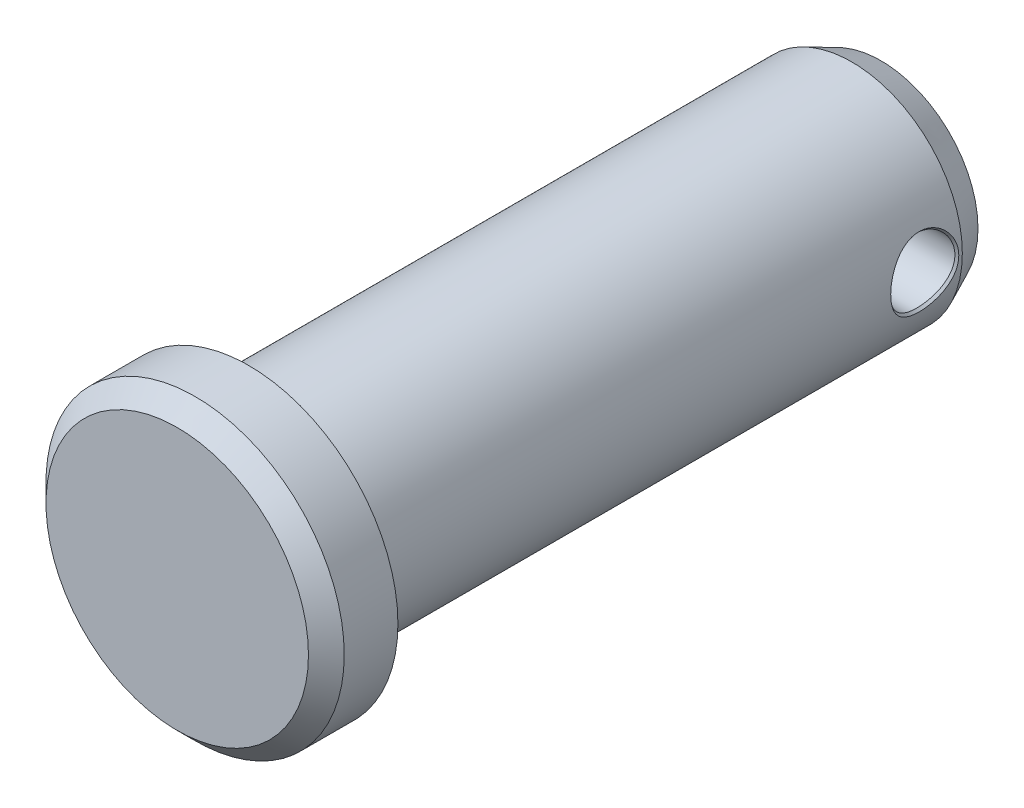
ISO-10303-21;
HEADER;
FILE_DESCRIPTION(('STEP AP214'),'2;1');
FILE_NAME('part.step','',(''),(''),'','','');
FILE_SCHEMA(('AUTOMOTIVE_DESIGN { 1 0 10303 214 1 1 1 1 }'));
ENDSEC;
DATA;
#1=APPLICATION_CONTEXT('core data for automotive mechanical design processes');
#2=APPLICATION_PROTOCOL_DEFINITION('international standard','automotive_design',2000,#1);
#3=PRODUCT_CONTEXT('',#1,'mechanical');
#4=PRODUCT('Part','Part','',(#3));
#5=PRODUCT_RELATED_PRODUCT_CATEGORY('part','',(#4));
#6=PRODUCT_DEFINITION_FORMATION('','',#4);
#7=PRODUCT_DEFINITION_CONTEXT('part definition',#1,'design');
#8=PRODUCT_DEFINITION('design','',#6,#7);
#9=PRODUCT_DEFINITION_SHAPE('','',#8);
#10=(LENGTH_UNIT() NAMED_UNIT(*) SI_UNIT(.MILLI.,.METRE.));
#11=(NAMED_UNIT(*) PLANE_ANGLE_UNIT() SI_UNIT($,.RADIAN.));
#12=(NAMED_UNIT(*) SI_UNIT($,.STERADIAN.) SOLID_ANGLE_UNIT());
#13=UNCERTAINTY_MEASURE_WITH_UNIT(LENGTH_MEASURE(1.E-05),#10,'distance_accuracy_value','');
#14=(GEOMETRIC_REPRESENTATION_CONTEXT(3) GLOBAL_UNCERTAINTY_ASSIGNED_CONTEXT((#13)) GLOBAL_UNIT_ASSIGNED_CONTEXT((#10,
#11,#12)) REPRESENTATION_CONTEXT('',''));
#15=CARTESIAN_POINT('',(0.,0.,0.));
#16=DIRECTION('',(0.,0.,1.));
#17=DIRECTION('',(1.,0.,0.));
#18=AXIS2_PLACEMENT_3D('',#15,#16,#17);
#19=CARTESIAN_POINT('',(0.,0.,0.));
#20=DIRECTION('',(0.,0.,-1.));
#21=DIRECTION('',(-1.,0.,0.));
#22=AXIS2_PLACEMENT_3D('',#19,#20,#21);
#23=PLANE('',#22);
#24=CARTESIAN_POINT('',(0.,0.,0.));
#25=DIRECTION('',(0.,0.,1.));
#26=DIRECTION('',(1.,0.,0.));
#27=AXIS2_PLACEMENT_3D('',#24,#25,#26);
#28=CIRCLE('',#27,5.58799999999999);
#29=CARTESIAN_POINT('',(5.58799999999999,0.,0.));
#30=VERTEX_POINT('',#29);
#31=EDGE_CURVE('E57',#30,#30,#28,.T.);
#32=ORIENTED_EDGE('',*,*,#31,.T.);
#33=EDGE_LOOP('',(#32));
#34=FACE_BOUND('',#33,.T.);
#35=ADVANCED_FACE('F30',(#34),#23,.F.);
#36=CARTESIAN_POINT('',(0.,0.,-0.762000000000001));
#37=DIRECTION('',(0.,0.,-1.));
#38=DIRECTION('',(-1.,0.,0.));
#39=AXIS2_PLACEMENT_3D('',#36,#37,#38);
#40=CONICAL_SURFACE('',#39,6.34999999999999,0.785398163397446);
#41=ORIENTED_EDGE('',*,*,#31,.F.);
#42=EDGE_LOOP('',(#41));
#43=FACE_BOUND('',#42,.T.);
#44=CARTESIAN_POINT('',(0.,0.,-0.762000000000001));
#45=DIRECTION('',(0.,0.,1.));
#46=DIRECTION('',(1.,0.,0.));
#47=AXIS2_PLACEMENT_3D('',#44,#45,#46);
#48=CIRCLE('',#47,6.34999999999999);
#49=CARTESIAN_POINT('',(6.34999999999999,0.,-0.762000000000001));
#50=VERTEX_POINT('',#49);
#51=EDGE_CURVE('E62',#50,#50,#48,.T.);
#52=ORIENTED_EDGE('',*,*,#51,.T.);
#53=EDGE_LOOP('',(#52));
#54=FACE_BOUND('',#53,.T.);
#55=ADVANCED_FACE('F167',(#43,#54),#40,.T.);
#56=CARTESIAN_POINT('',(0.,0.,0.));
#57=DIRECTION('',(0.,0.,1.));
#58=DIRECTION('',(1.,0.,0.));
#59=AXIS2_PLACEMENT_3D('',#56,#57,#58);
#60=CYLINDRICAL_SURFACE('',#59,6.34999999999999);
#61=ORIENTED_EDGE('',*,*,#51,.F.);
#62=EDGE_LOOP('',(#61));
#63=FACE_BOUND('',#62,.T.);
#64=CARTESIAN_POINT('',(0.,0.,-3.048));
#65=DIRECTION('',(0.,0.,1.));
#66=DIRECTION('',(1.,0.,0.));
#67=AXIS2_PLACEMENT_3D('',#64,#65,#66);
#68=CIRCLE('',#67,6.34999999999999);
#69=CARTESIAN_POINT('',(6.34999999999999,0.,-3.048));
#70=VERTEX_POINT('',#69);
#71=EDGE_CURVE('E67',#70,#70,#68,.T.);
#72=ORIENTED_EDGE('',*,*,#71,.T.);
#73=EDGE_LOOP('',(#72));
#74=FACE_BOUND('',#73,.T.);
#75=ADVANCED_FACE('F171',(#63,#74),#60,.T.);
#76=CARTESIAN_POINT('',(0.,6.34999999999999,-3.048));
#77=DIRECTION('',(0.,0.,1.));
#78=DIRECTION('',(1.,0.,0.));
#79=AXIS2_PLACEMENT_3D('',#76,#77,#78);
#80=PLANE('',#79);
#81=ORIENTED_EDGE('',*,*,#71,.F.);
#82=EDGE_LOOP('',(#81));
#83=FACE_BOUND('',#82,.T.);
#84=CARTESIAN_POINT('',(0.,0.,-3.048));
#85=DIRECTION('',(0.,0.,1.));
#86=DIRECTION('',(1.,0.,0.));
#87=AXIS2_PLACEMENT_3D('',#84,#85,#86);
#88=CIRCLE('',#87,4.95934999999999);
#89=CARTESIAN_POINT('',(4.95934999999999,0.,-3.048));
#90=VERTEX_POINT('',#89);
#91=EDGE_CURVE('E191',#90,#90,#88,.T.);
#92=ORIENTED_EDGE('',*,*,#91,.T.);
#93=EDGE_LOOP('',(#92));
#94=FACE_BOUND('',#93,.T.);
#95=ADVANCED_FACE('F176',(#83,#94),#80,.F.);
#96=CARTESIAN_POINT('',(0.,0.,-3.302));
#97=DIRECTION('',(0.,0.,1.));
#98=DIRECTION('',(1.,0.,0.));
#99=AXIS2_PLACEMENT_3D('',#96,#97,#98);
#100=TOROIDAL_SURFACE('',#99,4.95934999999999,0.253999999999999);
#101=ORIENTED_EDGE('',*,*,#91,.F.);
#102=EDGE_LOOP('',(#101));
#103=FACE_BOUND('',#102,.T.);
#104=CARTESIAN_POINT('',(0.,0.,-3.302));
#105=DIRECTION('',(0.,0.,1.));
#106=DIRECTION('',(1.,0.,0.));
#107=AXIS2_PLACEMENT_3D('',#104,#105,#106);
#108=CIRCLE('',#107,4.70534999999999);
#109=CARTESIAN_POINT('',(4.70534999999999,0.,-3.302));
#110=VERTEX_POINT('',#109);
#111=EDGE_CURVE('E192',#110,#110,#108,.T.);
#112=ORIENTED_EDGE('',*,*,#111,.T.);
#113=EDGE_LOOP('',(#112));
#114=FACE_BOUND('',#113,.T.);
#115=ADVANCED_FACE('F86',(#103,#114),#100,.F.);
#116=CARTESIAN_POINT('',(0.,0.,0.));
#117=DIRECTION('',(0.,0.,1.));
#118=DIRECTION('',(1.,0.,0.));
#119=AXIS2_PLACEMENT_3D('',#116,#117,#118);
#120=CYLINDRICAL_SURFACE('',#119,4.70534999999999);
#121=CARTESIAN_POINT('',(-4.70534999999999,0.,-28.5758308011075));
#122=CARTESIAN_POINT('',(-4.70534974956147,-0.0245062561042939,-28.5758300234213));
#123=CARTESIAN_POINT('',(-4.70515842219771,-0.0489358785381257,-28.5752354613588));
#124=CARTESIAN_POINT('',(-4.70440083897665,-0.097587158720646,-28.5728773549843));
#125=CARTESIAN_POINT('',(-4.70383482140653,-0.121818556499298,-28.5711145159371));
#126=CARTESIAN_POINT('',(-4.70158748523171,-0.19423375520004,-28.5640962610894));
#127=CARTESIAN_POINT('',(-4.69935692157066,-0.24213911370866,-28.5571148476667));
#128=CARTESIAN_POINT('',(-4.69495889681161,-0.313443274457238,-28.5431972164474));
#129=CARTESIAN_POINT('',(-4.69331747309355,-0.337118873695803,-28.5379828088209));
#130=CARTESIAN_POINT('',(-4.68969124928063,-0.384283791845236,-28.5263920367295));
#131=CARTESIAN_POINT('',(-4.6877062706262,-0.407773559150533,-28.5200151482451));
#132=CARTESIAN_POINT('',(-4.68447730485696,-0.442865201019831,-28.509564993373));
#133=CARTESIAN_POINT('',(-4.68335724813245,-0.454554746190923,-28.505928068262));
#134=CARTESIAN_POINT('',(-4.68104346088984,-0.47779382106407,-28.4983858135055));
#135=CARTESIAN_POINT('',(-4.67985053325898,-0.489337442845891,-28.4944831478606));
#136=CARTESIAN_POINT('',(-4.67616936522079,-0.523726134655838,-28.4823898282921));
#137=CARTESIAN_POINT('',(-4.67357467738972,-0.546375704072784,-28.4738009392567));
#138=CARTESIAN_POINT('',(-4.66541534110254,-0.613384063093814,-28.4465254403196));
#139=CARTESIAN_POINT('',(-4.65946486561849,-0.656919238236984,-28.4262993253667));
#140=CARTESIAN_POINT('',(-4.64990929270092,-0.720500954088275,-28.3929671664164));
#141=CARTESIAN_POINT('',(-4.64661869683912,-0.74141096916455,-28.3813556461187));
#142=CARTESIAN_POINT('',(-4.6398482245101,-0.782664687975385,-28.3571278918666));
#143=CARTESIAN_POINT('',(-4.63636831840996,-0.803008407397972,-28.3445116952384));
#144=CARTESIAN_POINT('',(-4.62924083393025,-0.843126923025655,-28.3182638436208));
#145=CARTESIAN_POINT('',(-4.62559324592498,-0.862901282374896,-28.3046320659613));
#146=CARTESIAN_POINT('',(-4.62001270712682,-0.892132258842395,-28.2834090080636));
#147=CARTESIAN_POINT('',(-4.61813192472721,-0.901815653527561,-28.2761956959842));
#148=CARTESIAN_POINT('',(-4.61435207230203,-0.920960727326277,-28.2615663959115));
#149=CARTESIAN_POINT('',(-4.61245369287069,-0.930420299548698,-28.2541535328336));
#150=CARTESIAN_POINT('',(-4.6029246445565,-0.977166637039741,-28.2165856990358));
#151=CARTESIAN_POINT('',(-4.59518760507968,-1.01280835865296,-28.1849524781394));
#152=CARTESIAN_POINT('',(-4.5797001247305,-1.08068385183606,-28.1185767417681));
#153=CARTESIAN_POINT('',(-4.57194926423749,-1.11291928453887,-28.0838357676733));
#154=CARTESIAN_POINT('',(-4.560474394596,-1.15872332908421,-28.0293641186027));
#155=CARTESIAN_POINT('',(-4.55667464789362,-1.17356576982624,-28.0108128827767));
#156=CARTESIAN_POINT('',(-4.5491536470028,-1.20238994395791,-27.9729076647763));
#157=CARTESIAN_POINT('',(-4.54543432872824,-1.21636446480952,-27.953564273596));
#158=CARTESIAN_POINT('',(-4.53809535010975,-1.24346542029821,-27.9140114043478));
#159=CARTESIAN_POINT('',(-4.53450208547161,-1.25649409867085,-27.8939411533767));
#160=CARTESIAN_POINT('',(-4.52751319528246,-1.28144867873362,-27.8533366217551));
#161=CARTESIAN_POINT('',(-4.52411333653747,-1.29339011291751,-27.8327796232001));
#162=CARTESIAN_POINT('',(-4.51423559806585,-1.32761433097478,-27.7703655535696));
#163=CARTESIAN_POINT('',(-4.5080771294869,-1.34830851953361,-27.7277556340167));
#164=CARTESIAN_POINT('',(-4.49962036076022,-1.37616474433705,-27.6623262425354));
#165=CARTESIAN_POINT('',(-4.4969315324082,-1.38491855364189,-27.6402633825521));
#166=CARTESIAN_POINT('',(-4.4918380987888,-1.40135045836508,-27.5956228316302));
#167=CARTESIAN_POINT('',(-4.48943256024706,-1.40903144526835,-27.5730336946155));
#168=CARTESIAN_POINT('',(-4.48493401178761,-1.42328547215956,-27.5273739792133));
#169=CARTESIAN_POINT('',(-4.48283228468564,-1.42988562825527,-27.5041920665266));
#170=CARTESIAN_POINT('',(-4.47900100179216,-1.44184183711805,-27.4577554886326));
#171=CARTESIAN_POINT('',(-4.47726674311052,-1.44721328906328,-27.4344701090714));
#172=CARTESIAN_POINT('',(-4.47416991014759,-1.45675921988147,-27.3877652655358));
#173=CARTESIAN_POINT('',(-4.47280717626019,-1.46093421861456,-27.3643460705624));
#174=CARTESIAN_POINT('',(-4.47046070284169,-1.46809875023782,-27.3173749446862));
#175=CARTESIAN_POINT('',(-4.46947696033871,-1.47108826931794,-27.2938230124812));
#176=CARTESIAN_POINT('',(-4.46789579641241,-1.475883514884,-27.2465863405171));
#177=CARTESIAN_POINT('',(-4.46729837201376,-1.47768924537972,-27.2229016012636));
#178=CARTESIAN_POINT('',(-4.46649692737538,-1.48010994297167,-27.1753983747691));
#179=CARTESIAN_POINT('',(-4.46629290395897,-1.48072493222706,-27.1515798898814));
#180=CARTESIAN_POINT('',(-4.46628515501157,-1.48074830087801,-27.103807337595));
#181=CARTESIAN_POINT('',(-4.46648135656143,-1.48015692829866,-27.0798629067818));
#182=CARTESIAN_POINT('',(-4.46708116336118,-1.47834532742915,-27.0438135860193));
#183=CARTESIAN_POINT('',(-4.46733232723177,-1.47758634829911,-27.0317777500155));
#184=CARTESIAN_POINT('',(-4.46793288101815,-1.47576939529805,-27.0078192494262));
#185=CARTESIAN_POINT('',(-4.46828241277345,-1.47471097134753,-26.9958698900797));
#186=CARTESIAN_POINT('',(-4.47027381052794,-1.46867179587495,-26.9363469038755));
#187=CARTESIAN_POINT('',(-4.47263958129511,-1.46147646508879,-26.8893114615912));
#188=CARTESIAN_POINT('',(-4.4787996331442,-1.44248814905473,-26.7964145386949));
#189=CARTESIAN_POINT('',(-4.4825933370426,-1.43069707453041,-26.7505448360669));
#190=CARTESIAN_POINT('',(-4.48926393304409,-1.40956814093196,-26.6826011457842));
#191=CARTESIAN_POINT('',(-4.49165082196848,-1.40195050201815,-26.6600969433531));
#192=CARTESIAN_POINT('',(-4.49673598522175,-1.3855532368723,-26.6153777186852));
#193=CARTESIAN_POINT('',(-4.49943240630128,-1.37677977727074,-26.5931772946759));
#194=CARTESIAN_POINT('',(-4.50512850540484,-1.3580250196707,-26.5490109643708));
#195=CARTESIAN_POINT('',(-4.50810936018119,-1.34810477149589,-26.5271964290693));
#196=CARTESIAN_POINT('',(-4.51427935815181,-1.32729731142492,-26.4843037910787));
#197=CARTESIAN_POINT('',(-4.51747422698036,-1.31639126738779,-26.4631813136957));
#198=CARTESIAN_POINT('',(-4.52734113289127,-1.28221028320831,-26.4008039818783));
#199=CARTESIAN_POINT('',(-4.5342990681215,-1.25746376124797,-26.3605089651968));
#200=CARTESIAN_POINT('',(-4.54514526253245,-1.21744159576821,-26.3019647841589));
#201=CARTESIAN_POINT('',(-4.54882908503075,-1.20361599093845,-26.2827664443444));
#202=CARTESIAN_POINT('',(-4.55630759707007,-1.17498874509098,-26.245002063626));
#203=CARTESIAN_POINT('',(-4.56010231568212,-1.16018714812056,-26.2264359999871));
#204=CARTESIAN_POINT('',(-4.56777675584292,-1.12959409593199,-26.1899404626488));
#205=CARTESIAN_POINT('',(-4.57165434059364,-1.11381157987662,-26.1720206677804));
#206=CARTESIAN_POINT('',(-4.57947691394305,-1.08119895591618,-26.1367883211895));
#207=CARTESIAN_POINT('',(-4.58339489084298,-1.06448043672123,-26.1195972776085));
#208=CARTESIAN_POINT('',(-4.59508416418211,-1.01328244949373,-26.0694735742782));
#209=CARTESIAN_POINT('',(-4.60281753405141,-0.977661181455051,-26.0378525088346));
#210=CARTESIAN_POINT('',(-4.61794434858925,-0.903515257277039,-25.9781842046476));
#211=CARTESIAN_POINT('',(-4.62534130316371,-0.864978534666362,-25.950122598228));
#212=CARTESIAN_POINT('',(-4.63603088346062,-0.804953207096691,-25.9107188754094));
#213=CARTESIAN_POINT('',(-4.63952811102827,-0.784563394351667,-25.8980275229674));
#214=CARTESIAN_POINT('',(-4.644651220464,-0.753421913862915,-25.8796805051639));
#215=CARTESIAN_POINT('',(-4.64633978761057,-0.742939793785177,-25.8736752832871));
#216=CARTESIAN_POINT('',(-4.64967140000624,-0.72179584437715,-25.8619018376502));
#217=CARTESIAN_POINT('',(-4.65131764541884,-0.711112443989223,-25.8561224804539));
#218=CARTESIAN_POINT('',(-4.65616572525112,-0.678903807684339,-25.8392045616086));
#219=CARTESIAN_POINT('',(-4.65927584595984,-0.657233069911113,-25.8284885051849));
#220=CARTESIAN_POINT('',(-4.66524199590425,-0.613452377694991,-25.8081398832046));
#221=CARTESIAN_POINT('',(-4.6680969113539,-0.591350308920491,-25.7985112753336));
#222=CARTESIAN_POINT('',(-4.67625190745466,-0.524411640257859,-25.7712478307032));
#223=CARTESIAN_POINT('',(-4.68114253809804,-0.478943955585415,-25.7552316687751));
#224=CARTESIAN_POINT('',(-4.68755794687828,-0.409463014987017,-25.7344629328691));
#225=CARTESIAN_POINT('',(-4.68954301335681,-0.386089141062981,-25.7280835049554));
#226=CARTESIAN_POINT('',(-4.69318874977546,-0.338906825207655,-25.716427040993));
#227=CARTESIAN_POINT('',(-4.69484937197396,-0.315097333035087,-25.7111501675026));
#228=CARTESIAN_POINT('',(-4.69708355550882,-0.279052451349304,-25.7040788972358));
#229=CARTESIAN_POINT('',(-4.69778617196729,-0.266965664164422,-25.7018603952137));
#230=CARTESIAN_POINT('',(-4.69909877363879,-0.242767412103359,-25.6977234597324));
#231=CARTESIAN_POINT('',(-4.69970840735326,-0.230666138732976,-25.6958061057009));
#232=CARTESIAN_POINT('',(-4.70139600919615,-0.194369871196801,-25.6905065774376));
#233=CARTESIAN_POINT('',(-4.70233573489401,-0.170137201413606,-25.687567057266));
#234=CARTESIAN_POINT('',(-4.70458954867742,-0.097471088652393,-25.680528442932));
#235=CARTESIAN_POINT('',(-4.70534587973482,-0.0489507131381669,-25.6781819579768));
#236=CARTESIAN_POINT('',(-4.70535203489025,0.0238784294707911,-25.6781628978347));
#237=CARTESIAN_POINT('',(-4.7051662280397,0.0481665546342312,-25.6787402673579));
#238=CARTESIAN_POINT('',(-4.70441765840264,0.0967664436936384,-25.6810702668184));
#239=CARTESIAN_POINT('',(-4.70385484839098,0.12107927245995,-25.6828229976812));
#240=CARTESIAN_POINT('',(-4.70235095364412,0.169724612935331,-25.6875194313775));
#241=CARTESIAN_POINT('',(-4.70140889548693,0.194077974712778,-25.6904661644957));
#242=CARTESIAN_POINT('',(-4.6991480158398,0.242733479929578,-25.697565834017));
#243=CARTESIAN_POINT('',(-4.69783924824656,0.266831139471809,-25.7016872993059));
#244=CARTESIAN_POINT('',(-4.69487890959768,0.314649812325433,-25.7110564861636));
#245=CARTESIAN_POINT('',(-4.69322790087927,0.338358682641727,-25.716302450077));
#246=CARTESIAN_POINT('',(-4.68960068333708,0.38538315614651,-25.7278985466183));
#247=CARTESIAN_POINT('',(-4.68762445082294,0.408698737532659,-25.734248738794));
#248=CARTESIAN_POINT('',(-4.68123181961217,0.478062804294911,-25.7549404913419));
#249=CARTESIAN_POINT('',(-4.67634982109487,0.523540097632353,-25.7709248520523));
#250=CARTESIAN_POINT('',(-4.66819649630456,0.590565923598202,-25.7981762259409));
#251=CARTESIAN_POINT('',(-4.665336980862,0.612731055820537,-25.8078182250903));
#252=CARTESIAN_POINT('',(-4.66085469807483,0.645658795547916,-25.8231024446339));
#253=CARTESIAN_POINT('',(-4.65932682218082,0.656591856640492,-25.8283397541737));
#254=CARTESIAN_POINT('',(-4.65620812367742,0.678355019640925,-25.8390929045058));
#255=CARTESIAN_POINT('',(-4.65461650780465,0.689189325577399,-25.8446116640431));
#256=CARTESIAN_POINT('',(-4.64977627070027,0.72136593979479,-25.8614994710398));
#257=CARTESIAN_POINT('',(-4.64645516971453,0.742437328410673,-25.8732237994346));
#258=CARTESIAN_POINT('',(-4.63964934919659,0.783844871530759,-25.8975898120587));
#259=CARTESIAN_POINT('',(-4.63616480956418,0.804180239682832,-25.9102307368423));
#260=CARTESIAN_POINT('',(-4.6255046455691,0.864101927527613,-25.9495097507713));
#261=CARTESIAN_POINT('',(-4.61812220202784,0.90260617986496,-25.977500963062));
#262=CARTESIAN_POINT('',(-4.60678562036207,0.958229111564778,-26.0221914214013));
#263=CARTESIAN_POINT('',(-4.60296287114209,0.976413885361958,-26.0375396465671));
#264=CARTESIAN_POINT('',(-4.59525511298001,1.01206804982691,-26.0691490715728));
#265=CARTESIAN_POINT('',(-4.59136828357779,1.02954484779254,-26.0854183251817));
#266=CARTESIAN_POINT('',(-4.58356558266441,1.06374515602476,-26.1188547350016));
#267=CARTESIAN_POINT('',(-4.57963248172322,1.08053966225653,-26.1361003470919));
#268=CARTESIAN_POINT('',(-4.57182907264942,1.11309337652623,-26.1712215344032));
#269=CARTESIAN_POINT('',(-4.5679545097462,1.12887505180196,-26.1891118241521));
#270=CARTESIAN_POINT('',(-4.56028532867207,1.1594675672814,-26.2255497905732));
#271=CARTESIAN_POINT('',(-4.55649082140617,1.17427823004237,-26.2440965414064));
#272=CARTESIAN_POINT('',(-4.54900820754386,1.20293903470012,-26.2818431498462));
#273=CARTESIAN_POINT('',(-4.54532008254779,1.21678916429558,-26.3010430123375));
#274=CARTESIAN_POINT('',(-4.53807655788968,1.243531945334,-26.3400984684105));
#275=CARTESIAN_POINT('',(-4.53452113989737,1.25642460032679,-26.3599540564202));
#276=CARTESIAN_POINT('',(-4.52756980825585,1.28124798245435,-26.4003286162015));
#277=CARTESIAN_POINT('',(-4.52417387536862,1.29317872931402,-26.4208475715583));
#278=CARTESIAN_POINT('',(-4.51756907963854,1.31606614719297,-26.4625617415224));
#279=CARTESIAN_POINT('',(-4.51436113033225,1.32701966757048,-26.4837510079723));
#280=CARTESIAN_POINT('',(-4.50970823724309,1.34271369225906,-26.5160737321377));
#281=CARTESIAN_POINT('',(-4.50818362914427,1.34782262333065,-26.5269408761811));
#282=CARTESIAN_POINT('',(-4.50520786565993,1.35773614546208,-26.5487334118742));
#283=CARTESIAN_POINT('',(-4.50375378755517,1.36255079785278,-26.5596775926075));
#284=CARTESIAN_POINT('',(-4.49666726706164,1.38588635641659,-26.6145889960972));
#285=CARTESIAN_POINT('',(-4.49156911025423,1.40226398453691,-26.6592034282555));
#286=CARTESIAN_POINT('',(-4.48266167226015,1.43048315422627,-26.7497683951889));
#287=CARTESIAN_POINT('',(-4.47885059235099,1.44233037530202,-26.7957323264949));
#288=CARTESIAN_POINT('',(-4.47420366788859,1.45665551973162,-26.865681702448));
#289=CARTESIAN_POINT('',(-4.47283229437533,1.46085740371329,-26.8891857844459));
#290=CARTESIAN_POINT('',(-4.47105662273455,1.46627927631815,-26.9246790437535));
#291=CARTESIAN_POINT('',(-4.47051123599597,1.46794088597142,-26.9365622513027));
#292=CARTESIAN_POINT('',(-4.46951659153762,1.4709665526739,-26.9604047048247));
#293=CARTESIAN_POINT('',(-4.46906683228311,1.47233212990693,-26.9723832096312));
#294=CARTESIAN_POINT('',(-4.46787082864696,1.4759591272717,-27.0082550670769));
#295=CARTESIAN_POINT('',(-4.46727503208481,1.47775978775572,-27.0321235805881));
#296=CARTESIAN_POINT('',(-4.46648308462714,1.48015170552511,-27.0797974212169));
#297=CARTESIAN_POINT('',(-4.46628697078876,1.48074278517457,-27.1035981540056));
#298=CARTESIAN_POINT('',(-4.46629302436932,1.48072464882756,-27.1748931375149));
#299=CARTESIAN_POINT('',(-4.46708974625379,1.47832788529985,-27.2222803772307));
#300=CARTESIAN_POINT('',(-4.46945067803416,1.47116805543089,-27.2931481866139));
#301=CARTESIAN_POINT('',(-4.47043193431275,1.46818635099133,-27.3167352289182));
#302=CARTESIAN_POINT('',(-4.47277866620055,1.46102150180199,-27.3638376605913));
#303=CARTESIAN_POINT('',(-4.47414494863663,1.45683589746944,-27.3873614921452));
#304=CARTESIAN_POINT('',(-4.47725385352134,1.44725328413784,-27.4343027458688));
#305=CARTESIAN_POINT('',(-4.47900538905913,1.44182827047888,-27.4578155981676));
#306=CARTESIAN_POINT('',(-4.48283232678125,1.42988537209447,-27.5041856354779));
#307=CARTESIAN_POINT('',(-4.48491305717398,1.42335119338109,-27.5271397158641));
#308=CARTESIAN_POINT('',(-4.48938262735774,1.40919032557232,-27.5725480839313));
#309=CARTESIAN_POINT('',(-4.49177193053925,1.40156222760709,-27.5950108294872));
#310=CARTESIAN_POINT('',(-4.49683661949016,1.38522639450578,-27.6394626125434));
#311=CARTESIAN_POINT('',(-4.49951201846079,1.37651863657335,-27.6614516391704));
#312=CARTESIAN_POINT('',(-4.50512649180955,1.35803064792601,-27.704961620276));
#313=CARTESIAN_POINT('',(-4.50806557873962,1.3482504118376,-27.7264825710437));
#314=CARTESIAN_POINT('',(-4.51418531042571,1.32761643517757,-27.7690586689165));
#315=CARTESIAN_POINT('',(-4.51736596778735,1.31676270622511,-27.7901138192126));
#316=CARTESIAN_POINT('',(-4.52394678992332,1.29397245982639,-27.8317572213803));
#317=CARTESIAN_POINT('',(-4.5273482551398,1.28203110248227,-27.8523520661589));
#318=CARTESIAN_POINT('',(-4.53434333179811,1.25706717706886,-27.8930439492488));
#319=CARTESIAN_POINT('',(-4.53795131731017,1.24399043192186,-27.9132150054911));
#320=CARTESIAN_POINT('',(-4.54525718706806,1.21702516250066,-27.9526288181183));
#321=CARTESIAN_POINT('',(-4.54896758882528,1.20309304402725,-27.9719485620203));
#322=CARTESIAN_POINT('',(-4.55646812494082,1.1743667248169,-28.0097923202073));
#323=CARTESIAN_POINT('',(-4.56025937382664,1.15956873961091,-28.0283229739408));
#324=CARTESIAN_POINT('',(-4.57171437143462,1.11388157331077,-28.0827598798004));
#325=CARTESIAN_POINT('',(-4.57945950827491,1.08170221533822,-28.1175137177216));
#326=CARTESIAN_POINT('',(-4.59107849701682,1.03083420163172,-28.1673569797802));
#327=CARTESIAN_POINT('',(-4.59495181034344,1.01344428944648,-28.1835894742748));
#328=CARTESIAN_POINT('',(-4.60267217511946,0.977783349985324,-28.2152845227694));
#329=CARTESIAN_POINT('',(-4.60651858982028,0.959515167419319,-28.2307442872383));
#330=CARTESIAN_POINT('',(-4.61416066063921,0.922066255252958,-28.2608930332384));
#331=CARTESIAN_POINT('',(-4.61795594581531,0.902880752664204,-28.2755780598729));
#332=CARTESIAN_POINT('',(-4.62538099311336,0.864036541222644,-28.3038333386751));
#333=CARTESIAN_POINT('',(-4.62902832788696,0.844292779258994,-28.3174732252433));
#334=CARTESIAN_POINT('',(-4.63971571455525,0.784224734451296,-28.3568542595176));
#335=CARTESIAN_POINT('',(-4.64652057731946,0.742971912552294,-28.381136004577));
#336=CARTESIAN_POINT('',(-4.65929896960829,0.658098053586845,-28.4257308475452));
#337=CARTESIAN_POINT('',(-4.66527604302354,0.614450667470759,-28.4460550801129));
#338=CARTESIAN_POINT('',(-4.67348205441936,0.547174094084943,-28.4734936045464));
#339=CARTESIAN_POINT('',(-4.67609383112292,0.52440650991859,-28.4821406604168));
#340=CARTESIAN_POINT('',(-4.68103245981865,0.478320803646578,-28.4983669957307));
#341=CARTESIAN_POINT('',(-4.68334052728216,0.455177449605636,-28.5058848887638));
#342=CARTESIAN_POINT('',(-4.68763163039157,0.408625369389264,-28.519774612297));
#343=CARTESIAN_POINT('',(-4.68961346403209,0.385227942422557,-28.5261424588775));
#344=CARTESIAN_POINT('',(-4.69323994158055,0.338192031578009,-28.5377358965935));
#345=CARTESIAN_POINT('',(-4.69488459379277,0.314553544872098,-28.5429614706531));
#346=CARTESIAN_POINT('',(-4.69782686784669,0.267035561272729,-28.5522735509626));
#347=CARTESIAN_POINT('',(-4.69912449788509,0.243156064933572,-28.556360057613));
#348=CARTESIAN_POINT('',(-4.70136263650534,0.195154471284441,-28.5633888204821));
#349=CARTESIAN_POINT('',(-4.70230315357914,0.171032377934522,-28.5663310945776));
#350=CARTESIAN_POINT('',(-4.70381657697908,0.122542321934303,-28.5710576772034));
#351=CARTESIAN_POINT('',(-4.70438936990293,0.0981665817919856,-28.5728416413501));
#352=CARTESIAN_POINT('',(-4.7051567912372,0.0491953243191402,-28.5752303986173));
#353=CARTESIAN_POINT('',(-4.70535025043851,0.0245062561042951,-28.5758315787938));
#354=CARTESIAN_POINT('',(-4.70534999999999,0.,-28.5758308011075));
#355=B_SPLINE_CURVE_WITH_KNOTS('',3,(#121,#122,#123,#124,#125,#126,#127,#128,#129,#130,#131,
#132,#133,#134,#135,#136,#137,#138,#139,#140,#141,#142,#143,#144,#145,#146,#147,#148,#149,#150,
#151,#152,#153,#154,#155,#156,#157,#158,#159,#160,#161,#162,#163,#164,#165,#166,#167,#168,#169,
#170,#171,#172,#173,#174,#175,#176,#177,#178,#179,#180,#181,#182,#183,#184,#185,#186,#187,#188,
#189,#190,#191,#192,#193,#194,#195,#196,#197,#198,#199,#200,#201,#202,#203,#204,#205,#206,#207,
#208,#209,#210,#211,#212,#213,#214,#215,#216,#217,#218,#219,#220,#221,#222,#223,#224,#225,#226,
#227,#228,#229,#230,#231,#232,#233,#234,#235,#236,#237,#238,#239,#240,#241,#242,#243,#244,#245,
#246,#247,#248,#249,#250,#251,#252,#253,#254,#255,#256,#257,#258,#259,#260,#261,#262,#263,#264,
#265,#266,#267,#268,#269,#270,#271,#272,#273,#274,#275,#276,#277,#278,#279,#280,#281,#282,#283,
#284,#285,#286,#287,#288,#289,#290,#291,#292,#293,#294,#295,#296,#297,#298,#299,#300,#301,#302,
#303,#304,#305,#306,#307,#308,#309,#310,#311,#312,#313,#314,#315,#316,#317,#318,#319,#320,#321,
#322,#323,#324,#325,#326,#327,#328,#329,#330,#331,#332,#333,#334,#335,#336,#337,#338,#339,#340,
#341,#342,#343,#344,#345,#346,#347,#348,#349,#350,#351,#352,#353,#354),.UNSPECIFIED.,.T.,.F.,(4,
2,2,2,2,2,2,2,2,2,2,2,2,2,2,2,2,2,2,2,2,2,2,2,2,2,2,2,2,2,2,2,2,2,2,2,2,2,2,2,2,2,2,2,2,2,2,2,2,
2,2,2,2,2,2,2,2,2,2,2,2,2,2,2,2,2,2,2,2,2,2,2,2,2,2,2,2,2,2,2,2,2,2,2,2,2,2,2,2,2,2,2,2,2,2,2,2,
2,2,2,2,2,2,2,2,2,2,2,2,2,2,2,2,2,2,2,4),(0.000450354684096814,0.00052151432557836,
0.000592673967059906,0.000734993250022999,0.000806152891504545,0.000877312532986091,
0.000912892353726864,0.000948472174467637,0.00101963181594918,0.00116195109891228,
0.00123311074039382,0.00130427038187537,0.00137543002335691,0.00141100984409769,
0.00144658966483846,0.00158890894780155,0.00173122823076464,0.00180238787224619,
0.00187354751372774,0.00194470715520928,0.00201586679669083,0.00215818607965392,
0.00222934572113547,0.00230050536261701,0.00237166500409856,0.00244282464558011,
0.00251398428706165,0.0025851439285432,0.00265630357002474,0.00272746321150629,
0.00279862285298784,0.00283420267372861,0.00286978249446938,0.00301210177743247,
0.00315442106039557,0.00322558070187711,0.00329674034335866,0.0033678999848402,
0.00343905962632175,0.00358137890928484,0.00365253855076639,0.00372369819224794,
0.00379485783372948,0.00386601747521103,0.00400833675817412,0.00415065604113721,
0.00422181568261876,0.00425739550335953,0.0042929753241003,0.00436413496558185,
0.0044352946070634,0.00457761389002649,0.00464877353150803,0.00471993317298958,
0.00475551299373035,0.00479109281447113,0.00486225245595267,0.00500457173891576,
0.00507573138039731,0.00514689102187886,0.0052180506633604,0.00528921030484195,
0.0053603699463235,0.00543152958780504,0.00557384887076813,0.00564500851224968,
0.00568058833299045,0.00571616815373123,0.00578732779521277,0.00585848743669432,
0.00600080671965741,0.00607196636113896,0.0061431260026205,0.00621428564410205,
0.00628544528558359,0.00635660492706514,0.00642776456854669,0.00649892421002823,
0.00657008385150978,0.00664124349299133,0.0066768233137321,0.00671240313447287,
0.00685472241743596,0.00699704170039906,0.0070682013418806,0.00710378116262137,
0.00713936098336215,0.00721052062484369,0.00728168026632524,0.00742399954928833,
0.00749515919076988,0.00756631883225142,0.00763747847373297,0.00770863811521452,
0.00777979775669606,0.00785095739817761,0.00792211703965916,0.0079932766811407,
0.00806443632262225,0.00813559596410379,0.00820675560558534,0.00827791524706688,
0.00842023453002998,0.00849139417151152,0.00856255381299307,0.00863371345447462,
0.00870487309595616,0.00884719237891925,0.00898951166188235,0.00906067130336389,
0.00913183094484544,0.00920299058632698,0.00927415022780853,0.00934530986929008,
0.00941646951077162,0.00948762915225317,0.00955878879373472),.UNSPECIFIED.);
#356=CARTESIAN_POINT('',(-4.70534999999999,0.,-28.5758308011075));
#357=VERTEX_POINT('',#356);
#358=EDGE_CURVE('E47',#357,#357,#355,.F.);
#359=ORIENTED_EDGE('',*,*,#358,.T.);
#360=EDGE_LOOP('',(#359));
#361=FACE_BOUND('',#360,.T.);
#362=CARTESIAN_POINT('',(4.70534999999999,0.,-28.5758308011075));
#363=CARTESIAN_POINT('',(4.70534974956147,0.0245062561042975,-28.5758300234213));
#364=CARTESIAN_POINT('',(4.70515842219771,0.0489358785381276,-28.5752354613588));
#365=CARTESIAN_POINT('',(4.70440083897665,0.0975871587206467,-28.5728773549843));
#366=CARTESIAN_POINT('',(4.70383482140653,0.121818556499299,-28.5711145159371));
#367=CARTESIAN_POINT('',(4.70158748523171,0.194233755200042,-28.5640962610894));
#368=CARTESIAN_POINT('',(4.69935692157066,0.242139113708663,-28.5571148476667));
#369=CARTESIAN_POINT('',(4.69495889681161,0.313443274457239,-28.5431972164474));
#370=CARTESIAN_POINT('',(4.69331747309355,0.337118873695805,-28.5379828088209));
#371=CARTESIAN_POINT('',(4.68969124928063,0.384283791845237,-28.5263920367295));
#372=CARTESIAN_POINT('',(4.6877062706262,0.407773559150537,-28.5200151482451));
#373=CARTESIAN_POINT('',(4.68447730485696,0.442865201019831,-28.509564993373));
#374=CARTESIAN_POINT('',(4.68335724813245,0.454554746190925,-28.505928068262));
#375=CARTESIAN_POINT('',(4.68104346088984,0.477793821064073,-28.4983858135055));
#376=CARTESIAN_POINT('',(4.67985053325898,0.489337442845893,-28.4944831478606));
#377=CARTESIAN_POINT('',(4.67616936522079,0.523726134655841,-28.4823898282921));
#378=CARTESIAN_POINT('',(4.67357467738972,0.546375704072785,-28.4738009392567));
#379=CARTESIAN_POINT('',(4.66541534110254,0.613384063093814,-28.4465254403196));
#380=CARTESIAN_POINT('',(4.65946486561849,0.656919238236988,-28.4262993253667));
#381=CARTESIAN_POINT('',(4.64990929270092,0.720500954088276,-28.3929671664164));
#382=CARTESIAN_POINT('',(4.64661869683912,0.741410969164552,-28.3813556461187));
#383=CARTESIAN_POINT('',(4.6398482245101,0.782664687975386,-28.3571278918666));
#384=CARTESIAN_POINT('',(4.63636831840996,0.803008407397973,-28.3445116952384));
#385=CARTESIAN_POINT('',(4.62924083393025,0.843126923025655,-28.3182638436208));
#386=CARTESIAN_POINT('',(4.62559324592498,0.862901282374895,-28.3046320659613));
#387=CARTESIAN_POINT('',(4.62001270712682,0.892132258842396,-28.2834090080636));
#388=CARTESIAN_POINT('',(4.61813192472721,0.901815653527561,-28.2761956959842));
#389=CARTESIAN_POINT('',(4.61435207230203,0.920960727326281,-28.2615663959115));
#390=CARTESIAN_POINT('',(4.61245369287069,0.930420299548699,-28.2541535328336));
#391=CARTESIAN_POINT('',(4.6029246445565,0.977166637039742,-28.2165856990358));
#392=CARTESIAN_POINT('',(4.59518760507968,1.01280835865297,-28.1849524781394));
#393=CARTESIAN_POINT('',(4.5797001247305,1.08068385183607,-28.1185767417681));
#394=CARTESIAN_POINT('',(4.57194926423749,1.11291928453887,-28.0838357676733));
#395=CARTESIAN_POINT('',(4.560474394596,1.15872332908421,-28.0293641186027));
#396=CARTESIAN_POINT('',(4.55667464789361,1.17356576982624,-28.0108128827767));
#397=CARTESIAN_POINT('',(4.5491536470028,1.20238994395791,-27.9729076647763));
#398=CARTESIAN_POINT('',(4.54543432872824,1.21636446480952,-27.953564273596));
#399=CARTESIAN_POINT('',(4.53809535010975,1.24346542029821,-27.9140114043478));
#400=CARTESIAN_POINT('',(4.53450208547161,1.25649409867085,-27.8939411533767));
#401=CARTESIAN_POINT('',(4.52751319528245,1.28144867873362,-27.8533366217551));
#402=CARTESIAN_POINT('',(4.52411333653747,1.29339011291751,-27.8327796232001));
#403=CARTESIAN_POINT('',(4.51423559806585,1.32761433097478,-27.7703655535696));
#404=CARTESIAN_POINT('',(4.50807712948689,1.34830851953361,-27.7277556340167));
#405=CARTESIAN_POINT('',(4.49962036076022,1.37616474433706,-27.6623262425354));
#406=CARTESIAN_POINT('',(4.4969315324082,1.38491855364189,-27.6402633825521));
#407=CARTESIAN_POINT('',(4.4918380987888,1.40135045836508,-27.5956228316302));
#408=CARTESIAN_POINT('',(4.48943256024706,1.40903144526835,-27.5730336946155));
#409=CARTESIAN_POINT('',(4.48493401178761,1.42328547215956,-27.5273739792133));
#410=CARTESIAN_POINT('',(4.48283228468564,1.42988562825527,-27.5041920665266));
#411=CARTESIAN_POINT('',(4.47900100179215,1.44184183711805,-27.4577554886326));
#412=CARTESIAN_POINT('',(4.47726674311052,1.44721328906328,-27.4344701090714));
#413=CARTESIAN_POINT('',(4.47416991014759,1.45675921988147,-27.3877652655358));
#414=CARTESIAN_POINT('',(4.47280717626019,1.46093421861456,-27.3643460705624));
#415=CARTESIAN_POINT('',(4.47046070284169,1.46809875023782,-27.3173749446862));
#416=CARTESIAN_POINT('',(4.46947696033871,1.47108826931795,-27.2938230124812));
#417=CARTESIAN_POINT('',(4.46789579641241,1.475883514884,-27.2465863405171));
#418=CARTESIAN_POINT('',(4.46729837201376,1.47768924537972,-27.2229016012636));
#419=CARTESIAN_POINT('',(4.46649692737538,1.48010994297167,-27.1753983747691));
#420=CARTESIAN_POINT('',(4.46629290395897,1.48072493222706,-27.1515798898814));
#421=CARTESIAN_POINT('',(4.46628515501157,1.48074830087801,-27.103807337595));
#422=CARTESIAN_POINT('',(4.46648135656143,1.48015692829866,-27.0798629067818));
#423=CARTESIAN_POINT('',(4.46708116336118,1.47834532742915,-27.0438135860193));
#424=CARTESIAN_POINT('',(4.46733232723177,1.47758634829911,-27.0317777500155));
#425=CARTESIAN_POINT('',(4.46793288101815,1.47576939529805,-27.0078192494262));
#426=CARTESIAN_POINT('',(4.46828241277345,1.47471097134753,-26.9958698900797));
#427=CARTESIAN_POINT('',(4.47027381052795,1.46867179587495,-26.9363469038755));
#428=CARTESIAN_POINT('',(4.47263958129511,1.4614764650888,-26.8893114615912));
#429=CARTESIAN_POINT('',(4.4787996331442,1.44248814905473,-26.7964145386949));
#430=CARTESIAN_POINT('',(4.4825933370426,1.43069707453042,-26.7505448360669));
#431=CARTESIAN_POINT('',(4.48926393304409,1.40956814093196,-26.6826011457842));
#432=CARTESIAN_POINT('',(4.49165082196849,1.40195050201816,-26.6600969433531));
#433=CARTESIAN_POINT('',(4.49673598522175,1.3855532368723,-26.6153777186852));
#434=CARTESIAN_POINT('',(4.49943240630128,1.37677977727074,-26.5931772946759));
#435=CARTESIAN_POINT('',(4.50512850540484,1.3580250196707,-26.5490109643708));
#436=CARTESIAN_POINT('',(4.50810936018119,1.34810477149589,-26.5271964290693));
#437=CARTESIAN_POINT('',(4.51427935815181,1.32729731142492,-26.4843037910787));
#438=CARTESIAN_POINT('',(4.51747422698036,1.31639126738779,-26.4631813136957));
#439=CARTESIAN_POINT('',(4.52734113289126,1.28221028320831,-26.4008039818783));
#440=CARTESIAN_POINT('',(4.5342990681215,1.25746376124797,-26.3605089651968));
#441=CARTESIAN_POINT('',(4.54514526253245,1.21744159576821,-26.3019647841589));
#442=CARTESIAN_POINT('',(4.54882908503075,1.20361599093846,-26.2827664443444));
#443=CARTESIAN_POINT('',(4.55630759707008,1.17498874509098,-26.245002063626));
#444=CARTESIAN_POINT('',(4.56010231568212,1.16018714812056,-26.2264359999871));
#445=CARTESIAN_POINT('',(4.56777675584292,1.12959409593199,-26.1899404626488));
#446=CARTESIAN_POINT('',(4.57165434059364,1.11381157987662,-26.1720206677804));
#447=CARTESIAN_POINT('',(4.57947691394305,1.08119895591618,-26.1367883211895));
#448=CARTESIAN_POINT('',(4.58339489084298,1.06448043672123,-26.1195972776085));
#449=CARTESIAN_POINT('',(4.59508416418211,1.01328244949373,-26.0694735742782));
#450=CARTESIAN_POINT('',(4.60281753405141,0.977661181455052,-26.0378525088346));
#451=CARTESIAN_POINT('',(4.61794434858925,0.903515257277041,-25.9781842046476));
#452=CARTESIAN_POINT('',(4.62534130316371,0.864978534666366,-25.950122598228));
#453=CARTESIAN_POINT('',(4.63603088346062,0.804953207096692,-25.9107188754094));
#454=CARTESIAN_POINT('',(4.63952811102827,0.784563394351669,-25.8980275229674));
#455=CARTESIAN_POINT('',(4.644651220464,0.753421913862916,-25.8796805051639));
#456=CARTESIAN_POINT('',(4.64633978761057,0.742939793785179,-25.8736752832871));
#457=CARTESIAN_POINT('',(4.64967140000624,0.721795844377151,-25.8619018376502));
#458=CARTESIAN_POINT('',(4.65131764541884,0.711112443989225,-25.8561224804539));
#459=CARTESIAN_POINT('',(4.65616572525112,0.678903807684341,-25.8392045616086));
#460=CARTESIAN_POINT('',(4.65927584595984,0.657233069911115,-25.8284885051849));
#461=CARTESIAN_POINT('',(4.66524199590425,0.61345237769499,-25.8081398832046));
#462=CARTESIAN_POINT('',(4.6680969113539,0.591350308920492,-25.7985112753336));
#463=CARTESIAN_POINT('',(4.67625190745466,0.524411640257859,-25.7712478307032));
#464=CARTESIAN_POINT('',(4.68114253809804,0.478943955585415,-25.7552316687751));
#465=CARTESIAN_POINT('',(4.68755794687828,0.409463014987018,-25.7344629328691));
#466=CARTESIAN_POINT('',(4.68954301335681,0.386089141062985,-25.7280835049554));
#467=CARTESIAN_POINT('',(4.69318874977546,0.338906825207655,-25.716427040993));
#468=CARTESIAN_POINT('',(4.69484937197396,0.315097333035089,-25.7111501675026));
#469=CARTESIAN_POINT('',(4.69708355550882,0.279052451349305,-25.7040788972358));
#470=CARTESIAN_POINT('',(4.69778617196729,0.266965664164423,-25.7018603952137));
#471=CARTESIAN_POINT('',(4.69909877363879,0.24276741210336,-25.6977234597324));
#472=CARTESIAN_POINT('',(4.69970840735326,0.230666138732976,-25.6958061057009));
#473=CARTESIAN_POINT('',(4.70139600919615,0.194369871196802,-25.6905065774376));
#474=CARTESIAN_POINT('',(4.70233573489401,0.170137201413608,-25.687567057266));
#475=CARTESIAN_POINT('',(4.70458954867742,0.0974710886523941,-25.680528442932));
#476=CARTESIAN_POINT('',(4.70534587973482,0.0489507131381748,-25.6781819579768));
#477=CARTESIAN_POINT('',(4.70535203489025,-0.0238784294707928,-25.6781628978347));
#478=CARTESIAN_POINT('',(4.7051662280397,-0.0481665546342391,-25.6787402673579));
#479=CARTESIAN_POINT('',(4.70441765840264,-0.0967664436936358,-25.6810702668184));
#480=CARTESIAN_POINT('',(4.70385484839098,-0.121079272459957,-25.6828229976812));
#481=CARTESIAN_POINT('',(4.70235095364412,-0.169724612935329,-25.6875194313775));
#482=CARTESIAN_POINT('',(4.70140889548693,-0.194077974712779,-25.6904661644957));
#483=CARTESIAN_POINT('',(4.6991480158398,-0.242733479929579,-25.697565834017));
#484=CARTESIAN_POINT('',(4.69783924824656,-0.266831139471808,-25.7016872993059));
#485=CARTESIAN_POINT('',(4.69487890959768,-0.314649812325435,-25.7110564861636));
#486=CARTESIAN_POINT('',(4.69322790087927,-0.338358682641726,-25.716302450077));
#487=CARTESIAN_POINT('',(4.68960068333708,-0.385383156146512,-25.7278985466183));
#488=CARTESIAN_POINT('',(4.68762445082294,-0.408698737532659,-25.734248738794));
#489=CARTESIAN_POINT('',(4.68123181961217,-0.478062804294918,-25.7549404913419));
#490=CARTESIAN_POINT('',(4.67634982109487,-0.523540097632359,-25.7709248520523));
#491=CARTESIAN_POINT('',(4.66819649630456,-0.590565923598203,-25.7981762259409));
#492=CARTESIAN_POINT('',(4.665336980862,-0.612731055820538,-25.8078182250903));
#493=CARTESIAN_POINT('',(4.66085469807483,-0.645658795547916,-25.8231024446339));
#494=CARTESIAN_POINT('',(4.65932682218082,-0.656591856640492,-25.8283397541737));
#495=CARTESIAN_POINT('',(4.65620812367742,-0.678355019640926,-25.8390929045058));
#496=CARTESIAN_POINT('',(4.65461650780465,-0.689189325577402,-25.8446116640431));
#497=CARTESIAN_POINT('',(4.64977627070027,-0.721365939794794,-25.8614994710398));
#498=CARTESIAN_POINT('',(4.64645516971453,-0.742437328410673,-25.8732237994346));
#499=CARTESIAN_POINT('',(4.63964934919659,-0.78384487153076,-25.8975898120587));
#500=CARTESIAN_POINT('',(4.63616480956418,-0.804180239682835,-25.9102307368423));
#501=CARTESIAN_POINT('',(4.6255046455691,-0.864101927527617,-25.9495097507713));
#502=CARTESIAN_POINT('',(4.61812220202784,-0.902606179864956,-25.977500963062));
#503=CARTESIAN_POINT('',(4.60678562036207,-0.958229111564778,-26.0221914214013));
#504=CARTESIAN_POINT('',(4.60296287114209,-0.976413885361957,-26.0375396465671));
#505=CARTESIAN_POINT('',(4.59525511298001,-1.01206804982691,-26.0691490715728));
#506=CARTESIAN_POINT('',(4.59136828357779,-1.02954484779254,-26.0854183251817));
#507=CARTESIAN_POINT('',(4.58356558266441,-1.06374515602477,-26.1188547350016));
#508=CARTESIAN_POINT('',(4.57963248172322,-1.08053966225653,-26.1361003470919));
#509=CARTESIAN_POINT('',(4.57182907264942,-1.11309337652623,-26.1712215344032));
#510=CARTESIAN_POINT('',(4.5679545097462,-1.12887505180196,-26.1891118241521));
#511=CARTESIAN_POINT('',(4.56028532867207,-1.1594675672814,-26.2255497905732));
#512=CARTESIAN_POINT('',(4.55649082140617,-1.17427823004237,-26.2440965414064));
#513=CARTESIAN_POINT('',(4.54900820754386,-1.20293903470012,-26.2818431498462));
#514=CARTESIAN_POINT('',(4.54532008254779,-1.21678916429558,-26.3010430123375));
#515=CARTESIAN_POINT('',(4.53807655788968,-1.243531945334,-26.3400984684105));
#516=CARTESIAN_POINT('',(4.53452113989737,-1.25642460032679,-26.3599540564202));
#517=CARTESIAN_POINT('',(4.52756980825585,-1.28124798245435,-26.4003286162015));
#518=CARTESIAN_POINT('',(4.52417387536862,-1.29317872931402,-26.4208475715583));
#519=CARTESIAN_POINT('',(4.51756907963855,-1.31606614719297,-26.4625617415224));
#520=CARTESIAN_POINT('',(4.51436113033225,-1.32701966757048,-26.4837510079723));
#521=CARTESIAN_POINT('',(4.50970823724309,-1.34271369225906,-26.5160737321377));
#522=CARTESIAN_POINT('',(4.50818362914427,-1.34782262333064,-26.5269408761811));
#523=CARTESIAN_POINT('',(4.50520786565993,-1.35773614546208,-26.5487334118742));
#524=CARTESIAN_POINT('',(4.50375378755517,-1.36255079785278,-26.5596775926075));
#525=CARTESIAN_POINT('',(4.49666726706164,-1.3858863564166,-26.6145889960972));
#526=CARTESIAN_POINT('',(4.49156911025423,-1.40226398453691,-26.6592034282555));
#527=CARTESIAN_POINT('',(4.48266167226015,-1.43048315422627,-26.7497683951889));
#528=CARTESIAN_POINT('',(4.47885059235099,-1.44233037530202,-26.7957323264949));
#529=CARTESIAN_POINT('',(4.47420366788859,-1.45665551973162,-26.865681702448));
#530=CARTESIAN_POINT('',(4.47283229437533,-1.46085740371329,-26.8891857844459));
#531=CARTESIAN_POINT('',(4.47105662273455,-1.46627927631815,-26.9246790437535));
#532=CARTESIAN_POINT('',(4.47051123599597,-1.46794088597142,-26.9365622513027));
#533=CARTESIAN_POINT('',(4.46951659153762,-1.4709665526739,-26.9604047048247));
#534=CARTESIAN_POINT('',(4.46906683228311,-1.47233212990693,-26.9723832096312));
#535=CARTESIAN_POINT('',(4.46787082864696,-1.47595912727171,-27.0082550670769));
#536=CARTESIAN_POINT('',(4.46727503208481,-1.47775978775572,-27.0321235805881));
#537=CARTESIAN_POINT('',(4.46648308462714,-1.48015170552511,-27.0797974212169));
#538=CARTESIAN_POINT('',(4.46628697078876,-1.48074278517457,-27.1035981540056));
#539=CARTESIAN_POINT('',(4.46629302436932,-1.48072464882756,-27.1748931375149));
#540=CARTESIAN_POINT('',(4.46708974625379,-1.47832788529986,-27.2222803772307));
#541=CARTESIAN_POINT('',(4.46945067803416,-1.47116805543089,-27.2931481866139));
#542=CARTESIAN_POINT('',(4.47043193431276,-1.46818635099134,-27.3167352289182));
#543=CARTESIAN_POINT('',(4.47277866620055,-1.46102150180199,-27.3638376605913));
#544=CARTESIAN_POINT('',(4.47414494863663,-1.45683589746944,-27.3873614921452));
#545=CARTESIAN_POINT('',(4.47725385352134,-1.44725328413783,-27.4343027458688));
#546=CARTESIAN_POINT('',(4.47900538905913,-1.44182827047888,-27.4578155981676));
#547=CARTESIAN_POINT('',(4.48283232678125,-1.42988537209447,-27.5041856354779));
#548=CARTESIAN_POINT('',(4.48491305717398,-1.42335119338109,-27.5271397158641));
#549=CARTESIAN_POINT('',(4.48938262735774,-1.40919032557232,-27.5725480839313));
#550=CARTESIAN_POINT('',(4.49177193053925,-1.40156222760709,-27.5950108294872));
#551=CARTESIAN_POINT('',(4.49683661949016,-1.38522639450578,-27.6394626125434));
#552=CARTESIAN_POINT('',(4.49951201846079,-1.37651863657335,-27.6614516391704));
#553=CARTESIAN_POINT('',(4.50512649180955,-1.35803064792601,-27.704961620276));
#554=CARTESIAN_POINT('',(4.50806557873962,-1.3482504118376,-27.7264825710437));
#555=CARTESIAN_POINT('',(4.51418531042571,-1.32761643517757,-27.7690586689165));
#556=CARTESIAN_POINT('',(4.51736596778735,-1.31676270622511,-27.7901138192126));
#557=CARTESIAN_POINT('',(4.52394678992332,-1.29397245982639,-27.8317572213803));
#558=CARTESIAN_POINT('',(4.5273482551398,-1.28203110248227,-27.8523520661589));
#559=CARTESIAN_POINT('',(4.53434333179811,-1.25706717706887,-27.8930439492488));
#560=CARTESIAN_POINT('',(4.53795131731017,-1.24399043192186,-27.9132150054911));
#561=CARTESIAN_POINT('',(4.54525718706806,-1.21702516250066,-27.9526288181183));
#562=CARTESIAN_POINT('',(4.54896758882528,-1.20309304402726,-27.9719485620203));
#563=CARTESIAN_POINT('',(4.55646812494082,-1.1743667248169,-28.0097923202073));
#564=CARTESIAN_POINT('',(4.56025937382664,-1.15956873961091,-28.0283229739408));
#565=CARTESIAN_POINT('',(4.57171437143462,-1.11388157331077,-28.0827598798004));
#566=CARTESIAN_POINT('',(4.57945950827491,-1.08170221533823,-28.1175137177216));
#567=CARTESIAN_POINT('',(4.59107849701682,-1.03083420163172,-28.1673569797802));
#568=CARTESIAN_POINT('',(4.59495181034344,-1.01344428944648,-28.1835894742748));
#569=CARTESIAN_POINT('',(4.60267217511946,-0.977783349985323,-28.2152845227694));
#570=CARTESIAN_POINT('',(4.60651858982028,-0.959515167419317,-28.2307442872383));
#571=CARTESIAN_POINT('',(4.61416066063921,-0.922066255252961,-28.2608930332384));
#572=CARTESIAN_POINT('',(4.61795594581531,-0.902880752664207,-28.2755780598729));
#573=CARTESIAN_POINT('',(4.62538099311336,-0.864036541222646,-28.3038333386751));
#574=CARTESIAN_POINT('',(4.62902832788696,-0.844292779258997,-28.3174732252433));
#575=CARTESIAN_POINT('',(4.63971571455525,-0.784224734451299,-28.3568542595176));
#576=CARTESIAN_POINT('',(4.64652057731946,-0.742971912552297,-28.381136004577));
#577=CARTESIAN_POINT('',(4.65929896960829,-0.658098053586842,-28.4257308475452));
#578=CARTESIAN_POINT('',(4.66527604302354,-0.614450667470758,-28.4460550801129));
#579=CARTESIAN_POINT('',(4.67348205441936,-0.547174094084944,-28.4734936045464));
#580=CARTESIAN_POINT('',(4.67609383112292,-0.524406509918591,-28.4821406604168));
#581=CARTESIAN_POINT('',(4.68103245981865,-0.478320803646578,-28.4983669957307));
#582=CARTESIAN_POINT('',(4.68334052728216,-0.455177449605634,-28.5058848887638));
#583=CARTESIAN_POINT('',(4.68763163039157,-0.408625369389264,-28.519774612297));
#584=CARTESIAN_POINT('',(4.68961346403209,-0.385227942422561,-28.5261424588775));
#585=CARTESIAN_POINT('',(4.69323994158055,-0.33819203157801,-28.5377358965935));
#586=CARTESIAN_POINT('',(4.69488459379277,-0.3145535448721,-28.5429614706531));
#587=CARTESIAN_POINT('',(4.69782686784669,-0.267035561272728,-28.5522735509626));
#588=CARTESIAN_POINT('',(4.69912449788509,-0.243156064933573,-28.556360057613));
#589=CARTESIAN_POINT('',(4.70136263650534,-0.195154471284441,-28.5633888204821));
#590=CARTESIAN_POINT('',(4.70230315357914,-0.171032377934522,-28.5663310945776));
#591=CARTESIAN_POINT('',(4.70381657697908,-0.122542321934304,-28.5710576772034));
#592=CARTESIAN_POINT('',(4.70438936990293,-0.0981665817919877,-28.5728416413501));
#593=CARTESIAN_POINT('',(4.7051567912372,-0.0491953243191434,-28.5752303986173));
#594=CARTESIAN_POINT('',(4.70535025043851,-0.0245062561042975,-28.5758315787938));
#595=CARTESIAN_POINT('',(4.70534999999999,0.,-28.5758308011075));
#596=B_SPLINE_CURVE_WITH_KNOTS('',3,(#362,#363,#364,#365,#366,#367,#368,#369,#370,#371,#372,
#373,#374,#375,#376,#377,#378,#379,#380,#381,#382,#383,#384,#385,#386,#387,#388,#389,#390,#391,
#392,#393,#394,#395,#396,#397,#398,#399,#400,#401,#402,#403,#404,#405,#406,#407,#408,#409,#410,
#411,#412,#413,#414,#415,#416,#417,#418,#419,#420,#421,#422,#423,#424,#425,#426,#427,#428,#429,
#430,#431,#432,#433,#434,#435,#436,#437,#438,#439,#440,#441,#442,#443,#444,#445,#446,#447,#448,
#449,#450,#451,#452,#453,#454,#455,#456,#457,#458,#459,#460,#461,#462,#463,#464,#465,#466,#467,
#468,#469,#470,#471,#472,#473,#474,#475,#476,#477,#478,#479,#480,#481,#482,#483,#484,#485,#486,
#487,#488,#489,#490,#491,#492,#493,#494,#495,#496,#497,#498,#499,#500,#501,#502,#503,#504,#505,
#506,#507,#508,#509,#510,#511,#512,#513,#514,#515,#516,#517,#518,#519,#520,#521,#522,#523,#524,
#525,#526,#527,#528,#529,#530,#531,#532,#533,#534,#535,#536,#537,#538,#539,#540,#541,#542,#543,
#544,#545,#546,#547,#548,#549,#550,#551,#552,#553,#554,#555,#556,#557,#558,#559,#560,#561,#562,
#563,#564,#565,#566,#567,#568,#569,#570,#571,#572,#573,#574,#575,#576,#577,#578,#579,#580,#581,
#582,#583,#584,#585,#586,#587,#588,#589,#590,#591,#592,#593,#594,#595),.UNSPECIFIED.,.T.,.F.,(4,
2,2,2,2,2,2,2,2,2,2,2,2,2,2,2,2,2,2,2,2,2,2,2,2,2,2,2,2,2,2,2,2,2,2,2,2,2,2,2,2,2,2,2,2,2,2,2,2,
2,2,2,2,2,2,2,2,2,2,2,2,2,2,2,2,2,2,2,2,2,2,2,2,2,2,2,2,2,2,2,2,2,2,2,2,2,2,2,2,2,2,2,2,2,2,2,2,
2,2,2,2,2,2,2,2,2,2,2,2,2,2,2,2,2,2,2,4),(0.000450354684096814,0.00052151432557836,
0.000592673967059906,0.000734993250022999,0.000806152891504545,0.000877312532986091,
0.000912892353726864,0.000948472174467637,0.00101963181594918,0.00116195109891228,
0.00123311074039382,0.00130427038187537,0.00137543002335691,0.00141100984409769,
0.00144658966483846,0.00158890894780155,0.00173122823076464,0.00180238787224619,
0.00187354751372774,0.00194470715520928,0.00201586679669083,0.00215818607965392,
0.00222934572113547,0.00230050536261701,0.00237166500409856,0.00244282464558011,
0.00251398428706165,0.0025851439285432,0.00265630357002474,0.00272746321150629,
0.00279862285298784,0.00283420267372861,0.00286978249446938,0.00301210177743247,
0.00315442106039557,0.00322558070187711,0.00329674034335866,0.0033678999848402,
0.00343905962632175,0.00358137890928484,0.00365253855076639,0.00372369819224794,
0.00379485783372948,0.00386601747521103,0.00400833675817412,0.00415065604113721,
0.00422181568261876,0.00425739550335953,0.0042929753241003,0.00436413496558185,
0.0044352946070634,0.00457761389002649,0.00464877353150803,0.00471993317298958,
0.00475551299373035,0.00479109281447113,0.00486225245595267,0.00500457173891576,
0.00507573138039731,0.00514689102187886,0.0052180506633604,0.00528921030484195,
0.0053603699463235,0.00543152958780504,0.00557384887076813,0.00564500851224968,
0.00568058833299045,0.00571616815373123,0.00578732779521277,0.00585848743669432,
0.00600080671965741,0.00607196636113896,0.0061431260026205,0.00621428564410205,
0.00628544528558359,0.00635660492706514,0.00642776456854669,0.00649892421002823,
0.00657008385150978,0.00664124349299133,0.0066768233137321,0.00671240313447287,
0.00685472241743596,0.00699704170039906,0.0070682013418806,0.00710378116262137,
0.00713936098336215,0.00721052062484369,0.00728168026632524,0.00742399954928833,
0.00749515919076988,0.00756631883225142,0.00763747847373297,0.00770863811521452,
0.00777979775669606,0.00785095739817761,0.00792211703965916,0.0079932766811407,
0.00806443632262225,0.00813559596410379,0.00820675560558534,0.00827791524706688,
0.00842023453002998,0.00849139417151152,0.00856255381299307,0.00863371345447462,
0.00870487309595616,0.00884719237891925,0.00898951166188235,0.00906067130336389,
0.00913183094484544,0.00920299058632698,0.00927415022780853,0.00934530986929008,
0.00941646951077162,0.00948762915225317,0.00955878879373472),.UNSPECIFIED.);
#597=CARTESIAN_POINT('',(4.70534999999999,0.,-28.5758308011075));
#598=VERTEX_POINT('',#597);
#599=EDGE_CURVE('E52',#598,#598,#596,.F.);
#600=ORIENTED_EDGE('',*,*,#599,.T.);
#601=EDGE_LOOP('',(#600));
#602=FACE_BOUND('',#601,.T.);
#603=ORIENTED_EDGE('',*,*,#111,.F.);
#604=EDGE_LOOP('',(#603));
#605=FACE_BOUND('',#604,.T.);
#606=CARTESIAN_POINT('',(0.,0.,-28.7274));
#607=DIRECTION('',(0.,0.,1.));
#608=DIRECTION('',(1.,0.,0.));
#609=AXIS2_PLACEMENT_3D('',#606,#607,#608);
#610=CIRCLE('',#609,4.70534999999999);
#611=CARTESIAN_POINT('',(4.70534999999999,0.,-28.7274));
#612=VERTEX_POINT('',#611);
#613=EDGE_CURVE('E195',#612,#612,#610,.T.);
#614=ORIENTED_EDGE('',*,*,#613,.T.);
#615=EDGE_LOOP('',(#614));
#616=FACE_BOUND('',#615,.T.);
#617=ADVANCED_FACE('F75',(#361,#602,#605,#616),#120,.T.);
#618=CARTESIAN_POINT('',(0.,0.,-29.972));
#619=DIRECTION('',(0.,0.,1.));
#620=DIRECTION('',(1.,0.,0.));
#621=AXIS2_PLACEMENT_3D('',#618,#619,#620);
#622=CONICAL_SURFACE('',#621,4.12749999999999,0.434670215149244);
#623=ORIENTED_EDGE('',*,*,#613,.F.);
#624=EDGE_LOOP('',(#623));
#625=FACE_BOUND('',#624,.T.);
#626=CARTESIAN_POINT('',(0.,0.,-29.972));
#627=DIRECTION('',(0.,0.,1.));
#628=DIRECTION('',(1.,0.,0.));
#629=AXIS2_PLACEMENT_3D('',#626,#627,#628);
#630=CIRCLE('',#629,4.12749999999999);
#631=CARTESIAN_POINT('',(4.12749999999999,0.,-29.972));
#632=VERTEX_POINT('',#631);
#633=EDGE_CURVE('E200',#632,#632,#630,.T.);
#634=ORIENTED_EDGE('',*,*,#633,.T.);
#635=EDGE_LOOP('',(#634));
#636=FACE_BOUND('',#635,.T.);
#637=ADVANCED_FACE('F85',(#625,#636),#622,.T.);
#638=CARTESIAN_POINT('',(0.,4.12749999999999,-29.972));
#639=DIRECTION('',(0.,0.,1.));
#640=DIRECTION('',(1.,0.,0.));
#641=AXIS2_PLACEMENT_3D('',#638,#639,#640);
#642=PLANE('',#641);
#643=ORIENTED_EDGE('',*,*,#633,.F.);
#644=EDGE_LOOP('',(#643));
#645=FACE_BOUND('',#644,.T.);
#646=ADVANCED_FACE('F111',(#645),#642,.F.);
#647=CARTESIAN_POINT('',(-6.34999999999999,0.,-27.127));
#648=DIRECTION('',(1.,0.,0.));
#649=DIRECTION('',(0.,0.,-1.));
#650=AXIS2_PLACEMENT_3D('',#647,#648,#649);
#651=CYLINDRICAL_SURFACE('',#650,1.3845);
#652=CARTESIAN_POINT('',(-4.60396207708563,0.,-28.5115));
#653=CARTESIAN_POINT('',(-4.60396232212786,0.0229135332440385,-28.5115007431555));
#654=CARTESIAN_POINT('',(-4.60377303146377,0.0459979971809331,-28.5109262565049));
#655=CARTESIAN_POINT('',(-4.60302214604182,0.0917864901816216,-28.5086435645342));
#656=CARTESIAN_POINT('',(-4.60246169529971,0.114577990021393,-28.5069388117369));
#657=CARTESIAN_POINT('',(-4.6009808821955,0.15991655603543,-28.5024220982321));
#658=CARTESIAN_POINT('',(-4.60006063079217,0.182470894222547,-28.4996104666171));
#659=CARTESIAN_POINT('',(-4.5978707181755,0.227352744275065,-28.4928937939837));
#660=CARTESIAN_POINT('',(-4.59660104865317,0.249680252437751,-28.4889887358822));
#661=CARTESIAN_POINT('',(-4.59372217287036,0.294109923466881,-28.4800901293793));
#662=CARTESIAN_POINT('',(-4.5921129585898,0.31621208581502,-28.475096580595));
#663=CARTESIAN_POINT('',(-4.58856462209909,0.360191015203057,-28.464017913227));
#664=CARTESIAN_POINT('',(-4.58662549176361,0.382067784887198,-28.4579328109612));
#665=CARTESIAN_POINT('',(-4.58242685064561,0.425594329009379,-28.4446598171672));
#666=CARTESIAN_POINT('',(-4.58016851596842,0.447233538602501,-28.4374757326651));
#667=CARTESIAN_POINT('',(-4.57533630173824,0.490324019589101,-28.4219698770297));
#668=CARTESIAN_POINT('',(-4.57278080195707,0.511611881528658,-28.4137067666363));
#669=CARTESIAN_POINT('',(-4.56475160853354,0.57451598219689,-28.3874865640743));
#670=CARTESIAN_POINT('',(-4.55890332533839,0.615326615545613,-28.3680647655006));
#671=CARTESIAN_POINT('',(-4.54640027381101,0.694684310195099,-28.3254500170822));
#672=CARTESIAN_POINT('',(-4.5397420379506,0.733256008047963,-28.3022464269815));
#673=CARTESIAN_POINT('',(-4.52928493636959,0.789420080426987,-28.2646139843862));
#674=CARTESIAN_POINT('',(-4.52571619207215,0.807880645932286,-28.251579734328));
#675=CARTESIAN_POINT('',(-4.51845113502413,0.84420027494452,-28.2245790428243));
#676=CARTESIAN_POINT('',(-4.51473762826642,0.862138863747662,-28.2105460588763));
#677=CARTESIAN_POINT('',(-4.50726022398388,0.897153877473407,-28.1817359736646));
#678=CARTESIAN_POINT('',(-4.50349668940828,0.914234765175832,-28.166962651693));
#679=CARTESIAN_POINT('',(-4.49594267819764,0.947578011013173,-28.1366749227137));
#680=CARTESIAN_POINT('',(-4.4921528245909,0.963837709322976,-28.1211631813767));
#681=CARTESIAN_POINT('',(-4.48078419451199,1.01139968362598,-28.0735330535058));
#682=CARTESIAN_POINT('',(-4.4732059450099,1.04148762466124,-28.0403223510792));
#683=CARTESIAN_POINT('',(-4.4619977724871,1.08420546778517,-27.9883025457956));
#684=CARTESIAN_POINT('',(-4.4582882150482,1.0980416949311,-27.9705946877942));
#685=CARTESIAN_POINT('',(-4.45094929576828,1.12490101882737,-27.9344312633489));
#686=CARTESIAN_POINT('',(-4.44731884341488,1.13792765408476,-27.9159693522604));
#687=CARTESIAN_POINT('',(-4.44017039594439,1.16314038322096,-27.8783055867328));
#688=CARTESIAN_POINT('',(-4.43664015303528,1.17536723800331,-27.8590301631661));
#689=CARTESIAN_POINT('',(-4.4297958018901,1.19870869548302,-27.8201450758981));
#690=CARTESIAN_POINT('',(-4.42646762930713,1.20987395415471,-27.8004646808));
#691=CARTESIAN_POINT('',(-4.42002860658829,1.2311830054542,-27.7606703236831));
#692=CARTESIAN_POINT('',(-4.41691648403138,1.24133132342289,-27.7405500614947));
#693=CARTESIAN_POINT('',(-4.41092861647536,1.26062424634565,-27.6998644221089));
#694=CARTESIAN_POINT('',(-4.40805285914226,1.26976884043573,-27.6792990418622));
#695=CARTESIAN_POINT('',(-4.40255936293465,1.28705524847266,-27.6377209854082));
#696=CARTESIAN_POINT('',(-4.39994161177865,1.2951970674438,-27.6167083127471));
#697=CARTESIAN_POINT('',(-4.39498605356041,1.31047119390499,-27.574230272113));
#698=CARTESIAN_POINT('',(-4.39264823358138,1.31760352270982,-27.5527649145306));
#699=CARTESIAN_POINT('',(-4.38827497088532,1.33084404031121,-27.5093727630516));
#700=CARTESIAN_POINT('',(-4.38623907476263,1.33695354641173,-27.4874378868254));
#701=CARTESIAN_POINT('',(-4.38249459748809,1.34812024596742,-27.4431267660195));
#702=CARTESIAN_POINT('',(-4.3807808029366,1.35319267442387,-27.4206579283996));
#703=CARTESIAN_POINT('',(-4.3777388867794,1.36215248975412,-27.375800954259));
#704=CARTESIAN_POINT('',(-4.37640204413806,1.36606606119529,-27.353321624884));
#705=CARTESIAN_POINT('',(-4.37410587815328,1.3727652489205,-27.3083106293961));
#706=CARTESIAN_POINT('',(-4.37314576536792,1.37555316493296,-27.2857708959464));
#707=CARTESIAN_POINT('',(-4.37083570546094,1.38224765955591,-27.21804975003));
#708=CARTESIAN_POINT('',(-4.37005615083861,1.38448865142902,-27.1727665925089));
#709=CARTESIAN_POINT('',(-4.3700502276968,1.38450560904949,-27.1046372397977));
#710=CARTESIAN_POINT('',(-4.37024211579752,1.38395294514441,-27.0818933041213));
#711=CARTESIAN_POINT('',(-4.37101699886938,1.38171648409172,-27.0363362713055));
#712=CARTESIAN_POINT('',(-4.37159995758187,1.380032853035,-27.013527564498));
#713=CARTESIAN_POINT('',(-4.37277019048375,1.37664158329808,-26.9792484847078));
#714=CARTESIAN_POINT('',(-4.37321025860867,1.37536475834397,-26.9678018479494));
#715=CARTESIAN_POINT('',(-4.37418347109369,1.37253573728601,-26.9450180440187));
#716=CARTESIAN_POINT('',(-4.3747171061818,1.37098211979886,-26.9336624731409));
#717=CARTESIAN_POINT('',(-4.37645451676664,1.3659126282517,-26.8997451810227));
#718=CARTESIAN_POINT('',(-4.37779634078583,1.36198383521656,-26.8772847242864));
#719=CARTESIAN_POINT('',(-4.38234313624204,1.34858971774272,-26.8104412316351));
#720=CARTESIAN_POINT('',(-4.38607209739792,1.33751247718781,-26.7665181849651));
#721=CARTESIAN_POINT('',(-4.39478760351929,1.3111273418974,-26.6799744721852));
#722=CARTESIAN_POINT('',(-4.39977590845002,1.29581413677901,-26.6373410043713));
#723=CARTESIAN_POINT('',(-4.40670973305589,1.27399521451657,-26.5848677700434));
#724=CARTESIAN_POINT('',(-4.40813247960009,1.2694934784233,-26.5744095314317));
#725=CARTESIAN_POINT('',(-4.41104412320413,1.26022426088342,-26.553584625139));
#726=CARTESIAN_POINT('',(-4.41253588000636,1.25544737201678,-26.5432000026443));
#727=CARTESIAN_POINT('',(-4.41708851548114,1.24077334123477,-26.5123124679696));
#728=CARTESIAN_POINT('',(-4.42022734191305,1.23053171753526,-26.4920640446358));
#729=CARTESIAN_POINT('',(-4.42668982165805,1.20913181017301,-26.4522020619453));
#730=CARTESIAN_POINT('',(-4.43001258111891,1.19797647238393,-26.4325941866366));
#731=CARTESIAN_POINT('',(-4.43681412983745,1.17476642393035,-26.3940123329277));
#732=CARTESIAN_POINT('',(-4.44029293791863,1.16271169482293,-26.3750383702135));
#733=CARTESIAN_POINT('',(-4.44738038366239,1.13770699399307,-26.3377170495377));
#734=CARTESIAN_POINT('',(-4.45098903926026,1.1247570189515,-26.3193696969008));
#735=CARTESIAN_POINT('',(-4.45831042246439,1.09795895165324,-26.283299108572));
#736=CARTESIAN_POINT('',(-4.46202316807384,1.08411087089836,-26.2655758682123));
#737=CARTESIAN_POINT('',(-4.46952709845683,1.05550663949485,-26.2307558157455));
#738=CARTESIAN_POINT('',(-4.47331817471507,1.0407506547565,-26.2136598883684));
#739=CARTESIAN_POINT('',(-4.48095344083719,1.01031268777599,-26.1800981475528));
#740=CARTESIAN_POINT('',(-4.48480179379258,0.994609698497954,-26.1636182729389));
#741=CARTESIAN_POINT('',(-4.49243636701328,0.962632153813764,-26.1316665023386));
#742=CARTESIAN_POINT('',(-4.49623944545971,0.946291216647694,-26.1161196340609));
#743=CARTESIAN_POINT('',(-4.50378112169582,0.912954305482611,-26.0859137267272));
#744=CARTESIAN_POINT('',(-4.50752150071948,0.895951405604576,-26.0712469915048));
#745=CARTESIAN_POINT('',(-4.51861380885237,0.84394354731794,-26.0285408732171));
#746=CARTESIAN_POINT('',(-4.52583718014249,0.807941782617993,-26.0017925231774));
#747=CARTESIAN_POINT('',(-4.53626764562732,0.751914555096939,-25.964257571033));
#748=CARTESIAN_POINT('',(-4.53967710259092,0.732900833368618,-25.9521779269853));
#749=CARTESIAN_POINT('',(-4.54633627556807,0.694184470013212,-25.9288938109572));
#750=CARTESIAN_POINT('',(-4.54958581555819,0.674482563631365,-25.9176900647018));
#751=CARTESIAN_POINT('',(-4.55432175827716,0.644397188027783,-25.9015521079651));
#752=CARTESIAN_POINT('',(-4.55587907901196,0.63426703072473,-25.8962783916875));
#753=CARTESIAN_POINT('',(-4.55893057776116,0.613918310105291,-25.88600270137));
#754=CARTESIAN_POINT('',(-4.56042553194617,0.603695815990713,-25.8809979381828));
#755=CARTESIAN_POINT('',(-4.56481123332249,0.572908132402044,-25.8663923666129));
#756=CARTESIAN_POINT('',(-4.56760913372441,0.552183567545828,-25.8571784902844));
#757=CARTESIAN_POINT('',(-4.5755867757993,0.489513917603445,-25.8311371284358));
#758=CARTESIAN_POINT('',(-4.58036358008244,0.446992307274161,-25.8158625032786));
#759=CARTESIAN_POINT('',(-4.58661846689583,0.382136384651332,-25.7960895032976));
#760=CARTESIAN_POINT('',(-4.58855211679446,0.360336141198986,-25.7900212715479));
#761=CARTESIAN_POINT('',(-4.59210117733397,0.316367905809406,-25.7789400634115));
#762=CARTESIAN_POINT('',(-4.59371661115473,0.294199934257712,-25.7739270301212));
#763=CARTESIAN_POINT('',(-4.59661316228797,0.249489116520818,-25.7649738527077));
#764=CARTESIAN_POINT('',(-4.59789372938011,0.226957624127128,-25.7610353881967));
#765=CARTESIAN_POINT('',(-4.60010589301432,0.181464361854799,-25.7542509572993));
#766=CARTESIAN_POINT('',(-4.60102765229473,0.158693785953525,-25.7514350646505));
#767=CARTESIAN_POINT('',(-4.60249914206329,0.11321002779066,-25.7469471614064));
#768=CARTESIAN_POINT('',(-4.60304982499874,0.0904773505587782,-25.7452722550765));
#769=CARTESIAN_POINT('',(-4.60378226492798,0.0450360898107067,-25.743045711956));
#770=CARTESIAN_POINT('',(-4.60396406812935,0.0223265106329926,-25.742493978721));
#771=CARTESIAN_POINT('',(-4.60395804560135,-0.0457692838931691,-25.742512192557));
#772=CARTESIAN_POINT('',(-4.60321801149,-0.0911361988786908,-25.7447544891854));
#773=CARTESIAN_POINT('',(-4.60101276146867,-0.159079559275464,-25.7514805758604));
#774=CARTESIAN_POINT('',(-4.60009328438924,-0.181737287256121,-25.7542895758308));
#775=CARTESIAN_POINT('',(-4.59844204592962,-0.215674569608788,-25.7593537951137));
#776=CARTESIAN_POINT('',(-4.59784554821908,-0.226989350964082,-25.7611860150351));
#777=CARTESIAN_POINT('',(-4.59656122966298,-0.249614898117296,-25.7651392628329));
#778=CARTESIAN_POINT('',(-4.59587375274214,-0.260916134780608,-25.7672592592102));
#779=CARTESIAN_POINT('',(-4.59368770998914,-0.294618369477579,-25.7740165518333));
#780=CARTESIAN_POINT('',(-4.59206286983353,-0.31688042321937,-25.7790591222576));
#781=CARTESIAN_POINT('',(-4.58849568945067,-0.360996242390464,-25.7901980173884));
#782=CARTESIAN_POINT('',(-4.58655339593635,-0.382850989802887,-25.7962941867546));
#783=CARTESIAN_POINT('',(-4.58027622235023,-0.44781619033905,-25.8161407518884));
#784=CARTESIAN_POINT('',(-4.57549097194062,-0.490328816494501,-25.8314457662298));
#785=CARTESIAN_POINT('',(-4.56751169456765,-0.552916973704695,-25.8574986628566));
#786=CARTESIAN_POINT('',(-4.56471829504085,-0.573582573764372,-25.8666997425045));
#787=CARTESIAN_POINT('',(-4.55888069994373,-0.614517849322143,-25.8861448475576));
#788=CARTESIAN_POINT('',(-4.55583759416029,-0.634780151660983,-25.8963850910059));
#789=CARTESIAN_POINT('',(-4.55109397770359,-0.664895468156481,-25.9125518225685));
#790=CARTESIAN_POINT('',(-4.54948320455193,-0.674884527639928,-25.918074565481));
#791=CARTESIAN_POINT('',(-4.54622337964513,-0.694654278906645,-25.929325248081));
#792=CARTESIAN_POINT('',(-4.54457119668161,-0.704455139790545,-25.9350638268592));
#793=CARTESIAN_POINT('',(-4.53955847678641,-0.733572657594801,-25.9525962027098));
#794=CARTESIAN_POINT('',(-4.53613660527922,-0.752637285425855,-25.9647240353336));
#795=CARTESIAN_POINT('',(-4.52567735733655,-0.808761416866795,-26.0023781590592));
#796=CARTESIAN_POINT('',(-4.51843978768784,-0.844793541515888,-26.0291937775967));
#797=CARTESIAN_POINT('',(-4.50363891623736,-0.914120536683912,-26.0862126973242));
#798=CARTESIAN_POINT('',(-4.49607218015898,-0.947426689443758,-26.1164297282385));
#799=CARTESIAN_POINT('',(-4.48463477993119,-0.995297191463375,-26.1643278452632));
#800=CARTESIAN_POINT('',(-4.48080122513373,-1.01092913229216,-26.180755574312));
#801=CARTESIAN_POINT('',(-4.47314720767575,-1.04142218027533,-26.214423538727));
#802=CARTESIAN_POINT('',(-4.46935317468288,-1.05617895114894,-26.231547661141));
#803=CARTESIAN_POINT('',(-4.46184409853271,-1.08478368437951,-26.2664227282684));
#804=CARTESIAN_POINT('',(-4.45813114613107,-1.09862328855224,-26.284164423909));
#805=CARTESIAN_POINT('',(-4.45081377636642,-1.12538997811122,-26.320251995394));
#806=CARTESIAN_POINT('',(-4.44720933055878,-1.13831702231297,-26.338597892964));
#807=CARTESIAN_POINT('',(-4.43659684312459,-1.1757380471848,-26.3945426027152));
#808=CARTESIAN_POINT('',(-4.42978883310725,-1.1988762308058,-26.4330484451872));
#809=CARTESIAN_POINT('',(-4.4201345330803,-1.23083570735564,-26.4926561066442));
#810=CARTESIAN_POINT('',(-4.41700850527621,-1.24103294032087,-26.5128407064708));
#811=CARTESIAN_POINT('',(-4.41097145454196,-1.26048807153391,-26.5538288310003));
#812=CARTESIAN_POINT('',(-4.40805482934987,-1.26976357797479,-26.5746747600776));
#813=CARTESIAN_POINT('',(-4.40248146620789,-1.28729941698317,-26.6168800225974));
#814=CARTESIAN_POINT('',(-4.39984314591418,-1.29550266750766,-26.6380947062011));
#815=CARTESIAN_POINT('',(-4.39486755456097,-1.31083423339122,-26.6808283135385));
#816=CARTESIAN_POINT('',(-4.39253209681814,-1.31795678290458,-26.7023332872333));
#817=CARTESIAN_POINT('',(-4.38600523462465,-1.33771249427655,-26.767260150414));
#818=CARTESIAN_POINT('',(-4.38229327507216,-1.34873723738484,-26.8110931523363));
#819=CARTESIAN_POINT('',(-4.37626595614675,-1.36649145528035,-26.8998652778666));
#820=CARTESIAN_POINT('',(-4.3739511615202,-1.37321914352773,-26.944812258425));
#821=CARTESIAN_POINT('',(-4.37200267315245,-1.37886581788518,-27.0016923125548));
#822=CARTESIAN_POINT('',(-4.37166067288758,-1.37985545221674,-27.0131110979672));
#823=CARTESIAN_POINT('',(-4.37107305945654,-1.38155431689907,-27.036005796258));
#824=CARTESIAN_POINT('',(-4.37082730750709,-1.38226396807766,-27.0475072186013));
#825=CARTESIAN_POINT('',(-4.37024042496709,-1.38395782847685,-27.0819558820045));
#826=CARTESIAN_POINT('',(-4.37004845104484,-1.38451076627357,-27.1048371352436));
#827=CARTESIAN_POINT('',(-4.37005603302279,-1.38448891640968,-27.1504884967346));
#828=CARTESIAN_POINT('',(-4.37025566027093,-1.38391389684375,-27.1732493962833));
#829=CARTESIAN_POINT('',(-4.37103983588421,-1.38165052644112,-27.2186433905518));
#830=CARTESIAN_POINT('',(-4.3716243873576,-1.37996215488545,-27.241276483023));
#831=CARTESIAN_POINT('',(-4.37317148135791,-1.37547856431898,-27.2864157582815));
#832=CARTESIAN_POINT('',(-4.37413402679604,-1.372683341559,-27.3089219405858));
#833=CARTESIAN_POINT('',(-4.37642993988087,-1.36598445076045,-27.3538074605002));
#834=CARTESIAN_POINT('',(-4.3777633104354,-1.36208079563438,-27.3761867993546));
#835=CARTESIAN_POINT('',(-4.38079341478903,-1.35315527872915,-27.4208178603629));
#836=CARTESIAN_POINT('',(-4.38249030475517,-1.34813293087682,-27.4430693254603));
#837=CARTESIAN_POINT('',(-4.38623903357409,-1.33695378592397,-27.4874440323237));
#838=CARTESIAN_POINT('',(-4.38829547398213,-1.33078259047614,-27.5095966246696));
#839=CARTESIAN_POINT('',(-4.39269709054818,-1.31745496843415,-27.5532289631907));
#840=CARTESIAN_POINT('',(-4.39505079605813,-1.31027318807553,-27.5748151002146));
#841=CARTESIAN_POINT('',(-4.40003447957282,-1.29490923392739,-27.6174735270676));
#842=CARTESIAN_POINT('',(-4.40266537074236,-1.28672435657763,-27.638556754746));
#843=CARTESIAN_POINT('',(-4.41093991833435,-1.26067857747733,-27.7010809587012));
#844=CARTESIAN_POINT('',(-4.4169656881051,-1.24132935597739,-27.7417989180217));
#845=CARTESIAN_POINT('',(-4.42663058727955,-1.20932945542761,-27.801441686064));
#846=CARTESIAN_POINT('',(-4.42995718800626,-1.19816412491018,-27.8210859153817));
#847=CARTESIAN_POINT('',(-4.43679548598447,-1.17483140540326,-27.8598875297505));
#848=CARTESIAN_POINT('',(-4.44031132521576,-1.16264949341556,-27.8790666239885));
#849=CARTESIAN_POINT('',(-4.44749216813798,-1.13730989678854,-27.9168632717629));
#850=CARTESIAN_POINT('',(-4.45113134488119,-1.1242436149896,-27.9353477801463));
#851=CARTESIAN_POINT('',(-4.45849028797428,-1.09729279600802,-27.9715699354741));
#852=CARTESIAN_POINT('',(-4.46220816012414,-1.0834150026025,-27.9892974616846));
#853=CARTESIAN_POINT('',(-4.47343577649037,-1.04058787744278,-28.0413504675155));
#854=CARTESIAN_POINT('',(-4.4810196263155,-1.01044750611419,-28.0745488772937));
#855=CARTESIAN_POINT('',(-4.49617339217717,-0.946983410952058,-28.1379774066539));
#856=CARTESIAN_POINT('',(-4.5037437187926,-0.913658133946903,-28.1682060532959));
#857=CARTESIAN_POINT('',(-4.51306744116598,-0.869949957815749,-28.204105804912));
#858=CARTESIAN_POINT('',(-4.51492491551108,-0.861105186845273,-28.2111895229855));
#859=CARTESIAN_POINT('',(-4.51862332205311,-0.843204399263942,-28.2251692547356));
#860=CARTESIAN_POINT('',(-4.52046357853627,-0.834150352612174,-28.2320622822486));
#861=CARTESIAN_POINT('',(-4.52592387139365,-0.806819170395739,-28.2523429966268));
#862=CARTESIAN_POINT('',(-4.5294928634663,-0.788329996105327,-28.265369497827));
#863=CARTESIAN_POINT('',(-4.53646676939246,-0.750818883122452,-28.2904518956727));
#864=CARTESIAN_POINT('',(-4.53987169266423,-0.731797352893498,-28.3025079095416));
#865=CARTESIAN_POINT('',(-4.54649627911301,-0.693224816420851,-28.3256599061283));
#866=CARTESIAN_POINT('',(-4.54971597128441,-0.673673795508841,-28.3367558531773));
#867=CARTESIAN_POINT('',(-4.55906564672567,-0.614224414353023,-28.3686080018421));
#868=CARTESIAN_POINT('',(-4.56488790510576,-0.573518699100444,-28.3879360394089));
#869=CARTESIAN_POINT('',(-4.57287142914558,-0.510865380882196,-28.4140004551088));
#870=CARTESIAN_POINT('',(-4.57541020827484,-0.489687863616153,-28.4222079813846));
#871=CARTESIAN_POINT('',(-4.57901205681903,-0.457534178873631,-28.4337643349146));
#872=CARTESIAN_POINT('',(-4.58017927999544,-0.446740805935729,-28.4374937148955));
#873=CARTESIAN_POINT('',(-4.58244321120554,-0.42501209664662,-28.4447010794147));
#874=CARTESIAN_POINT('',(-4.58353913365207,-0.414082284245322,-28.4481765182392));
#875=CARTESIAN_POINT('',(-4.58669852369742,-0.38127133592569,-28.4581626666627));
#876=CARTESIAN_POINT('',(-4.58864073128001,-0.359308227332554,-28.464256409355));
#877=CARTESIAN_POINT('',(-4.59218881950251,-0.31520867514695,-28.475332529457));
#878=CARTESIAN_POINT('',(-4.59379487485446,-0.293071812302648,-28.4803154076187));
#879=CARTESIAN_POINT('',(-4.59809813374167,-0.226401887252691,-28.4936150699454));
#880=CARTESIAN_POINT('',(-4.60028063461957,-0.181610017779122,-28.5002864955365));
#881=CARTESIAN_POINT('',(-4.60247954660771,-0.113901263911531,-28.5069931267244));
#882=CARTESIAN_POINT('',(-4.60303336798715,-0.0912447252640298,-28.5086776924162));
#883=CARTESIAN_POINT('',(-4.60377462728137,-0.0457554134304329,-28.5109310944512));
#884=CARTESIAN_POINT('',(-4.6039618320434,-0.022913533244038,-28.5114992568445));
#885=CARTESIAN_POINT('',(-4.60396207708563,0.,-28.5115));
#886=B_SPLINE_CURVE_WITH_KNOTS('',3,(#652,#653,#654,#655,#656,#657,#658,#659,#660,#661,#662,
#663,#664,#665,#666,#667,#668,#669,#670,#671,#672,#673,#674,#675,#676,#677,#678,#679,#680,#681,
#682,#683,#684,#685,#686,#687,#688,#689,#690,#691,#692,#693,#694,#695,#696,#697,#698,#699,#700,
#701,#702,#703,#704,#705,#706,#707,#708,#709,#710,#711,#712,#713,#714,#715,#716,#717,#718,#719,
#720,#721,#722,#723,#724,#725,#726,#727,#728,#729,#730,#731,#732,#733,#734,#735,#736,#737,#738,
#739,#740,#741,#742,#743,#744,#745,#746,#747,#748,#749,#750,#751,#752,#753,#754,#755,#756,#757,
#758,#759,#760,#761,#762,#763,#764,#765,#766,#767,#768,#769,#770,#771,#772,#773,#774,#775,#776,
#777,#778,#779,#780,#781,#782,#783,#784,#785,#786,#787,#788,#789,#790,#791,#792,#793,#794,#795,
#796,#797,#798,#799,#800,#801,#802,#803,#804,#805,#806,#807,#808,#809,#810,#811,#812,#813,#814,
#815,#816,#817,#818,#819,#820,#821,#822,#823,#824,#825,#826,#827,#828,#829,#830,#831,#832,#833,
#834,#835,#836,#837,#838,#839,#840,#841,#842,#843,#844,#845,#846,#847,#848,#849,#850,#851,#852,
#853,#854,#855,#856,#857,#858,#859,#860,#861,#862,#863,#864,#865,#866,#867,#868,#869,#870,#871,
#872,#873,#874,#875,#876,#877,#878,#879,#880,#881,#882,#883,#884,#885),.UNSPECIFIED.,.T.,.F.,(4,
2,2,2,2,2,2,2,2,2,2,2,2,2,2,2,2,2,2,2,2,2,2,2,2,2,2,2,2,2,2,2,2,2,2,2,2,2,2,2,2,2,2,2,2,2,2,2,2,
2,2,2,2,2,2,2,2,2,2,2,2,2,2,2,2,2,2,2,2,2,2,2,2,2,2,2,2,2,2,2,2,2,2,2,2,2,2,2,2,2,2,2,2,2,2,2,2,
2,2,2,2,2,2,2,2,2,2,2,2,2,2,2,2,2,2,2,4),(0.000450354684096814,0.00052151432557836,
0.000592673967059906,0.000663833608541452,0.000734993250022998,0.000806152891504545,
0.000877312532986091,0.000948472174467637,0.00101963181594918,0.00116195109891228,
0.00130427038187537,0.00137543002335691,0.00144658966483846,0.00151774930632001,
0.00158890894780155,0.00173122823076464,0.00180238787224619,0.00187354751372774,
0.00194470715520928,0.00201586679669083,0.00208702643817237,0.00215818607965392,
0.00222934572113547,0.00230050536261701,0.00237166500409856,0.0024428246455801,
0.00251398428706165,0.0025851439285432,0.00272746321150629,0.00279862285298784,
0.00286978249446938,0.00290536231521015,0.00294094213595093,0.00301210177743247,
0.00315442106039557,0.00329674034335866,0.00333232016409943,0.0033678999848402,
0.00343905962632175,0.0035102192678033,0.00358137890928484,0.00365253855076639,
0.00372369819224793,0.00379485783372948,0.00386601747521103,0.00393717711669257,
0.00400833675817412,0.00415065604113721,0.00422181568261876,0.0042929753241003,
0.00432855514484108,0.00436413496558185,0.0044352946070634,0.00457761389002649,
0.00464877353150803,0.00471993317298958,0.00479109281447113,0.00486225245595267,
0.00493341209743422,0.00500457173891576,0.00514689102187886,0.0052180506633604,
0.00525363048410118,0.00528921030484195,0.0053603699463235,0.00543152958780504,
0.00557384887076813,0.00564500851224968,0.00571616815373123,0.005751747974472,
0.00578732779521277,0.00585848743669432,0.00600080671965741,0.0061431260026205,
0.00621428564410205,0.00628544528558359,0.00635660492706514,0.00642776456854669,
0.00657008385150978,0.00664124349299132,0.00671240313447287,0.00678356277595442,
0.00685472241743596,0.00699704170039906,0.00713936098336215,0.00717494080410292,
0.00721052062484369,0.00728168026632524,0.00735283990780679,0.00742399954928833,
0.00749515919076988,0.00756631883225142,0.00763747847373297,0.00770863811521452,
0.00777979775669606,0.00785095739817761,0.0079932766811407,0.00806443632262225,
0.00813559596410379,0.00820675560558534,0.00827791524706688,0.00842023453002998,
0.00856255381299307,0.00859813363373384,0.00863371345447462,0.00870487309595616,
0.00877603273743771,0.00884719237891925,0.00898951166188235,0.00906067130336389,
0.00909625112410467,0.00913183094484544,0.00920299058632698,0.00927415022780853,
0.00941646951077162,0.00948762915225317,0.00955878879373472),.UNSPECIFIED.);
#887=CARTESIAN_POINT('',(-4.60396207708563,0.,-28.5115));
#888=VERTEX_POINT('',#887);
#889=EDGE_CURVE('E10',#888,#888,#886,.F.);
#890=ORIENTED_EDGE('',*,*,#889,.T.);
#891=EDGE_LOOP('',(#890));
#892=FACE_BOUND('',#891,.T.);
#893=CARTESIAN_POINT('',(4.60396207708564,0.,-28.5115));
#894=CARTESIAN_POINT('',(4.60396232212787,-0.0229135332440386,-28.5115007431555));
#895=CARTESIAN_POINT('',(4.60377303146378,-0.045997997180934,-28.5109262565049));
#896=CARTESIAN_POINT('',(4.60302214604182,-0.091786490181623,-28.5086435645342));
#897=CARTESIAN_POINT('',(4.60246169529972,-0.114577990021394,-28.5069388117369));
#898=CARTESIAN_POINT('',(4.6009808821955,-0.159916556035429,-28.5024220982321));
#899=CARTESIAN_POINT('',(4.60006063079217,-0.182470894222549,-28.4996104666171));
#900=CARTESIAN_POINT('',(4.5978707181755,-0.227352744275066,-28.4928937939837));
#901=CARTESIAN_POINT('',(4.59660104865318,-0.249680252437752,-28.4889887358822));
#902=CARTESIAN_POINT('',(4.59372217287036,-0.294109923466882,-28.4800901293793));
#903=CARTESIAN_POINT('',(4.5921129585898,-0.316212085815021,-28.475096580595));
#904=CARTESIAN_POINT('',(4.58856462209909,-0.360191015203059,-28.4640179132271));
#905=CARTESIAN_POINT('',(4.58662549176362,-0.3820677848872,-28.4579328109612));
#906=CARTESIAN_POINT('',(4.58242685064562,-0.42559432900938,-28.4446598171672));
#907=CARTESIAN_POINT('',(4.58016851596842,-0.447233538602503,-28.4374757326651));
#908=CARTESIAN_POINT('',(4.57533630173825,-0.490324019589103,-28.4219698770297));
#909=CARTESIAN_POINT('',(4.57278080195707,-0.51161188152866,-28.4137067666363));
#910=CARTESIAN_POINT('',(4.56475160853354,-0.57451598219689,-28.3874865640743));
#911=CARTESIAN_POINT('',(4.5589033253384,-0.615326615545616,-28.3680647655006));
#912=CARTESIAN_POINT('',(4.54640027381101,-0.694684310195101,-28.3254500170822));
#913=CARTESIAN_POINT('',(4.5397420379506,-0.733256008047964,-28.3022464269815));
#914=CARTESIAN_POINT('',(4.52928493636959,-0.78942008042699,-28.2646139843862));
#915=CARTESIAN_POINT('',(4.52571619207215,-0.807880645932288,-28.251579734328));
#916=CARTESIAN_POINT('',(4.51845113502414,-0.844200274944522,-28.2245790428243));
#917=CARTESIAN_POINT('',(4.51473762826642,-0.862138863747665,-28.2105460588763));
#918=CARTESIAN_POINT('',(4.50726022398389,-0.89715387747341,-28.1817359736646));
#919=CARTESIAN_POINT('',(4.50349668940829,-0.914234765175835,-28.166962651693));
#920=CARTESIAN_POINT('',(4.49594267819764,-0.947578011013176,-28.1366749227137));
#921=CARTESIAN_POINT('',(4.4921528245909,-0.96383770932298,-28.1211631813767));
#922=CARTESIAN_POINT('',(4.480784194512,-1.01139968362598,-28.0735330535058));
#923=CARTESIAN_POINT('',(4.4732059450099,-1.04148762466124,-28.0403223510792));
#924=CARTESIAN_POINT('',(4.46199777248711,-1.08420546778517,-27.9883025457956));
#925=CARTESIAN_POINT('',(4.45828821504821,-1.0980416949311,-27.9705946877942));
#926=CARTESIAN_POINT('',(4.45094929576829,-1.12490101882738,-27.9344312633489));
#927=CARTESIAN_POINT('',(4.44731884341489,-1.13792765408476,-27.9159693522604));
#928=CARTESIAN_POINT('',(4.44017039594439,-1.16314038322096,-27.8783055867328));
#929=CARTESIAN_POINT('',(4.43664015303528,-1.17536723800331,-27.8590301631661));
#930=CARTESIAN_POINT('',(4.4297958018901,-1.19870869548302,-27.8201450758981));
#931=CARTESIAN_POINT('',(4.42646762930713,-1.20987395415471,-27.8004646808));
#932=CARTESIAN_POINT('',(4.4200286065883,-1.2311830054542,-27.7606703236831));
#933=CARTESIAN_POINT('',(4.41691648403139,-1.24133132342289,-27.7405500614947));
#934=CARTESIAN_POINT('',(4.41092861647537,-1.26062424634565,-27.6998644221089));
#935=CARTESIAN_POINT('',(4.40805285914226,-1.26976884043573,-27.6792990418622));
#936=CARTESIAN_POINT('',(4.40255936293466,-1.28705524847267,-27.6377209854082));
#937=CARTESIAN_POINT('',(4.39994161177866,-1.2951970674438,-27.6167083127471));
#938=CARTESIAN_POINT('',(4.39498605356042,-1.31047119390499,-27.574230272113));
#939=CARTESIAN_POINT('',(4.39264823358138,-1.31760352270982,-27.5527649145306));
#940=CARTESIAN_POINT('',(4.38827497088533,-1.33084404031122,-27.5093727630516));
#941=CARTESIAN_POINT('',(4.38623907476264,-1.33695354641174,-27.4874378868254));
#942=CARTESIAN_POINT('',(4.38249459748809,-1.34812024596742,-27.4431267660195));
#943=CARTESIAN_POINT('',(4.3807808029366,-1.35319267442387,-27.4206579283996));
#944=CARTESIAN_POINT('',(4.3777388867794,-1.36215248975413,-27.3758009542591));
#945=CARTESIAN_POINT('',(4.37640204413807,-1.36606606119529,-27.353321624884));
#946=CARTESIAN_POINT('',(4.37410587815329,-1.3727652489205,-27.3083106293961));
#947=CARTESIAN_POINT('',(4.37314576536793,-1.37555316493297,-27.2857708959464));
#948=CARTESIAN_POINT('',(4.37083570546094,-1.38224765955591,-27.21804975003));
#949=CARTESIAN_POINT('',(4.37005615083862,-1.38448865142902,-27.1727665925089));
#950=CARTESIAN_POINT('',(4.37005022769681,-1.38450560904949,-27.1046372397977));
#951=CARTESIAN_POINT('',(4.37024211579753,-1.38395294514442,-27.0818933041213));
#952=CARTESIAN_POINT('',(4.37101699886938,-1.38171648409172,-27.0363362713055));
#953=CARTESIAN_POINT('',(4.37159995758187,-1.38003285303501,-27.0135275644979));
#954=CARTESIAN_POINT('',(4.37277019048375,-1.37664158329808,-26.9792484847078));
#955=CARTESIAN_POINT('',(4.37321025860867,-1.37536475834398,-26.9678018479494));
#956=CARTESIAN_POINT('',(4.37418347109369,-1.37253573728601,-26.9450180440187));
#957=CARTESIAN_POINT('',(4.3747171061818,-1.37098211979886,-26.9336624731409));
#958=CARTESIAN_POINT('',(4.37645451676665,-1.36591262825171,-26.8997451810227));
#959=CARTESIAN_POINT('',(4.37779634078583,-1.36198383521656,-26.8772847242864));
#960=CARTESIAN_POINT('',(4.38234313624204,-1.34858971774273,-26.8104412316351));
#961=CARTESIAN_POINT('',(4.38607209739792,-1.33751247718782,-26.7665181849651));
#962=CARTESIAN_POINT('',(4.3947876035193,-1.31112734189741,-26.6799744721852));
#963=CARTESIAN_POINT('',(4.39977590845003,-1.29581413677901,-26.6373410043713));
#964=CARTESIAN_POINT('',(4.4067097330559,-1.27399521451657,-26.5848677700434));
#965=CARTESIAN_POINT('',(4.40813247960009,-1.26949347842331,-26.5744095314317));
#966=CARTESIAN_POINT('',(4.41104412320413,-1.26022426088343,-26.553584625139));
#967=CARTESIAN_POINT('',(4.41253588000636,-1.25544737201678,-26.5432000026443));
#968=CARTESIAN_POINT('',(4.41708851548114,-1.24077334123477,-26.5123124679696));
#969=CARTESIAN_POINT('',(4.42022734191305,-1.23053171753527,-26.4920640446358));
#970=CARTESIAN_POINT('',(4.42668982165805,-1.20913181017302,-26.4522020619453));
#971=CARTESIAN_POINT('',(4.43001258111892,-1.19797647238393,-26.4325941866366));
#972=CARTESIAN_POINT('',(4.43681412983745,-1.17476642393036,-26.3940123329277));
#973=CARTESIAN_POINT('',(4.44029293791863,-1.16271169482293,-26.3750383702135));
#974=CARTESIAN_POINT('',(4.44738038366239,-1.13770699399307,-26.3377170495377));
#975=CARTESIAN_POINT('',(4.45098903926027,-1.12475701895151,-26.3193696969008));
#976=CARTESIAN_POINT('',(4.45831042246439,-1.09795895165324,-26.283299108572));
#977=CARTESIAN_POINT('',(4.46202316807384,-1.08411087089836,-26.2655758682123));
#978=CARTESIAN_POINT('',(4.46952709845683,-1.05550663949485,-26.2307558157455));
#979=CARTESIAN_POINT('',(4.47331817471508,-1.0407506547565,-26.2136598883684));
#980=CARTESIAN_POINT('',(4.48095344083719,-1.01031268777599,-26.1800981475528));
#981=CARTESIAN_POINT('',(4.48480179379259,-0.994609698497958,-26.1636182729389));
#982=CARTESIAN_POINT('',(4.49243636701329,-0.962632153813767,-26.1316665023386));
#983=CARTESIAN_POINT('',(4.49623944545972,-0.946291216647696,-26.1161196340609));
#984=CARTESIAN_POINT('',(4.50378112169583,-0.912954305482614,-26.0859137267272));
#985=CARTESIAN_POINT('',(4.50752150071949,-0.895951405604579,-26.0712469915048));
#986=CARTESIAN_POINT('',(4.51861380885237,-0.843943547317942,-26.0285408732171));
#987=CARTESIAN_POINT('',(4.5258371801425,-0.807941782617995,-26.0017925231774));
#988=CARTESIAN_POINT('',(4.53626764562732,-0.751914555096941,-25.964257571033));
#989=CARTESIAN_POINT('',(4.53967710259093,-0.73290083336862,-25.9521779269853));
#990=CARTESIAN_POINT('',(4.54633627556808,-0.694184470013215,-25.9288938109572));
#991=CARTESIAN_POINT('',(4.5495858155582,-0.674482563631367,-25.9176900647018));
#992=CARTESIAN_POINT('',(4.55432175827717,-0.644397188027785,-25.9015521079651));
#993=CARTESIAN_POINT('',(4.55587907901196,-0.634267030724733,-25.8962783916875));
#994=CARTESIAN_POINT('',(4.55893057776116,-0.613918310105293,-25.8860027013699));
#995=CARTESIAN_POINT('',(4.56042553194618,-0.603695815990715,-25.8809979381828));
#996=CARTESIAN_POINT('',(4.56481123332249,-0.572908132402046,-25.8663923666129));
#997=CARTESIAN_POINT('',(4.56760913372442,-0.55218356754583,-25.8571784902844));
#998=CARTESIAN_POINT('',(4.5755867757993,-0.489513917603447,-25.8311371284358));
#999=CARTESIAN_POINT('',(4.58036358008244,-0.446992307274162,-25.8158625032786));
#1000=CARTESIAN_POINT('',(4.58661846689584,-0.382136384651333,-25.7960895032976));
#1001=CARTESIAN_POINT('',(4.58855211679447,-0.360336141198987,-25.7900212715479));
#1002=CARTESIAN_POINT('',(4.59210117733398,-0.316367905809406,-25.7789400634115));
#1003=CARTESIAN_POINT('',(4.59371661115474,-0.294199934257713,-25.7739270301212));
#1004=CARTESIAN_POINT('',(4.59661316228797,-0.249489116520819,-25.7649738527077));
#1005=CARTESIAN_POINT('',(4.59789372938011,-0.226957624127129,-25.7610353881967));
#1006=CARTESIAN_POINT('',(4.60010589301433,-0.1814643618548,-25.7542509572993));
#1007=CARTESIAN_POINT('',(4.60102765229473,-0.158693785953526,-25.7514350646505));
#1008=CARTESIAN_POINT('',(4.60249914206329,-0.11321002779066,-25.7469471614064));
#1009=CARTESIAN_POINT('',(4.60304982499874,-0.0904773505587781,-25.7452722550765));
#1010=CARTESIAN_POINT('',(4.60378226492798,-0.0450360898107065,-25.743045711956));
#1011=CARTESIAN_POINT('',(4.60396406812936,-0.0223265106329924,-25.742493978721));
#1012=CARTESIAN_POINT('',(4.60395804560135,0.0457692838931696,-25.742512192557));
#1013=CARTESIAN_POINT('',(4.60321801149,0.0911361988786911,-25.7447544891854));
#1014=CARTESIAN_POINT('',(4.60101276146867,0.159079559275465,-25.7514805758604));
#1015=CARTESIAN_POINT('',(4.60009328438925,0.181737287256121,-25.7542895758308));
#1016=CARTESIAN_POINT('',(4.59844204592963,0.215674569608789,-25.7593537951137));
#1017=CARTESIAN_POINT('',(4.59784554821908,0.226989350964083,-25.7611860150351));
#1018=CARTESIAN_POINT('',(4.59656122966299,0.249614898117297,-25.7651392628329));
#1019=CARTESIAN_POINT('',(4.59587375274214,0.260916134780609,-25.7672592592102));
#1020=CARTESIAN_POINT('',(4.59368770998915,0.294618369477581,-25.7740165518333));
#1021=CARTESIAN_POINT('',(4.59206286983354,0.316880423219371,-25.7790591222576));
#1022=CARTESIAN_POINT('',(4.58849568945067,0.360996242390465,-25.7901980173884));
#1023=CARTESIAN_POINT('',(4.58655339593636,0.382850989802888,-25.7962941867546));
#1024=CARTESIAN_POINT('',(4.58027622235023,0.447816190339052,-25.8161407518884));
#1025=CARTESIAN_POINT('',(4.57549097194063,0.490328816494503,-25.8314457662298));
#1026=CARTESIAN_POINT('',(4.56751169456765,0.552916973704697,-25.8574986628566));
#1027=CARTESIAN_POINT('',(4.56471829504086,0.573582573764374,-25.8666997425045));
#1028=CARTESIAN_POINT('',(4.55888069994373,0.614517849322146,-25.8861448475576));
#1029=CARTESIAN_POINT('',(4.55583759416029,0.634780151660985,-25.8963850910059));
#1030=CARTESIAN_POINT('',(4.5510939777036,0.664895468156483,-25.9125518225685));
#1031=CARTESIAN_POINT('',(4.54948320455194,0.67488452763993,-25.918074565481));
#1032=CARTESIAN_POINT('',(4.54622337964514,0.694654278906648,-25.929325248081));
#1033=CARTESIAN_POINT('',(4.54457119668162,0.704455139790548,-25.9350638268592));
#1034=CARTESIAN_POINT('',(4.53955847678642,0.733572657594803,-25.9525962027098));
#1035=CARTESIAN_POINT('',(4.53613660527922,0.752637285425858,-25.9647240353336));
#1036=CARTESIAN_POINT('',(4.52567735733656,0.808761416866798,-26.0023781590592));
#1037=CARTESIAN_POINT('',(4.51843978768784,0.844793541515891,-26.0291937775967));
#1038=CARTESIAN_POINT('',(4.50363891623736,0.914120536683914,-26.0862126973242));
#1039=CARTESIAN_POINT('',(4.49607218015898,0.947426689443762,-26.1164297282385));
#1040=CARTESIAN_POINT('',(4.4846347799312,0.995297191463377,-26.1643278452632));
#1041=CARTESIAN_POINT('',(4.48080122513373,1.01092913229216,-26.180755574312));
#1042=CARTESIAN_POINT('',(4.47314720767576,1.04142218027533,-26.214423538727));
#1043=CARTESIAN_POINT('',(4.46935317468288,1.05617895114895,-26.231547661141));
#1044=CARTESIAN_POINT('',(4.46184409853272,1.08478368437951,-26.2664227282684));
#1045=CARTESIAN_POINT('',(4.45813114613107,1.09862328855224,-26.284164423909));
#1046=CARTESIAN_POINT('',(4.45081377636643,1.12538997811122,-26.320251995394));
#1047=CARTESIAN_POINT('',(4.44720933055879,1.13831702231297,-26.338597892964));
#1048=CARTESIAN_POINT('',(4.4365968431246,1.1757380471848,-26.3945426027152));
#1049=CARTESIAN_POINT('',(4.42978883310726,1.1988762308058,-26.4330484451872));
#1050=CARTESIAN_POINT('',(4.42013453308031,1.23083570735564,-26.4926561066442));
#1051=CARTESIAN_POINT('',(4.41700850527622,1.24103294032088,-26.5128407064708));
#1052=CARTESIAN_POINT('',(4.41097145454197,1.26048807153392,-26.5538288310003));
#1053=CARTESIAN_POINT('',(4.40805482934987,1.26976357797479,-26.5746747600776));
#1054=CARTESIAN_POINT('',(4.40248146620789,1.28729941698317,-26.6168800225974));
#1055=CARTESIAN_POINT('',(4.39984314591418,1.29550266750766,-26.6380947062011));
#1056=CARTESIAN_POINT('',(4.39486755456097,1.31083423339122,-26.6808283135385));
#1057=CARTESIAN_POINT('',(4.39253209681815,1.31795678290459,-26.7023332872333));
#1058=CARTESIAN_POINT('',(4.38600523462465,1.33771249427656,-26.767260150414));
#1059=CARTESIAN_POINT('',(4.38229327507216,1.34873723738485,-26.8110931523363));
#1060=CARTESIAN_POINT('',(4.37626595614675,1.36649145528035,-26.8998652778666));
#1061=CARTESIAN_POINT('',(4.37395116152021,1.37321914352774,-26.944812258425));
#1062=CARTESIAN_POINT('',(4.37200267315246,1.37886581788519,-27.0016923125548));
#1063=CARTESIAN_POINT('',(4.37166067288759,1.37985545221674,-27.0131110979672));
#1064=CARTESIAN_POINT('',(4.37107305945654,1.38155431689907,-27.036005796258));
#1065=CARTESIAN_POINT('',(4.37082730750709,1.38226396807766,-27.0475072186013));
#1066=CARTESIAN_POINT('',(4.37024042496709,1.38395782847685,-27.0819558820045));
#1067=CARTESIAN_POINT('',(4.37004845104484,1.38451076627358,-27.1048371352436));
#1068=CARTESIAN_POINT('',(4.37005603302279,1.38448891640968,-27.1504884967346));
#1069=CARTESIAN_POINT('',(4.37025566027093,1.38391389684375,-27.1732493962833));
#1070=CARTESIAN_POINT('',(4.37103983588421,1.38165052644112,-27.2186433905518));
#1071=CARTESIAN_POINT('',(4.37162438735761,1.37996215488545,-27.241276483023));
#1072=CARTESIAN_POINT('',(4.37317148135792,1.37547856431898,-27.2864157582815));
#1073=CARTESIAN_POINT('',(4.37413402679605,1.37268334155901,-27.3089219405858));
#1074=CARTESIAN_POINT('',(4.37642993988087,1.36598445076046,-27.3538074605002));
#1075=CARTESIAN_POINT('',(4.3777633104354,1.36208079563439,-27.3761867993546));
#1076=CARTESIAN_POINT('',(4.38079341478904,1.35315527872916,-27.4208178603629));
#1077=CARTESIAN_POINT('',(4.38249030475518,1.34813293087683,-27.4430693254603));
#1078=CARTESIAN_POINT('',(4.38623903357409,1.33695378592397,-27.4874440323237));
#1079=CARTESIAN_POINT('',(4.38829547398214,1.33078259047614,-27.5095966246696));
#1080=CARTESIAN_POINT('',(4.39269709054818,1.31745496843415,-27.5532289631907));
#1081=CARTESIAN_POINT('',(4.39505079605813,1.31027318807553,-27.5748151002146));
#1082=CARTESIAN_POINT('',(4.40003447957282,1.29490923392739,-27.6174735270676));
#1083=CARTESIAN_POINT('',(4.40266537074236,1.28672435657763,-27.638556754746));
#1084=CARTESIAN_POINT('',(4.41093991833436,1.26067857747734,-27.7010809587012));
#1085=CARTESIAN_POINT('',(4.41696568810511,1.24132935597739,-27.7417989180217));
#1086=CARTESIAN_POINT('',(4.42663058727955,1.20932945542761,-27.801441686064));
#1087=CARTESIAN_POINT('',(4.42995718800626,1.19816412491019,-27.8210859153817));
#1088=CARTESIAN_POINT('',(4.43679548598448,1.17483140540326,-27.8598875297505));
#1089=CARTESIAN_POINT('',(4.44031132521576,1.16264949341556,-27.8790666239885));
#1090=CARTESIAN_POINT('',(4.44749216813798,1.13730989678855,-27.9168632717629));
#1091=CARTESIAN_POINT('',(4.4511313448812,1.12424361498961,-27.9353477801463));
#1092=CARTESIAN_POINT('',(4.45849028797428,1.09729279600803,-27.9715699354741));
#1093=CARTESIAN_POINT('',(4.46220816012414,1.0834150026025,-27.9892974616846));
#1094=CARTESIAN_POINT('',(4.47343577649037,1.04058787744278,-28.0413504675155));
#1095=CARTESIAN_POINT('',(4.4810196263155,1.01044750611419,-28.0745488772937));
#1096=CARTESIAN_POINT('',(4.49617339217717,0.946983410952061,-28.1379774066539));
#1097=CARTESIAN_POINT('',(4.50374371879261,0.913658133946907,-28.1682060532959));
#1098=CARTESIAN_POINT('',(4.51306744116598,0.869949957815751,-28.204105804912));
#1099=CARTESIAN_POINT('',(4.51492491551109,0.861105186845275,-28.2111895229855));
#1100=CARTESIAN_POINT('',(4.51862332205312,0.843204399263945,-28.2251692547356));
#1101=CARTESIAN_POINT('',(4.52046357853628,0.834150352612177,-28.2320622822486));
#1102=CARTESIAN_POINT('',(4.52592387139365,0.806819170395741,-28.2523429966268));
#1103=CARTESIAN_POINT('',(4.52949286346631,0.788329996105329,-28.265369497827));
#1104=CARTESIAN_POINT('',(4.53646676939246,0.750818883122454,-28.2904518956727));
#1105=CARTESIAN_POINT('',(4.53987169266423,0.731797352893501,-28.3025079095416));
#1106=CARTESIAN_POINT('',(4.54649627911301,0.693224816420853,-28.3256599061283));
#1107=CARTESIAN_POINT('',(4.54971597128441,0.673673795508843,-28.3367558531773));
#1108=CARTESIAN_POINT('',(4.55906564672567,0.614224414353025,-28.3686080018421));
#1109=CARTESIAN_POINT('',(4.56488790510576,0.573518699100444,-28.3879360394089));
#1110=CARTESIAN_POINT('',(4.57287142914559,0.510865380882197,-28.4140004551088));
#1111=CARTESIAN_POINT('',(4.57541020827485,0.489687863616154,-28.4222079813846));
#1112=CARTESIAN_POINT('',(4.57901205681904,0.457534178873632,-28.4337643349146));
#1113=CARTESIAN_POINT('',(4.58017927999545,0.44674080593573,-28.4374937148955));
#1114=CARTESIAN_POINT('',(4.58244321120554,0.425012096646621,-28.4447010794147));
#1115=CARTESIAN_POINT('',(4.58353913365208,0.414082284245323,-28.4481765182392));
#1116=CARTESIAN_POINT('',(4.58669852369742,0.381271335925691,-28.4581626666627));
#1117=CARTESIAN_POINT('',(4.58864073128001,0.359308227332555,-28.464256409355));
#1118=CARTESIAN_POINT('',(4.59218881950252,0.315208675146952,-28.475332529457));
#1119=CARTESIAN_POINT('',(4.59379487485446,0.293071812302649,-28.4803154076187));
#1120=CARTESIAN_POINT('',(4.59809813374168,0.226401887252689,-28.4936150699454));
#1121=CARTESIAN_POINT('',(4.60028063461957,0.181610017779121,-28.5002864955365));
#1122=CARTESIAN_POINT('',(4.60247954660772,0.113901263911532,-28.5069931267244));
#1123=CARTESIAN_POINT('',(4.60303336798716,0.0912447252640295,-28.5086776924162));
#1124=CARTESIAN_POINT('',(4.60377462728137,0.0457554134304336,-28.5109310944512));
#1125=CARTESIAN_POINT('',(4.6039618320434,0.0229135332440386,-28.5114992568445));
#1126=CARTESIAN_POINT('',(4.60396207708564,0.,-28.5115));
#1127=B_SPLINE_CURVE_WITH_KNOTS('',3,(#893,#894,#895,#896,#897,#898,#899,#900,#901,#902,#903,
#904,#905,#906,#907,#908,#909,#910,#911,#912,#913,#914,#915,#916,#917,#918,#919,#920,#921,#922,
#923,#924,#925,#926,#927,#928,#929,#930,#931,#932,#933,#934,#935,#936,#937,#938,#939,#940,#941,
#942,#943,#944,#945,#946,#947,#948,#949,#950,#951,#952,#953,#954,#955,#956,#957,#958,#959,#960,
#961,#962,#963,#964,#965,#966,#967,#968,#969,#970,#971,#972,#973,#974,#975,#976,#977,#978,#979,
#980,#981,#982,#983,#984,#985,#986,#987,#988,#989,#990,#991,#992,#993,#994,#995,#996,#997,#998,
#999,#1000,#1001,#1002,#1003,#1004,#1005,#1006,#1007,#1008,#1009,#1010,#1011,#1012,#1013,#1014,
#1015,#1016,#1017,#1018,#1019,#1020,#1021,#1022,#1023,#1024,#1025,#1026,#1027,#1028,#1029,#1030,
#1031,#1032,#1033,#1034,#1035,#1036,#1037,#1038,#1039,#1040,#1041,#1042,#1043,#1044,#1045,#1046,
#1047,#1048,#1049,#1050,#1051,#1052,#1053,#1054,#1055,#1056,#1057,#1058,#1059,#1060,#1061,#1062,
#1063,#1064,#1065,#1066,#1067,#1068,#1069,#1070,#1071,#1072,#1073,#1074,#1075,#1076,#1077,#1078,
#1079,#1080,#1081,#1082,#1083,#1084,#1085,#1086,#1087,#1088,#1089,#1090,#1091,#1092,#1093,#1094,
#1095,#1096,#1097,#1098,#1099,#1100,#1101,#1102,#1103,#1104,#1105,#1106,#1107,#1108,#1109,#1110,
#1111,#1112,#1113,#1114,#1115,#1116,#1117,#1118,#1119,#1120,#1121,#1122,#1123,#1124,#1125,
#1126),.UNSPECIFIED.,.T.,.F.,(4,2,2,2,2,2,2,2,2,2,2,2,2,2,2,2,2,2,2,2,2,2,2,2,2,2,2,2,2,2,2,2,2,
2,2,2,2,2,2,2,2,2,2,2,2,2,2,2,2,2,2,2,2,2,2,2,2,2,2,2,2,2,2,2,2,2,2,2,2,2,2,2,2,2,2,2,2,2,2,2,2,
2,2,2,2,2,2,2,2,2,2,2,2,2,2,2,2,2,2,2,2,2,2,2,2,2,2,2,2,2,2,2,2,2,2,2,4),(0.000450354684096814,
0.00052151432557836,0.000592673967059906,0.000663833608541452,0.000734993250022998,
0.000806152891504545,0.000877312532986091,0.000948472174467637,0.00101963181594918,
0.00116195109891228,0.00130427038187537,0.00137543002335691,0.00144658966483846,
0.00151774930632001,0.00158890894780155,0.00173122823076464,0.00180238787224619,
0.00187354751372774,0.00194470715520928,0.00201586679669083,0.00208702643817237,
0.00215818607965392,0.00222934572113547,0.00230050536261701,0.00237166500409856,
0.0024428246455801,0.00251398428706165,0.0025851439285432,0.00272746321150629,
0.00279862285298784,0.00286978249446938,0.00290536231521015,0.00294094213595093,
0.00301210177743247,0.00315442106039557,0.00329674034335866,0.00333232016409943,
0.0033678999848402,0.00343905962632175,0.0035102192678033,0.00358137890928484,
0.00365253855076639,0.00372369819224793,0.00379485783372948,0.00386601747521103,
0.00393717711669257,0.00400833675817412,0.00415065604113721,0.00422181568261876,
0.0042929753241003,0.00432855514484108,0.00436413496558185,0.0044352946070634,
0.00457761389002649,0.00464877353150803,0.00471993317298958,0.00479109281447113,
0.00486225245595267,0.00493341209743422,0.00500457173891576,0.00514689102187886,
0.0052180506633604,0.00525363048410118,0.00528921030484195,0.0053603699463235,
0.00543152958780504,0.00557384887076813,0.00564500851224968,0.00571616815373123,
0.005751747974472,0.00578732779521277,0.00585848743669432,0.00600080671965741,
0.0061431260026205,0.00621428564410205,0.00628544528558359,0.00635660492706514,
0.00642776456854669,0.00657008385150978,0.00664124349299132,0.00671240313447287,
0.00678356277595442,0.00685472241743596,0.00699704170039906,0.00713936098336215,
0.00717494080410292,0.00721052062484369,0.00728168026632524,0.00735283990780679,
0.00742399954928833,0.00749515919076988,0.00756631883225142,0.00763747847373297,
0.00770863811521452,0.00777979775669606,0.00785095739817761,0.0079932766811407,
0.00806443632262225,0.00813559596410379,0.00820675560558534,0.00827791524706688,
0.00842023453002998,0.00856255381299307,0.00859813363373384,0.00863371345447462,
0.00870487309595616,0.00877603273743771,0.00884719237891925,0.00898951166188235,
0.00906067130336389,0.00909625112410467,0.00913183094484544,0.00920299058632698,
0.00927415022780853,0.00941646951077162,0.00948762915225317,0.00955878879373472),.UNSPECIFIED.);
#1128=CARTESIAN_POINT('',(4.60396207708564,0.,-28.5115));
#1129=VERTEX_POINT('',#1128);
#1130=EDGE_CURVE('E42',#1129,#1129,#1127,.F.);
#1131=ORIENTED_EDGE('',*,*,#1130,.T.);
#1132=EDGE_LOOP('',(#1131));
#1133=FACE_BOUND('',#1132,.T.);
#1134=ADVANCED_FACE('F102',(#892,#1133),#651,.F.);
#1135=CARTESIAN_POINT('',(-4.70534999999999,0.,-28.5758308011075));
#1136=CARTESIAN_POINT('',(-4.70535025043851,0.0245062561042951,-28.5758315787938));
#1137=CARTESIAN_POINT('',(-4.7051567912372,0.0491953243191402,-28.5752303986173));
#1138=CARTESIAN_POINT('',(-4.70438936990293,0.0981665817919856,-28.5728416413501));
#1139=CARTESIAN_POINT('',(-4.70381657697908,0.122542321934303,-28.5710576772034));
#1140=CARTESIAN_POINT('',(-4.70230315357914,0.171032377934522,-28.5663310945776));
#1141=CARTESIAN_POINT('',(-4.70136263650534,0.195154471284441,-28.5633888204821));
#1142=CARTESIAN_POINT('',(-4.69912449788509,0.243156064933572,-28.556360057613));
#1143=CARTESIAN_POINT('',(-4.69782686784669,0.267035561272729,-28.5522735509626));
#1144=CARTESIAN_POINT('',(-4.69488459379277,0.314553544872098,-28.5429614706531));
#1145=CARTESIAN_POINT('',(-4.69323994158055,0.338192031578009,-28.5377358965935));
#1146=CARTESIAN_POINT('',(-4.68961346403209,0.385227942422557,-28.5261424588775));
#1147=CARTESIAN_POINT('',(-4.68763163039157,0.408625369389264,-28.519774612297));
#1148=CARTESIAN_POINT('',(-4.68334052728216,0.455177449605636,-28.5058848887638));
#1149=CARTESIAN_POINT('',(-4.68103245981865,0.478320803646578,-28.4983669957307));
#1150=CARTESIAN_POINT('',(-4.67609383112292,0.52440650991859,-28.4821406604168));
#1151=CARTESIAN_POINT('',(-4.67348205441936,0.547174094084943,-28.4734936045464));
#1152=CARTESIAN_POINT('',(-4.66527604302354,0.614450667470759,-28.4460550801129));
#1153=CARTESIAN_POINT('',(-4.65929896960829,0.658098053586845,-28.4257308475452));
#1154=CARTESIAN_POINT('',(-4.64652057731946,0.742971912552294,-28.381136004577));
#1155=CARTESIAN_POINT('',(-4.63971571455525,0.784224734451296,-28.3568542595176));
#1156=CARTESIAN_POINT('',(-4.62902832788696,0.844292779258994,-28.3174732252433));
#1157=CARTESIAN_POINT('',(-4.62538099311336,0.864036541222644,-28.3038333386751));
#1158=CARTESIAN_POINT('',(-4.61795594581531,0.902880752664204,-28.2755780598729));
#1159=CARTESIAN_POINT('',(-4.61416066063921,0.922066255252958,-28.2608930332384));
#1160=CARTESIAN_POINT('',(-4.60651858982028,0.959515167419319,-28.2307442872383));
#1161=CARTESIAN_POINT('',(-4.60267217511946,0.977783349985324,-28.2152845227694));
#1162=CARTESIAN_POINT('',(-4.59495181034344,1.01344428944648,-28.1835894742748));
#1163=CARTESIAN_POINT('',(-4.59107849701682,1.03083420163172,-28.1673569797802));
#1164=CARTESIAN_POINT('',(-4.57945950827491,1.08170221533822,-28.1175137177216));
#1165=CARTESIAN_POINT('',(-4.57171437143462,1.11388157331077,-28.0827598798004));
#1166=CARTESIAN_POINT('',(-4.56025937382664,1.15956873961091,-28.0283229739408));
#1167=CARTESIAN_POINT('',(-4.55646812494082,1.1743667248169,-28.0097923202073));
#1168=CARTESIAN_POINT('',(-4.54896758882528,1.20309304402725,-27.9719485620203));
#1169=CARTESIAN_POINT('',(-4.54525718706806,1.21702516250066,-27.9526288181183));
#1170=CARTESIAN_POINT('',(-4.53795131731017,1.24399043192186,-27.9132150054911));
#1171=CARTESIAN_POINT('',(-4.53434333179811,1.25706717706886,-27.8930439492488));
#1172=CARTESIAN_POINT('',(-4.5273482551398,1.28203110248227,-27.8523520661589));
#1173=CARTESIAN_POINT('',(-4.52394678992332,1.29397245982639,-27.8317572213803));
#1174=CARTESIAN_POINT('',(-4.51736596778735,1.31676270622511,-27.7901138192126));
#1175=CARTESIAN_POINT('',(-4.51418531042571,1.32761643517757,-27.7690586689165));
#1176=CARTESIAN_POINT('',(-4.50806557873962,1.3482504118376,-27.7264825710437));
#1177=CARTESIAN_POINT('',(-4.50512649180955,1.35803064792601,-27.704961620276));
#1178=CARTESIAN_POINT('',(-4.49951201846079,1.37651863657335,-27.6614516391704));
#1179=CARTESIAN_POINT('',(-4.49683661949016,1.38522639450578,-27.6394626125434));
#1180=CARTESIAN_POINT('',(-4.49177193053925,1.40156222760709,-27.5950108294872));
#1181=CARTESIAN_POINT('',(-4.48938262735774,1.40919032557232,-27.5725480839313));
#1182=CARTESIAN_POINT('',(-4.48491305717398,1.42335119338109,-27.5271397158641));
#1183=CARTESIAN_POINT('',(-4.48283232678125,1.42988537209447,-27.5041856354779));
#1184=CARTESIAN_POINT('',(-4.47900538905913,1.44182827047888,-27.4578155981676));
#1185=CARTESIAN_POINT('',(-4.47725385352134,1.44725328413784,-27.4343027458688));
#1186=CARTESIAN_POINT('',(-4.47414494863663,1.45683589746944,-27.3873614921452));
#1187=CARTESIAN_POINT('',(-4.47277866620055,1.46102150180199,-27.3638376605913));
#1188=CARTESIAN_POINT('',(-4.47043193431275,1.46818635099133,-27.3167352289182));
#1189=CARTESIAN_POINT('',(-4.46945067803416,1.47116805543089,-27.2931481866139));
#1190=CARTESIAN_POINT('',(-4.46708974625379,1.47832788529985,-27.2222803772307));
#1191=CARTESIAN_POINT('',(-4.46629302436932,1.48072464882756,-27.1748931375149));
#1192=CARTESIAN_POINT('',(-4.46628697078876,1.48074278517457,-27.1035981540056));
#1193=CARTESIAN_POINT('',(-4.46648308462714,1.48015170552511,-27.0797974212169));
#1194=CARTESIAN_POINT('',(-4.46727503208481,1.47775978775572,-27.0321235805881));
#1195=CARTESIAN_POINT('',(-4.46787082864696,1.4759591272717,-27.0082550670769));
#1196=CARTESIAN_POINT('',(-4.46906683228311,1.47233212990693,-26.9723832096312));
#1197=CARTESIAN_POINT('',(-4.46951659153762,1.4709665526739,-26.9604047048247));
#1198=CARTESIAN_POINT('',(-4.47051123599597,1.46794088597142,-26.9365622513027));
#1199=CARTESIAN_POINT('',(-4.47105662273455,1.46627927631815,-26.9246790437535));
#1200=CARTESIAN_POINT('',(-4.47283229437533,1.46085740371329,-26.8891857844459));
#1201=CARTESIAN_POINT('',(-4.47420366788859,1.45665551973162,-26.865681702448));
#1202=CARTESIAN_POINT('',(-4.47885059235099,1.44233037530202,-26.7957323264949));
#1203=CARTESIAN_POINT('',(-4.48266167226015,1.43048315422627,-26.7497683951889));
#1204=CARTESIAN_POINT('',(-4.49156911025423,1.40226398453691,-26.6592034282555));
#1205=CARTESIAN_POINT('',(-4.49666726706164,1.38588635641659,-26.6145889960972));
#1206=CARTESIAN_POINT('',(-4.50375378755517,1.36255079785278,-26.5596775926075));
#1207=CARTESIAN_POINT('',(-4.50520786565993,1.35773614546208,-26.5487334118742));
#1208=CARTESIAN_POINT('',(-4.50818362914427,1.34782262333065,-26.5269408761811));
#1209=CARTESIAN_POINT('',(-4.50970823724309,1.34271369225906,-26.5160737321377));
#1210=CARTESIAN_POINT('',(-4.51436113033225,1.32701966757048,-26.4837510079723));
#1211=CARTESIAN_POINT('',(-4.51756907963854,1.31606614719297,-26.4625617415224));
#1212=CARTESIAN_POINT('',(-4.52417387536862,1.29317872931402,-26.4208475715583));
#1213=CARTESIAN_POINT('',(-4.52756980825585,1.28124798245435,-26.4003286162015));
#1214=CARTESIAN_POINT('',(-4.53452113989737,1.25642460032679,-26.3599540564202));
#1215=CARTESIAN_POINT('',(-4.53807655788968,1.243531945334,-26.3400984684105));
#1216=CARTESIAN_POINT('',(-4.54532008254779,1.21678916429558,-26.3010430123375));
#1217=CARTESIAN_POINT('',(-4.54900820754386,1.20293903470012,-26.2818431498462));
#1218=CARTESIAN_POINT('',(-4.55649082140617,1.17427823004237,-26.2440965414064));
#1219=CARTESIAN_POINT('',(-4.56028532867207,1.1594675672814,-26.2255497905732));
#1220=CARTESIAN_POINT('',(-4.5679545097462,1.12887505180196,-26.1891118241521));
#1221=CARTESIAN_POINT('',(-4.57182907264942,1.11309337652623,-26.1712215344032));
#1222=CARTESIAN_POINT('',(-4.57963248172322,1.08053966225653,-26.1361003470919));
#1223=CARTESIAN_POINT('',(-4.58356558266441,1.06374515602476,-26.1188547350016));
#1224=CARTESIAN_POINT('',(-4.59136828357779,1.02954484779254,-26.0854183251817));
#1225=CARTESIAN_POINT('',(-4.59525511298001,1.01206804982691,-26.0691490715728));
#1226=CARTESIAN_POINT('',(-4.60296287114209,0.976413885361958,-26.0375396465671));
#1227=CARTESIAN_POINT('',(-4.60678562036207,0.958229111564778,-26.0221914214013));
#1228=CARTESIAN_POINT('',(-4.61812220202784,0.90260617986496,-25.977500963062));
#1229=CARTESIAN_POINT('',(-4.6255046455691,0.864101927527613,-25.9495097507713));
#1230=CARTESIAN_POINT('',(-4.63616480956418,0.804180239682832,-25.9102307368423));
#1231=CARTESIAN_POINT('',(-4.63964934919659,0.783844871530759,-25.8975898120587));
#1232=CARTESIAN_POINT('',(-4.64645516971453,0.742437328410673,-25.8732237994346));
#1233=CARTESIAN_POINT('',(-4.64977627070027,0.72136593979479,-25.8614994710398));
#1234=CARTESIAN_POINT('',(-4.65461650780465,0.689189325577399,-25.8446116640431));
#1235=CARTESIAN_POINT('',(-4.65620812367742,0.678355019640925,-25.8390929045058));
#1236=CARTESIAN_POINT('',(-4.65932682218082,0.656591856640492,-25.8283397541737));
#1237=CARTESIAN_POINT('',(-4.66085469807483,0.645658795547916,-25.8231024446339));
#1238=CARTESIAN_POINT('',(-4.665336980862,0.612731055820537,-25.8078182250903));
#1239=CARTESIAN_POINT('',(-4.66819649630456,0.590565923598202,-25.7981762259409));
#1240=CARTESIAN_POINT('',(-4.67634982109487,0.523540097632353,-25.7709248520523));
#1241=CARTESIAN_POINT('',(-4.68123181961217,0.478062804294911,-25.7549404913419));
#1242=CARTESIAN_POINT('',(-4.68762445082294,0.408698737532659,-25.734248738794));
#1243=CARTESIAN_POINT('',(-4.68960068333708,0.38538315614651,-25.7278985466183));
#1244=CARTESIAN_POINT('',(-4.69322790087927,0.338358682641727,-25.716302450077));
#1245=CARTESIAN_POINT('',(-4.69487890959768,0.314649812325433,-25.7110564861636));
#1246=CARTESIAN_POINT('',(-4.69783924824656,0.266831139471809,-25.7016872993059));
#1247=CARTESIAN_POINT('',(-4.6991480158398,0.242733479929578,-25.697565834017));
#1248=CARTESIAN_POINT('',(-4.70140889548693,0.194077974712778,-25.6904661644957));
#1249=CARTESIAN_POINT('',(-4.70235095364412,0.169724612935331,-25.6875194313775));
#1250=CARTESIAN_POINT('',(-4.70385484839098,0.12107927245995,-25.6828229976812));
#1251=CARTESIAN_POINT('',(-4.70441765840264,0.0967664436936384,-25.6810702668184));
#1252=CARTESIAN_POINT('',(-4.7051662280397,0.0481665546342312,-25.6787402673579));
#1253=CARTESIAN_POINT('',(-4.70535203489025,0.0238784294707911,-25.6781628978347));
#1254=CARTESIAN_POINT('',(-4.70534587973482,-0.0489507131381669,-25.6781819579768));
#1255=CARTESIAN_POINT('',(-4.70458954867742,-0.097471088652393,-25.680528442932));
#1256=CARTESIAN_POINT('',(-4.70233573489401,-0.170137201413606,-25.687567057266));
#1257=CARTESIAN_POINT('',(-4.70139600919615,-0.194369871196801,-25.6905065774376));
#1258=CARTESIAN_POINT('',(-4.69970840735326,-0.230666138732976,-25.6958061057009));
#1259=CARTESIAN_POINT('',(-4.69909877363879,-0.242767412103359,-25.6977234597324));
#1260=CARTESIAN_POINT('',(-4.69778617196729,-0.266965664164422,-25.7018603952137));
#1261=CARTESIAN_POINT('',(-4.69708355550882,-0.279052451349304,-25.7040788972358));
#1262=CARTESIAN_POINT('',(-4.69484937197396,-0.315097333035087,-25.7111501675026));
#1263=CARTESIAN_POINT('',(-4.69318874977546,-0.338906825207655,-25.716427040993));
#1264=CARTESIAN_POINT('',(-4.68954301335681,-0.386089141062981,-25.7280835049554));
#1265=CARTESIAN_POINT('',(-4.68755794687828,-0.409463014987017,-25.7344629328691));
#1266=CARTESIAN_POINT('',(-4.68114253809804,-0.478943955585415,-25.7552316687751));
#1267=CARTESIAN_POINT('',(-4.67625190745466,-0.524411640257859,-25.7712478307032));
#1268=CARTESIAN_POINT('',(-4.6680969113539,-0.591350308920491,-25.7985112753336));
#1269=CARTESIAN_POINT('',(-4.66524199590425,-0.613452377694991,-25.8081398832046));
#1270=CARTESIAN_POINT('',(-4.65927584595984,-0.657233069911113,-25.8284885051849));
#1271=CARTESIAN_POINT('',(-4.65616572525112,-0.678903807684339,-25.8392045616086));
#1272=CARTESIAN_POINT('',(-4.65131764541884,-0.711112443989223,-25.8561224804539));
#1273=CARTESIAN_POINT('',(-4.64967140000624,-0.72179584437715,-25.8619018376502));
#1274=CARTESIAN_POINT('',(-4.64633978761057,-0.742939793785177,-25.8736752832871));
#1275=CARTESIAN_POINT('',(-4.644651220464,-0.753421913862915,-25.8796805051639));
#1276=CARTESIAN_POINT('',(-4.63952811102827,-0.784563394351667,-25.8980275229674));
#1277=CARTESIAN_POINT('',(-4.63603088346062,-0.804953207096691,-25.9107188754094));
#1278=CARTESIAN_POINT('',(-4.62534130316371,-0.864978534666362,-25.950122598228));
#1279=CARTESIAN_POINT('',(-4.61794434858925,-0.903515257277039,-25.9781842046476));
#1280=CARTESIAN_POINT('',(-4.60281753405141,-0.977661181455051,-26.0378525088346));
#1281=CARTESIAN_POINT('',(-4.59508416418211,-1.01328244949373,-26.0694735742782));
#1282=CARTESIAN_POINT('',(-4.58339489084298,-1.06448043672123,-26.1195972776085));
#1283=CARTESIAN_POINT('',(-4.57947691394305,-1.08119895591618,-26.1367883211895));
#1284=CARTESIAN_POINT('',(-4.57165434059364,-1.11381157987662,-26.1720206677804));
#1285=CARTESIAN_POINT('',(-4.56777675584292,-1.12959409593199,-26.1899404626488));
#1286=CARTESIAN_POINT('',(-4.56010231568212,-1.16018714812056,-26.2264359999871));
#1287=CARTESIAN_POINT('',(-4.55630759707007,-1.17498874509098,-26.245002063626));
#1288=CARTESIAN_POINT('',(-4.54882908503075,-1.20361599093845,-26.2827664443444));
#1289=CARTESIAN_POINT('',(-4.54514526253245,-1.21744159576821,-26.3019647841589));
#1290=CARTESIAN_POINT('',(-4.5342990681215,-1.25746376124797,-26.3605089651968));
#1291=CARTESIAN_POINT('',(-4.52734113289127,-1.28221028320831,-26.4008039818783));
#1292=CARTESIAN_POINT('',(-4.51747422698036,-1.31639126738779,-26.4631813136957));
#1293=CARTESIAN_POINT('',(-4.51427935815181,-1.32729731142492,-26.4843037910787));
#1294=CARTESIAN_POINT('',(-4.50810936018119,-1.34810477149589,-26.5271964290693));
#1295=CARTESIAN_POINT('',(-4.50512850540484,-1.3580250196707,-26.5490109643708));
#1296=CARTESIAN_POINT('',(-4.49943240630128,-1.37677977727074,-26.5931772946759));
#1297=CARTESIAN_POINT('',(-4.49673598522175,-1.3855532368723,-26.6153777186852));
#1298=CARTESIAN_POINT('',(-4.49165082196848,-1.40195050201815,-26.6600969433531));
#1299=CARTESIAN_POINT('',(-4.48926393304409,-1.40956814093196,-26.6826011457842));
#1300=CARTESIAN_POINT('',(-4.4825933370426,-1.43069707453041,-26.7505448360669));
#1301=CARTESIAN_POINT('',(-4.4787996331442,-1.44248814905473,-26.7964145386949));
#1302=CARTESIAN_POINT('',(-4.47263958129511,-1.46147646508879,-26.8893114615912));
#1303=CARTESIAN_POINT('',(-4.47027381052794,-1.46867179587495,-26.9363469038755));
#1304=CARTESIAN_POINT('',(-4.46828241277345,-1.47471097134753,-26.9958698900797));
#1305=CARTESIAN_POINT('',(-4.46793288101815,-1.47576939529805,-27.0078192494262));
#1306=CARTESIAN_POINT('',(-4.46733232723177,-1.47758634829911,-27.0317777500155));
#1307=CARTESIAN_POINT('',(-4.46708116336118,-1.47834532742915,-27.0438135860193));
#1308=CARTESIAN_POINT('',(-4.46648135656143,-1.48015692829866,-27.0798629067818));
#1309=CARTESIAN_POINT('',(-4.46628515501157,-1.48074830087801,-27.103807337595));
#1310=CARTESIAN_POINT('',(-4.46629290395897,-1.48072493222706,-27.1515798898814));
#1311=CARTESIAN_POINT('',(-4.46649692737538,-1.48010994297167,-27.1753983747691));
#1312=CARTESIAN_POINT('',(-4.46729837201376,-1.47768924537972,-27.2229016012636));
#1313=CARTESIAN_POINT('',(-4.46789579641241,-1.475883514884,-27.2465863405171));
#1314=CARTESIAN_POINT('',(-4.46947696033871,-1.47108826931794,-27.2938230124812));
#1315=CARTESIAN_POINT('',(-4.47046070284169,-1.46809875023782,-27.3173749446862));
#1316=CARTESIAN_POINT('',(-4.47280717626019,-1.46093421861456,-27.3643460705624));
#1317=CARTESIAN_POINT('',(-4.47416991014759,-1.45675921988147,-27.3877652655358));
#1318=CARTESIAN_POINT('',(-4.47726674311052,-1.44721328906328,-27.4344701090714));
#1319=CARTESIAN_POINT('',(-4.47900100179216,-1.44184183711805,-27.4577554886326));
#1320=CARTESIAN_POINT('',(-4.48283228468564,-1.42988562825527,-27.5041920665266));
#1321=CARTESIAN_POINT('',(-4.48493401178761,-1.42328547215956,-27.5273739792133));
#1322=CARTESIAN_POINT('',(-4.48943256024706,-1.40903144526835,-27.5730336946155));
#1323=CARTESIAN_POINT('',(-4.4918380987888,-1.40135045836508,-27.5956228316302));
#1324=CARTESIAN_POINT('',(-4.4969315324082,-1.38491855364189,-27.6402633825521));
#1325=CARTESIAN_POINT('',(-4.49962036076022,-1.37616474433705,-27.6623262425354));
#1326=CARTESIAN_POINT('',(-4.5080771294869,-1.34830851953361,-27.7277556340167));
#1327=CARTESIAN_POINT('',(-4.51423559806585,-1.32761433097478,-27.7703655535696));
#1328=CARTESIAN_POINT('',(-4.52411333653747,-1.29339011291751,-27.8327796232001));
#1329=CARTESIAN_POINT('',(-4.52751319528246,-1.28144867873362,-27.8533366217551));
#1330=CARTESIAN_POINT('',(-4.53450208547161,-1.25649409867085,-27.8939411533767));
#1331=CARTESIAN_POINT('',(-4.53809535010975,-1.24346542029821,-27.9140114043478));
#1332=CARTESIAN_POINT('',(-4.54543432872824,-1.21636446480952,-27.953564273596));
#1333=CARTESIAN_POINT('',(-4.5491536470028,-1.20238994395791,-27.9729076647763));
#1334=CARTESIAN_POINT('',(-4.55667464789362,-1.17356576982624,-28.0108128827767));
#1335=CARTESIAN_POINT('',(-4.560474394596,-1.15872332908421,-28.0293641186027));
#1336=CARTESIAN_POINT('',(-4.57194926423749,-1.11291928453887,-28.0838357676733));
#1337=CARTESIAN_POINT('',(-4.5797001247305,-1.08068385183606,-28.1185767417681));
#1338=CARTESIAN_POINT('',(-4.59518760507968,-1.01280835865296,-28.1849524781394));
#1339=CARTESIAN_POINT('',(-4.6029246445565,-0.977166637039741,-28.2165856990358));
#1340=CARTESIAN_POINT('',(-4.61245369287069,-0.930420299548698,-28.2541535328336));
#1341=CARTESIAN_POINT('',(-4.61435207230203,-0.920960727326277,-28.2615663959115));
#1342=CARTESIAN_POINT('',(-4.61813192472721,-0.901815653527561,-28.2761956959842));
#1343=CARTESIAN_POINT('',(-4.62001270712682,-0.892132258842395,-28.2834090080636));
#1344=CARTESIAN_POINT('',(-4.62559324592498,-0.862901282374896,-28.3046320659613));
#1345=CARTESIAN_POINT('',(-4.62924083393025,-0.843126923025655,-28.3182638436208));
#1346=CARTESIAN_POINT('',(-4.63636831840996,-0.803008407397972,-28.3445116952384));
#1347=CARTESIAN_POINT('',(-4.6398482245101,-0.782664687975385,-28.3571278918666));
#1348=CARTESIAN_POINT('',(-4.64661869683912,-0.74141096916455,-28.3813556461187));
#1349=CARTESIAN_POINT('',(-4.64990929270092,-0.720500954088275,-28.3929671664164));
#1350=CARTESIAN_POINT('',(-4.65946486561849,-0.656919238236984,-28.4262993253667));
#1351=CARTESIAN_POINT('',(-4.66541534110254,-0.613384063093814,-28.4465254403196));
#1352=CARTESIAN_POINT('',(-4.67357467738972,-0.546375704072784,-28.4738009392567));
#1353=CARTESIAN_POINT('',(-4.67616936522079,-0.523726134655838,-28.4823898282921));
#1354=CARTESIAN_POINT('',(-4.67985053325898,-0.489337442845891,-28.4944831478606));
#1355=CARTESIAN_POINT('',(-4.68104346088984,-0.47779382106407,-28.4983858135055));
#1356=CARTESIAN_POINT('',(-4.68335724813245,-0.454554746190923,-28.505928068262));
#1357=CARTESIAN_POINT('',(-4.68447730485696,-0.442865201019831,-28.509564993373));
#1358=CARTESIAN_POINT('',(-4.6877062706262,-0.407773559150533,-28.5200151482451));
#1359=CARTESIAN_POINT('',(-4.68969124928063,-0.384283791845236,-28.5263920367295));
#1360=CARTESIAN_POINT('',(-4.69331747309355,-0.337118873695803,-28.5379828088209));
#1361=CARTESIAN_POINT('',(-4.69495889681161,-0.313443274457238,-28.5431972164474));
#1362=CARTESIAN_POINT('',(-4.69935692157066,-0.24213911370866,-28.5571148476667));
#1363=CARTESIAN_POINT('',(-4.70158748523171,-0.19423375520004,-28.5640962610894));
#1364=CARTESIAN_POINT('',(-4.70383482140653,-0.121818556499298,-28.5711145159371));
#1365=CARTESIAN_POINT('',(-4.70440083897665,-0.097587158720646,-28.5728773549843));
#1366=CARTESIAN_POINT('',(-4.70515842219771,-0.0489358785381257,-28.5752354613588));
#1367=CARTESIAN_POINT('',(-4.70534974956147,-0.0245062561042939,-28.5758300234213));
#1368=CARTESIAN_POINT('',(-4.70534999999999,0.,-28.5758308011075));
#1369=CARTESIAN_POINT('',(-4.60396207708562,0.,-28.5115));
#1370=CARTESIAN_POINT('',(-4.60396232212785,0.0229135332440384,-28.5115007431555));
#1371=CARTESIAN_POINT('',(-4.60377303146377,0.0459979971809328,-28.5109262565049));
#1372=CARTESIAN_POINT('',(-4.60302214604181,0.091786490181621,-28.5086435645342));
#1373=CARTESIAN_POINT('',(-4.6024616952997,0.114577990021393,-28.5069388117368));
#1374=CARTESIAN_POINT('',(-4.60098088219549,0.159916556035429,-28.5024220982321));
#1375=CARTESIAN_POINT('',(-4.60006063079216,0.182470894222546,-28.4996104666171));
#1376=CARTESIAN_POINT('',(-4.59787071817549,0.227352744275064,-28.4928937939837));
#1377=CARTESIAN_POINT('',(-4.59660104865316,0.249680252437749,-28.4889887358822));
#1378=CARTESIAN_POINT('',(-4.59372217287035,0.294109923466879,-28.4800901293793));
#1379=CARTESIAN_POINT('',(-4.59211295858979,0.316212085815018,-28.475096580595));
#1380=CARTESIAN_POINT('',(-4.58856462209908,0.360191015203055,-28.464017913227));
#1381=CARTESIAN_POINT('',(-4.5866254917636,0.382067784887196,-28.4579328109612));
#1382=CARTESIAN_POINT('',(-4.5824268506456,0.425594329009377,-28.4446598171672));
#1383=CARTESIAN_POINT('',(-4.58016851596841,0.447233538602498,-28.4374757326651));
#1384=CARTESIAN_POINT('',(-4.57533630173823,0.490324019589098,-28.4219698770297));
#1385=CARTESIAN_POINT('',(-4.57278080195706,0.511611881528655,-28.4137067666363));
#1386=CARTESIAN_POINT('',(-4.56475160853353,0.574515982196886,-28.3874865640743));
#1387=CARTESIAN_POINT('',(-4.55890332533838,0.61532661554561,-28.3680647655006));
#1388=CARTESIAN_POINT('',(-4.546400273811,0.694684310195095,-28.3254500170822));
#1389=CARTESIAN_POINT('',(-4.53974203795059,0.733256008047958,-28.3022464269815));
#1390=CARTESIAN_POINT('',(-4.52928493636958,0.789420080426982,-28.2646139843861));
#1391=CARTESIAN_POINT('',(-4.52571619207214,0.807880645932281,-28.251579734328));
#1392=CARTESIAN_POINT('',(-4.51845113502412,0.844200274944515,-28.2245790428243));
#1393=CARTESIAN_POINT('',(-4.51473762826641,0.862138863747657,-28.2105460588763));
#1394=CARTESIAN_POINT('',(-4.50726022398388,0.897153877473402,-28.1817359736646));
#1395=CARTESIAN_POINT('',(-4.50349668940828,0.914234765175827,-28.166962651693));
#1396=CARTESIAN_POINT('',(-4.49594267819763,0.947578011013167,-28.1366749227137));
#1397=CARTESIAN_POINT('',(-4.49215282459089,0.96383770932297,-28.1211631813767));
#1398=CARTESIAN_POINT('',(-4.48078419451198,1.01139968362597,-28.0735330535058));
#1399=CARTESIAN_POINT('',(-4.47320594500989,1.04148762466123,-28.0403223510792));
#1400=CARTESIAN_POINT('',(-4.4619977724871,1.08420546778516,-27.9883025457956));
#1401=CARTESIAN_POINT('',(-4.45828821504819,1.09804169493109,-27.9705946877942));
#1402=CARTESIAN_POINT('',(-4.45094929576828,1.12490101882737,-27.9344312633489));
#1403=CARTESIAN_POINT('',(-4.44731884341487,1.13792765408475,-27.9159693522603));
#1404=CARTESIAN_POINT('',(-4.44017039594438,1.16314038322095,-27.8783055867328));
#1405=CARTESIAN_POINT('',(-4.43664015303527,1.1753672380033,-27.8590301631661));
#1406=CARTESIAN_POINT('',(-4.42979580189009,1.19870869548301,-27.8201450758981));
#1407=CARTESIAN_POINT('',(-4.42646762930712,1.2098739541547,-27.8004646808));
#1408=CARTESIAN_POINT('',(-4.42002860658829,1.23118300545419,-27.7606703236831));
#1409=CARTESIAN_POINT('',(-4.41691648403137,1.24133132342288,-27.7405500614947));
#1410=CARTESIAN_POINT('',(-4.41092861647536,1.26062424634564,-27.6998644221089));
#1411=CARTESIAN_POINT('',(-4.40805285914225,1.26976884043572,-27.6792990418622));
#1412=CARTESIAN_POINT('',(-4.40255936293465,1.28705524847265,-27.6377209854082));
#1413=CARTESIAN_POINT('',(-4.39994161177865,1.29519706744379,-27.6167083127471));
#1414=CARTESIAN_POINT('',(-4.3949860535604,1.31047119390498,-27.574230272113));
#1415=CARTESIAN_POINT('',(-4.39264823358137,1.31760352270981,-27.5527649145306));
#1416=CARTESIAN_POINT('',(-4.38827497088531,1.3308440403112,-27.5093727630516));
#1417=CARTESIAN_POINT('',(-4.38623907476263,1.33695354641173,-27.4874378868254));
#1418=CARTESIAN_POINT('',(-4.38249459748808,1.34812024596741,-27.4431267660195));
#1419=CARTESIAN_POINT('',(-4.38078080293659,1.35319267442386,-27.4206579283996));
#1420=CARTESIAN_POINT('',(-4.37773888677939,1.36215248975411,-27.375800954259));
#1421=CARTESIAN_POINT('',(-4.37640204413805,1.36606606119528,-27.353321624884));
#1422=CARTESIAN_POINT('',(-4.37410587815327,1.37276524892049,-27.3083106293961));
#1423=CARTESIAN_POINT('',(-4.37314576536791,1.37555316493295,-27.2857708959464));
#1424=CARTESIAN_POINT('',(-4.37083570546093,1.3822476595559,-27.21804975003));
#1425=CARTESIAN_POINT('',(-4.37005615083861,1.38448865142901,-27.1727665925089));
#1426=CARTESIAN_POINT('',(-4.3700502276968,1.38450560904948,-27.1046372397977));
#1427=CARTESIAN_POINT('',(-4.37024211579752,1.3839529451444,-27.0818933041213));
#1428=CARTESIAN_POINT('',(-4.37101699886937,1.38171648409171,-27.0363362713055));
#1429=CARTESIAN_POINT('',(-4.37159995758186,1.38003285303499,-27.013527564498));
#1430=CARTESIAN_POINT('',(-4.37277019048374,1.37664158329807,-26.9792484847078));
#1431=CARTESIAN_POINT('',(-4.37321025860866,1.37536475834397,-26.9678018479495));
#1432=CARTESIAN_POINT('',(-4.37418347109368,1.372535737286,-26.9450180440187));
#1433=CARTESIAN_POINT('',(-4.37471710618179,1.37098211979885,-26.9336624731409));
#1434=CARTESIAN_POINT('',(-4.37645451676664,1.36591262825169,-26.8997451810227));
#1435=CARTESIAN_POINT('',(-4.37779634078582,1.36198383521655,-26.8772847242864));
#1436=CARTESIAN_POINT('',(-4.38234313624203,1.34858971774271,-26.8104412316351));
#1437=CARTESIAN_POINT('',(-4.38607209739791,1.33751247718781,-26.7665181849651));
#1438=CARTESIAN_POINT('',(-4.39478760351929,1.3111273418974,-26.6799744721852));
#1439=CARTESIAN_POINT('',(-4.39977590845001,1.295814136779,-26.6373410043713));
#1440=CARTESIAN_POINT('',(-4.40670973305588,1.27399521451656,-26.5848677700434));
#1441=CARTESIAN_POINT('',(-4.40813247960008,1.2694934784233,-26.5744095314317));
#1442=CARTESIAN_POINT('',(-4.41104412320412,1.26022426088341,-26.553584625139));
#1443=CARTESIAN_POINT('',(-4.41253588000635,1.25544737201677,-26.5432000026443));
#1444=CARTESIAN_POINT('',(-4.41708851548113,1.24077334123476,-26.5123124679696));
#1445=CARTESIAN_POINT('',(-4.42022734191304,1.23053171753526,-26.4920640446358));
#1446=CARTESIAN_POINT('',(-4.42668982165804,1.209131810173,-26.4522020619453));
#1447=CARTESIAN_POINT('',(-4.4300125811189,1.19797647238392,-26.4325941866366));
#1448=CARTESIAN_POINT('',(-4.43681412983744,1.17476642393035,-26.3940123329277));
#1449=CARTESIAN_POINT('',(-4.44029293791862,1.16271169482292,-26.3750383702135));
#1450=CARTESIAN_POINT('',(-4.44738038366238,1.13770699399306,-26.3377170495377));
#1451=CARTESIAN_POINT('',(-4.45098903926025,1.1247570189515,-26.3193696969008));
#1452=CARTESIAN_POINT('',(-4.45831042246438,1.09795895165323,-26.283299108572));
#1453=CARTESIAN_POINT('',(-4.46202316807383,1.08411087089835,-26.2655758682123));
#1454=CARTESIAN_POINT('',(-4.46952709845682,1.05550663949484,-26.2307558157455));
#1455=CARTESIAN_POINT('',(-4.47331817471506,1.04075065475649,-26.2136598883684));
#1456=CARTESIAN_POINT('',(-4.48095344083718,1.01031268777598,-26.1800981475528));
#1457=CARTESIAN_POINT('',(-4.48480179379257,0.994609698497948,-26.1636182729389));
#1458=CARTESIAN_POINT('',(-4.49243636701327,0.962632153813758,-26.1316665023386));
#1459=CARTESIAN_POINT('',(-4.4962394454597,0.946291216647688,-26.1161196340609));
#1460=CARTESIAN_POINT('',(-4.50378112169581,0.912954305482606,-26.0859137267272));
#1461=CARTESIAN_POINT('',(-4.50752150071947,0.895951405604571,-26.0712469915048));
#1462=CARTESIAN_POINT('',(-4.51861380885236,0.843943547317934,-26.0285408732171));
#1463=CARTESIAN_POINT('',(-4.52583718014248,0.807941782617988,-26.0017925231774));
#1464=CARTESIAN_POINT('',(-4.53626764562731,0.751914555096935,-25.964257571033));
#1465=CARTESIAN_POINT('',(-4.53967710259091,0.732900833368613,-25.9521779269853));
#1466=CARTESIAN_POINT('',(-4.54633627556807,0.694184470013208,-25.9288938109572));
#1467=CARTESIAN_POINT('',(-4.54958581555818,0.674482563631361,-25.9176900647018));
#1468=CARTESIAN_POINT('',(-4.55432175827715,0.644397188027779,-25.9015521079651));
#1469=CARTESIAN_POINT('',(-4.55587907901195,0.634267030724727,-25.8962783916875));
#1470=CARTESIAN_POINT('',(-4.55893057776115,0.613918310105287,-25.88600270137));
#1471=CARTESIAN_POINT('',(-4.56042553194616,0.60369581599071,-25.8809979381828));
#1472=CARTESIAN_POINT('',(-4.56481123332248,0.57290813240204,-25.8663923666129));
#1473=CARTESIAN_POINT('',(-4.5676091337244,0.552183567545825,-25.8571784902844));
#1474=CARTESIAN_POINT('',(-4.57558677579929,0.489513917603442,-25.8311371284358));
#1475=CARTESIAN_POINT('',(-4.58036358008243,0.446992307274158,-25.8158625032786));
#1476=CARTESIAN_POINT('',(-4.58661846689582,0.38213638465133,-25.7960895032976));
#1477=CARTESIAN_POINT('',(-4.58855211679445,0.360336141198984,-25.7900212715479));
#1478=CARTESIAN_POINT('',(-4.59210117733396,0.316367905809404,-25.7789400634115));
#1479=CARTESIAN_POINT('',(-4.59371661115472,0.29419993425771,-25.7739270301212));
#1480=CARTESIAN_POINT('',(-4.59661316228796,0.249489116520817,-25.7649738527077));
#1481=CARTESIAN_POINT('',(-4.5978937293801,0.226957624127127,-25.7610353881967));
#1482=CARTESIAN_POINT('',(-4.60010589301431,0.181464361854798,-25.7542509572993));
#1483=CARTESIAN_POINT('',(-4.60102765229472,0.158693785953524,-25.7514350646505));
#1484=CARTESIAN_POINT('',(-4.60249914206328,0.113210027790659,-25.7469471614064));
#1485=CARTESIAN_POINT('',(-4.60304982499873,0.0904773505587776,-25.7452722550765));
#1486=CARTESIAN_POINT('',(-4.60378226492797,0.0450360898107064,-25.743045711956));
#1487=CARTESIAN_POINT('',(-4.60396406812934,0.0223265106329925,-25.742493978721));
#1488=CARTESIAN_POINT('',(-4.60395804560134,-0.0457692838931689,-25.742512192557));
#1489=CARTESIAN_POINT('',(-4.60321801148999,-0.0911361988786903,-25.7447544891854));
#1490=CARTESIAN_POINT('',(-4.60101276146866,-0.159079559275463,-25.7514805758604));
#1491=CARTESIAN_POINT('',(-4.60009328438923,-0.18173728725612,-25.7542895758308));
#1492=CARTESIAN_POINT('',(-4.59844204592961,-0.215674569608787,-25.7593537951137));
#1493=CARTESIAN_POINT('',(-4.59784554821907,-0.226989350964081,-25.7611860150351));
#1494=CARTESIAN_POINT('',(-4.59656122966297,-0.249614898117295,-25.7651392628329));
#1495=CARTESIAN_POINT('',(-4.59587375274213,-0.260916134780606,-25.7672592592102));
#1496=CARTESIAN_POINT('',(-4.59368770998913,-0.294618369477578,-25.7740165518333));
#1497=CARTESIAN_POINT('',(-4.59206286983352,-0.316880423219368,-25.7790591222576));
#1498=CARTESIAN_POINT('',(-4.58849568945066,-0.360996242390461,-25.7901980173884));
#1499=CARTESIAN_POINT('',(-4.58655339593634,-0.382850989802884,-25.7962941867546));
#1500=CARTESIAN_POINT('',(-4.58027622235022,-0.447816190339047,-25.8161407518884));
#1501=CARTESIAN_POINT('',(-4.57549097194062,-0.490328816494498,-25.8314457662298));
#1502=CARTESIAN_POINT('',(-4.56751169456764,-0.552916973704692,-25.8574986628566));
#1503=CARTESIAN_POINT('',(-4.56471829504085,-0.573582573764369,-25.8666997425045));
#1504=CARTESIAN_POINT('',(-4.55888069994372,-0.614517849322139,-25.8861448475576));
#1505=CARTESIAN_POINT('',(-4.55583759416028,-0.634780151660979,-25.8963850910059));
#1506=CARTESIAN_POINT('',(-4.55109397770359,-0.664895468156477,-25.9125518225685));
#1507=CARTESIAN_POINT('',(-4.54948320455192,-0.674884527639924,-25.918074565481));
#1508=CARTESIAN_POINT('',(-4.54622337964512,-0.694654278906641,-25.929325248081));
#1509=CARTESIAN_POINT('',(-4.5445711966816,-0.704455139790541,-25.9350638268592));
#1510=CARTESIAN_POINT('',(-4.5395584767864,-0.733572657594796,-25.9525962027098));
#1511=CARTESIAN_POINT('',(-4.53613660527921,-0.752637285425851,-25.9647240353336));
#1512=CARTESIAN_POINT('',(-4.52567735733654,-0.80876141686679,-26.0023781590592));
#1513=CARTESIAN_POINT('',(-4.51843978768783,-0.844793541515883,-26.0291937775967));
#1514=CARTESIAN_POINT('',(-4.50363891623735,-0.914120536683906,-26.0862126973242));
#1515=CARTESIAN_POINT('',(-4.49607218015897,-0.947426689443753,-26.1164297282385));
#1516=CARTESIAN_POINT('',(-4.48463477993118,-0.995297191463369,-26.1643278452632));
#1517=CARTESIAN_POINT('',(-4.48080122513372,-1.01092913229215,-26.180755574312));
#1518=CARTESIAN_POINT('',(-4.47314720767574,-1.04142218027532,-26.214423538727));
#1519=CARTESIAN_POINT('',(-4.46935317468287,-1.05617895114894,-26.231547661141));
#1520=CARTESIAN_POINT('',(-4.4618440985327,-1.0847836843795,-26.2664227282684));
#1521=CARTESIAN_POINT('',(-4.45813114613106,-1.09862328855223,-26.284164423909));
#1522=CARTESIAN_POINT('',(-4.45081377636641,-1.12538997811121,-26.320251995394));
#1523=CARTESIAN_POINT('',(-4.44720933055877,-1.13831702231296,-26.338597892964));
#1524=CARTESIAN_POINT('',(-4.43659684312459,-1.17573804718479,-26.3945426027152));
#1525=CARTESIAN_POINT('',(-4.42978883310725,-1.19887623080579,-26.4330484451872));
#1526=CARTESIAN_POINT('',(-4.4201345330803,-1.23083570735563,-26.4926561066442));
#1527=CARTESIAN_POINT('',(-4.41700850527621,-1.24103294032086,-26.5128407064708));
#1528=CARTESIAN_POINT('',(-4.41097145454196,-1.26048807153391,-26.5538288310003));
#1529=CARTESIAN_POINT('',(-4.40805482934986,-1.26976357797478,-26.5746747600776));
#1530=CARTESIAN_POINT('',(-4.40248146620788,-1.28729941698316,-26.6168800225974));
#1531=CARTESIAN_POINT('',(-4.39984314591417,-1.29550266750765,-26.6380947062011));
#1532=CARTESIAN_POINT('',(-4.39486755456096,-1.31083423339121,-26.6808283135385));
#1533=CARTESIAN_POINT('',(-4.39253209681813,-1.31795678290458,-26.7023332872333));
#1534=CARTESIAN_POINT('',(-4.38600523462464,-1.33771249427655,-26.767260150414));
#1535=CARTESIAN_POINT('',(-4.38229327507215,-1.34873723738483,-26.8110931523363));
#1536=CARTESIAN_POINT('',(-4.37626595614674,-1.36649145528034,-26.8998652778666));
#1537=CARTESIAN_POINT('',(-4.37395116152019,-1.37321914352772,-26.944812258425));
#1538=CARTESIAN_POINT('',(-4.37200267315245,-1.37886581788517,-27.0016923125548));
#1539=CARTESIAN_POINT('',(-4.37166067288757,-1.37985545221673,-27.0131110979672));
#1540=CARTESIAN_POINT('',(-4.37107305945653,-1.38155431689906,-27.036005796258));
#1541=CARTESIAN_POINT('',(-4.37082730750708,-1.38226396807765,-27.0475072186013));
#1542=CARTESIAN_POINT('',(-4.37024042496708,-1.38395782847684,-27.0819558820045));
#1543=CARTESIAN_POINT('',(-4.37004845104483,-1.38451076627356,-27.1048371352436));
#1544=CARTESIAN_POINT('',(-4.37005603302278,-1.38448891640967,-27.1504884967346));
#1545=CARTESIAN_POINT('',(-4.37025566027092,-1.38391389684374,-27.1732493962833));
#1546=CARTESIAN_POINT('',(-4.3710398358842,-1.38165052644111,-27.2186433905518));
#1547=CARTESIAN_POINT('',(-4.37162438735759,-1.37996215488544,-27.241276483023));
#1548=CARTESIAN_POINT('',(-4.3731714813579,-1.37547856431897,-27.2864157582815));
#1549=CARTESIAN_POINT('',(-4.37413402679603,-1.372683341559,-27.3089219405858));
#1550=CARTESIAN_POINT('',(-4.37642993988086,-1.36598445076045,-27.3538074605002));
#1551=CARTESIAN_POINT('',(-4.37776331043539,-1.36208079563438,-27.3761867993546));
#1552=CARTESIAN_POINT('',(-4.38079341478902,-1.35315527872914,-27.4208178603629));
#1553=CARTESIAN_POINT('',(-4.38249030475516,-1.34813293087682,-27.4430693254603));
#1554=CARTESIAN_POINT('',(-4.38623903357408,-1.33695378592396,-27.4874440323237));
#1555=CARTESIAN_POINT('',(-4.38829547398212,-1.33078259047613,-27.5095966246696));
#1556=CARTESIAN_POINT('',(-4.39269709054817,-1.31745496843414,-27.5532289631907));
#1557=CARTESIAN_POINT('',(-4.39505079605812,-1.31027318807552,-27.5748151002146));
#1558=CARTESIAN_POINT('',(-4.40003447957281,-1.29490923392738,-27.6174735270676));
#1559=CARTESIAN_POINT('',(-4.40266537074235,-1.28672435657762,-27.638556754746));
#1560=CARTESIAN_POINT('',(-4.41093991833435,-1.26067857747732,-27.7010809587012));
#1561=CARTESIAN_POINT('',(-4.41696568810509,-1.24132935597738,-27.7417989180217));
#1562=CARTESIAN_POINT('',(-4.42663058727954,-1.2093294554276,-27.801441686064));
#1563=CARTESIAN_POINT('',(-4.42995718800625,-1.19816412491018,-27.8210859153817));
#1564=CARTESIAN_POINT('',(-4.43679548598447,-1.17483140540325,-27.8598875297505));
#1565=CARTESIAN_POINT('',(-4.44031132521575,-1.16264949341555,-27.8790666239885));
#1566=CARTESIAN_POINT('',(-4.44749216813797,-1.13730989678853,-27.9168632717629));
#1567=CARTESIAN_POINT('',(-4.45113134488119,-1.1242436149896,-27.9353477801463));
#1568=CARTESIAN_POINT('',(-4.45849028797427,-1.09729279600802,-27.9715699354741));
#1569=CARTESIAN_POINT('',(-4.46220816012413,-1.08341500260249,-27.9892974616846));
#1570=CARTESIAN_POINT('',(-4.47343577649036,-1.04058787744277,-28.0413504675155));
#1571=CARTESIAN_POINT('',(-4.48101962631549,-1.01044750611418,-28.0745488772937));
#1572=CARTESIAN_POINT('',(-4.49617339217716,-0.946983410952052,-28.1379774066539));
#1573=CARTESIAN_POINT('',(-4.50374371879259,-0.913658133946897,-28.1682060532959));
#1574=CARTESIAN_POINT('',(-4.51306744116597,-0.869949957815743,-28.204105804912));
#1575=CARTESIAN_POINT('',(-4.51492491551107,-0.861105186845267,-28.2111895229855));
#1576=CARTESIAN_POINT('',(-4.5186233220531,-0.843204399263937,-28.2251692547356));
#1577=CARTESIAN_POINT('',(-4.52046357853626,-0.834150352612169,-28.2320622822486));
#1578=CARTESIAN_POINT('',(-4.52592387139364,-0.806819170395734,-28.2523429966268));
#1579=CARTESIAN_POINT('',(-4.5294928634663,-0.788329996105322,-28.265369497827));
#1580=CARTESIAN_POINT('',(-4.53646676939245,-0.750818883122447,-28.2904518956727));
#1581=CARTESIAN_POINT('',(-4.53987169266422,-0.731797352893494,-28.3025079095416));
#1582=CARTESIAN_POINT('',(-4.546496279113,-0.693224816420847,-28.3256599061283));
#1583=CARTESIAN_POINT('',(-4.5497159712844,-0.673673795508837,-28.3367558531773));
#1584=CARTESIAN_POINT('',(-4.55906564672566,-0.614224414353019,-28.3686080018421));
#1585=CARTESIAN_POINT('',(-4.56488790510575,-0.57351869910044,-28.3879360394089));
#1586=CARTESIAN_POINT('',(-4.57287142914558,-0.510865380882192,-28.4140004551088));
#1587=CARTESIAN_POINT('',(-4.57541020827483,-0.489687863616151,-28.4222079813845));
#1588=CARTESIAN_POINT('',(-4.57901205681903,-0.457534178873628,-28.4337643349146));
#1589=CARTESIAN_POINT('',(-4.58017927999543,-0.446740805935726,-28.4374937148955));
#1590=CARTESIAN_POINT('',(-4.58244321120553,-0.425012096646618,-28.4447010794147));
#1591=CARTESIAN_POINT('',(-4.58353913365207,-0.41408228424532,-28.4481765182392));
#1592=CARTESIAN_POINT('',(-4.58669852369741,-0.381271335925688,-28.4581626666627));
#1593=CARTESIAN_POINT('',(-4.58864073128,-0.359308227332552,-28.464256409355));
#1594=CARTESIAN_POINT('',(-4.5921888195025,-0.315208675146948,-28.475332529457));
#1595=CARTESIAN_POINT('',(-4.59379487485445,-0.293071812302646,-28.4803154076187));
#1596=CARTESIAN_POINT('',(-4.59809813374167,-0.226401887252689,-28.4936150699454));
#1597=CARTESIAN_POINT('',(-4.60028063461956,-0.181610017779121,-28.5002864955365));
#1598=CARTESIAN_POINT('',(-4.60247954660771,-0.113901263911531,-28.5069931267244));
#1599=CARTESIAN_POINT('',(-4.60303336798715,-0.0912447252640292,-28.5086776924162));
#1600=CARTESIAN_POINT('',(-4.60377462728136,-0.0457554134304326,-28.5109310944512));
#1601=CARTESIAN_POINT('',(-4.60396183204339,-0.0229135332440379,-28.5114992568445));
#1602=CARTESIAN_POINT('',(-4.60396207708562,0.,-28.5115));
#1603=B_SPLINE_SURFACE_WITH_KNOTS('',1,3,((#1135,#1136,#1137,#1138,#1139,#1140,#1141,#1142,
#1143,#1144,#1145,#1146,#1147,#1148,#1149,#1150,#1151,#1152,#1153,#1154,#1155,#1156,#1157,#1158,
#1159,#1160,#1161,#1162,#1163,#1164,#1165,#1166,#1167,#1168,#1169,#1170,#1171,#1172,#1173,#1174,
#1175,#1176,#1177,#1178,#1179,#1180,#1181,#1182,#1183,#1184,#1185,#1186,#1187,#1188,#1189,#1190,
#1191,#1192,#1193,#1194,#1195,#1196,#1197,#1198,#1199,#1200,#1201,#1202,#1203,#1204,#1205,#1206,
#1207,#1208,#1209,#1210,#1211,#1212,#1213,#1214,#1215,#1216,#1217,#1218,#1219,#1220,#1221,#1222,
#1223,#1224,#1225,#1226,#1227,#1228,#1229,#1230,#1231,#1232,#1233,#1234,#1235,#1236,#1237,#1238,
#1239,#1240,#1241,#1242,#1243,#1244,#1245,#1246,#1247,#1248,#1249,#1250,#1251,#1252,#1253,#1254,
#1255,#1256,#1257,#1258,#1259,#1260,#1261,#1262,#1263,#1264,#1265,#1266,#1267,#1268,#1269,#1270,
#1271,#1272,#1273,#1274,#1275,#1276,#1277,#1278,#1279,#1280,#1281,#1282,#1283,#1284,#1285,#1286,
#1287,#1288,#1289,#1290,#1291,#1292,#1293,#1294,#1295,#1296,#1297,#1298,#1299,#1300,#1301,#1302,
#1303,#1304,#1305,#1306,#1307,#1308,#1309,#1310,#1311,#1312,#1313,#1314,#1315,#1316,#1317,#1318,
#1319,#1320,#1321,#1322,#1323,#1324,#1325,#1326,#1327,#1328,#1329,#1330,#1331,#1332,#1333,#1334,
#1335,#1336,#1337,#1338,#1339,#1340,#1341,#1342,#1343,#1344,#1345,#1346,#1347,#1348,#1349,#1350,
#1351,#1352,#1353,#1354,#1355,#1356,#1357,#1358,#1359,#1360,#1361,#1362,#1363,#1364,#1365,#1366,
#1367,#1368),(#1369,#1370,#1371,#1372,#1373,#1374,#1375,#1376,#1377,#1378,#1379,#1380,#1381,
#1382,#1383,#1384,#1385,#1386,#1387,#1388,#1389,#1390,#1391,#1392,#1393,#1394,#1395,#1396,#1397,
#1398,#1399,#1400,#1401,#1402,#1403,#1404,#1405,#1406,#1407,#1408,#1409,#1410,#1411,#1412,#1413,
#1414,#1415,#1416,#1417,#1418,#1419,#1420,#1421,#1422,#1423,#1424,#1425,#1426,#1427,#1428,#1429,
#1430,#1431,#1432,#1433,#1434,#1435,#1436,#1437,#1438,#1439,#1440,#1441,#1442,#1443,#1444,#1445,
#1446,#1447,#1448,#1449,#1450,#1451,#1452,#1453,#1454,#1455,#1456,#1457,#1458,#1459,#1460,#1461,
#1462,#1463,#1464,#1465,#1466,#1467,#1468,#1469,#1470,#1471,#1472,#1473,#1474,#1475,#1476,#1477,
#1478,#1479,#1480,#1481,#1482,#1483,#1484,#1485,#1486,#1487,#1488,#1489,#1490,#1491,#1492,#1493,
#1494,#1495,#1496,#1497,#1498,#1499,#1500,#1501,#1502,#1503,#1504,#1505,#1506,#1507,#1508,#1509,
#1510,#1511,#1512,#1513,#1514,#1515,#1516,#1517,#1518,#1519,#1520,#1521,#1522,#1523,#1524,#1525,
#1526,#1527,#1528,#1529,#1530,#1531,#1532,#1533,#1534,#1535,#1536,#1537,#1538,#1539,#1540,#1541,
#1542,#1543,#1544,#1545,#1546,#1547,#1548,#1549,#1550,#1551,#1552,#1553,#1554,#1555,#1556,#1557,
#1558,#1559,#1560,#1561,#1562,#1563,#1564,#1565,#1566,#1567,#1568,#1569,#1570,#1571,#1572,#1573,
#1574,#1575,#1576,#1577,#1578,#1579,#1580,#1581,#1582,#1583,#1584,#1585,#1586,#1587,#1588,#1589,
#1590,#1591,#1592,#1593,#1594,#1595,#1596,#1597,#1598,#1599,#1600,#1601,#1602)),.UNSPECIFIED.,
.F.,.T.,.F.,(2,2),(4,2,2,2,2,2,2,2,2,2,2,2,2,2,2,2,2,2,2,2,2,2,2,2,2,2,2,2,2,2,2,2,2,2,2,2,2,2,
2,2,2,2,2,2,2,2,2,2,2,2,2,2,2,2,2,2,2,2,2,2,2,2,2,2,2,2,2,2,2,2,2,2,2,2,2,2,2,2,2,2,2,2,2,2,2,2,
2,2,2,2,2,2,2,2,2,2,2,2,2,2,2,2,2,2,2,2,2,2,2,2,2,2,2,2,2,2,4),(0.,1.),(0.000450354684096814,
0.00052151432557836,0.000592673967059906,0.000663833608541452,0.000734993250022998,
0.000806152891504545,0.000877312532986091,0.000948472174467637,0.00101963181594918,
0.00116195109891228,0.00130427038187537,0.00137543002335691,0.00144658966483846,
0.00151774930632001,0.00158890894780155,0.00173122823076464,0.00180238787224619,
0.00187354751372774,0.00194470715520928,0.00201586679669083,0.00208702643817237,
0.00215818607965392,0.00222934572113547,0.00230050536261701,0.00237166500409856,
0.0024428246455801,0.00251398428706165,0.0025851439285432,0.00272746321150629,
0.00279862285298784,0.00286978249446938,0.00290536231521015,0.00294094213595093,
0.00301210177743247,0.00315442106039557,0.00329674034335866,0.00333232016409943,
0.0033678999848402,0.00343905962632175,0.0035102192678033,0.00358137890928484,
0.00365253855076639,0.00372369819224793,0.00379485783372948,0.00386601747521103,
0.00393717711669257,0.00400833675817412,0.00415065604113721,0.00422181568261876,
0.0042929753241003,0.00432855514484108,0.00436413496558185,0.0044352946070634,
0.00457761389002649,0.00464877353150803,0.00471993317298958,0.00479109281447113,
0.00486225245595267,0.00493341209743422,0.00500457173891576,0.00514689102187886,
0.0052180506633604,0.00525363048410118,0.00528921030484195,0.0053603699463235,
0.00543152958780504,0.00557384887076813,0.00564500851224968,0.00571616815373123,
0.005751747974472,0.00578732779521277,0.00585848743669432,0.00600080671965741,
0.0061431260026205,0.00621428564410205,0.00628544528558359,0.00635660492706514,
0.00642776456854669,0.00657008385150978,0.00664124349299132,0.00671240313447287,
0.00678356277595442,0.00685472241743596,0.00699704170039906,0.00713936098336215,
0.00717494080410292,0.00721052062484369,0.00728168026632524,0.00735283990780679,
0.00742399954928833,0.00749515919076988,0.00756631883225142,0.00763747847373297,
0.00770863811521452,0.00777979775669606,0.00785095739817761,0.0079932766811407,
0.00806443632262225,0.00813559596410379,0.00820675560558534,0.00827791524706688,
0.00842023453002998,0.00856255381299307,0.00859813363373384,0.00863371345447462,
0.00870487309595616,0.00877603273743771,0.00884719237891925,0.00898951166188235,
0.00906067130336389,0.00909625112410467,0.00913183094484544,0.00920299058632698,
0.00927415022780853,0.00941646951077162,0.00948762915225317,0.00955878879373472),.UNSPECIFIED.);
#1604=ORIENTED_EDGE('',*,*,#889,.F.);
#1605=EDGE_LOOP('',(#1604));
#1606=FACE_BOUND('',#1605,.T.);
#1607=ORIENTED_EDGE('',*,*,#358,.F.);
#1608=EDGE_LOOP('',(#1607));
#1609=FACE_BOUND('',#1608,.T.);
#1610=ADVANCED_FACE('F110',(#1606,#1609),#1603,.T.);
#1611=CARTESIAN_POINT('',(4.70534999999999,0.,-28.5758308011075));
#1612=CARTESIAN_POINT('',(4.70535025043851,-0.0245062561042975,-28.5758315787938));
#1613=CARTESIAN_POINT('',(4.7051567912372,-0.0491953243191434,-28.5752303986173));
#1614=CARTESIAN_POINT('',(4.70438936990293,-0.0981665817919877,-28.5728416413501));
#1615=CARTESIAN_POINT('',(4.70381657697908,-0.122542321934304,-28.5710576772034));
#1616=CARTESIAN_POINT('',(4.70230315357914,-0.171032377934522,-28.5663310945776));
#1617=CARTESIAN_POINT('',(4.70136263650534,-0.195154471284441,-28.5633888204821));
#1618=CARTESIAN_POINT('',(4.69912449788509,-0.243156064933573,-28.556360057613));
#1619=CARTESIAN_POINT('',(4.69782686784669,-0.267035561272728,-28.5522735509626));
#1620=CARTESIAN_POINT('',(4.69488459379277,-0.3145535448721,-28.5429614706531));
#1621=CARTESIAN_POINT('',(4.69323994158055,-0.33819203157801,-28.5377358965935));
#1622=CARTESIAN_POINT('',(4.68961346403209,-0.385227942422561,-28.5261424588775));
#1623=CARTESIAN_POINT('',(4.68763163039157,-0.408625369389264,-28.519774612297));
#1624=CARTESIAN_POINT('',(4.68334052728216,-0.455177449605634,-28.5058848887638));
#1625=CARTESIAN_POINT('',(4.68103245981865,-0.478320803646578,-28.4983669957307));
#1626=CARTESIAN_POINT('',(4.67609383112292,-0.524406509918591,-28.4821406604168));
#1627=CARTESIAN_POINT('',(4.67348205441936,-0.547174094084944,-28.4734936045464));
#1628=CARTESIAN_POINT('',(4.66527604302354,-0.614450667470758,-28.4460550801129));
#1629=CARTESIAN_POINT('',(4.65929896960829,-0.658098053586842,-28.4257308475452));
#1630=CARTESIAN_POINT('',(4.64652057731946,-0.742971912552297,-28.381136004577));
#1631=CARTESIAN_POINT('',(4.63971571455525,-0.784224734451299,-28.3568542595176));
#1632=CARTESIAN_POINT('',(4.62902832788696,-0.844292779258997,-28.3174732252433));
#1633=CARTESIAN_POINT('',(4.62538099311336,-0.864036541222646,-28.3038333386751));
#1634=CARTESIAN_POINT('',(4.61795594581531,-0.902880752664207,-28.2755780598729));
#1635=CARTESIAN_POINT('',(4.61416066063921,-0.922066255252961,-28.2608930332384));
#1636=CARTESIAN_POINT('',(4.60651858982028,-0.959515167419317,-28.2307442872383));
#1637=CARTESIAN_POINT('',(4.60267217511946,-0.977783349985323,-28.2152845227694));
#1638=CARTESIAN_POINT('',(4.59495181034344,-1.01344428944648,-28.1835894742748));
#1639=CARTESIAN_POINT('',(4.59107849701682,-1.03083420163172,-28.1673569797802));
#1640=CARTESIAN_POINT('',(4.57945950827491,-1.08170221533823,-28.1175137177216));
#1641=CARTESIAN_POINT('',(4.57171437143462,-1.11388157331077,-28.0827598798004));
#1642=CARTESIAN_POINT('',(4.56025937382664,-1.15956873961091,-28.0283229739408));
#1643=CARTESIAN_POINT('',(4.55646812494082,-1.1743667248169,-28.0097923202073));
#1644=CARTESIAN_POINT('',(4.54896758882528,-1.20309304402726,-27.9719485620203));
#1645=CARTESIAN_POINT('',(4.54525718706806,-1.21702516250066,-27.9526288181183));
#1646=CARTESIAN_POINT('',(4.53795131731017,-1.24399043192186,-27.9132150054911));
#1647=CARTESIAN_POINT('',(4.53434333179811,-1.25706717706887,-27.8930439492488));
#1648=CARTESIAN_POINT('',(4.5273482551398,-1.28203110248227,-27.8523520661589));
#1649=CARTESIAN_POINT('',(4.52394678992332,-1.29397245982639,-27.8317572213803));
#1650=CARTESIAN_POINT('',(4.51736596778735,-1.31676270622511,-27.7901138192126));
#1651=CARTESIAN_POINT('',(4.51418531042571,-1.32761643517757,-27.7690586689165));
#1652=CARTESIAN_POINT('',(4.50806557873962,-1.3482504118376,-27.7264825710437));
#1653=CARTESIAN_POINT('',(4.50512649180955,-1.35803064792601,-27.704961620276));
#1654=CARTESIAN_POINT('',(4.49951201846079,-1.37651863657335,-27.6614516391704));
#1655=CARTESIAN_POINT('',(4.49683661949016,-1.38522639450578,-27.6394626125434));
#1656=CARTESIAN_POINT('',(4.49177193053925,-1.40156222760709,-27.5950108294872));
#1657=CARTESIAN_POINT('',(4.48938262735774,-1.40919032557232,-27.5725480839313));
#1658=CARTESIAN_POINT('',(4.48491305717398,-1.42335119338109,-27.5271397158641));
#1659=CARTESIAN_POINT('',(4.48283232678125,-1.42988537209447,-27.5041856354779));
#1660=CARTESIAN_POINT('',(4.47900538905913,-1.44182827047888,-27.4578155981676));
#1661=CARTESIAN_POINT('',(4.47725385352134,-1.44725328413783,-27.4343027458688));
#1662=CARTESIAN_POINT('',(4.47414494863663,-1.45683589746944,-27.3873614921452));
#1663=CARTESIAN_POINT('',(4.47277866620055,-1.46102150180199,-27.3638376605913));
#1664=CARTESIAN_POINT('',(4.47043193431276,-1.46818635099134,-27.3167352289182));
#1665=CARTESIAN_POINT('',(4.46945067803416,-1.47116805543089,-27.2931481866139));
#1666=CARTESIAN_POINT('',(4.46708974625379,-1.47832788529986,-27.2222803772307));
#1667=CARTESIAN_POINT('',(4.46629302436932,-1.48072464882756,-27.1748931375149));
#1668=CARTESIAN_POINT('',(4.46628697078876,-1.48074278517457,-27.1035981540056));
#1669=CARTESIAN_POINT('',(4.46648308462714,-1.48015170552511,-27.0797974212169));
#1670=CARTESIAN_POINT('',(4.46727503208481,-1.47775978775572,-27.0321235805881));
#1671=CARTESIAN_POINT('',(4.46787082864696,-1.47595912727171,-27.0082550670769));
#1672=CARTESIAN_POINT('',(4.46906683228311,-1.47233212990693,-26.9723832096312));
#1673=CARTESIAN_POINT('',(4.46951659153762,-1.4709665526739,-26.9604047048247));
#1674=CARTESIAN_POINT('',(4.47051123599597,-1.46794088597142,-26.9365622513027));
#1675=CARTESIAN_POINT('',(4.47105662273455,-1.46627927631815,-26.9246790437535));
#1676=CARTESIAN_POINT('',(4.47283229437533,-1.46085740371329,-26.8891857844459));
#1677=CARTESIAN_POINT('',(4.47420366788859,-1.45665551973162,-26.865681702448));
#1678=CARTESIAN_POINT('',(4.47885059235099,-1.44233037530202,-26.7957323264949));
#1679=CARTESIAN_POINT('',(4.48266167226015,-1.43048315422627,-26.7497683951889));
#1680=CARTESIAN_POINT('',(4.49156911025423,-1.40226398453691,-26.6592034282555));
#1681=CARTESIAN_POINT('',(4.49666726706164,-1.3858863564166,-26.6145889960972));
#1682=CARTESIAN_POINT('',(4.50375378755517,-1.36255079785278,-26.5596775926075));
#1683=CARTESIAN_POINT('',(4.50520786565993,-1.35773614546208,-26.5487334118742));
#1684=CARTESIAN_POINT('',(4.50818362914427,-1.34782262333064,-26.5269408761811));
#1685=CARTESIAN_POINT('',(4.50970823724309,-1.34271369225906,-26.5160737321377));
#1686=CARTESIAN_POINT('',(4.51436113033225,-1.32701966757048,-26.4837510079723));
#1687=CARTESIAN_POINT('',(4.51756907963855,-1.31606614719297,-26.4625617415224));
#1688=CARTESIAN_POINT('',(4.52417387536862,-1.29317872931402,-26.4208475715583));
#1689=CARTESIAN_POINT('',(4.52756980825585,-1.28124798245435,-26.4003286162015));
#1690=CARTESIAN_POINT('',(4.53452113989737,-1.25642460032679,-26.3599540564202));
#1691=CARTESIAN_POINT('',(4.53807655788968,-1.243531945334,-26.3400984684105));
#1692=CARTESIAN_POINT('',(4.54532008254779,-1.21678916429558,-26.3010430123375));
#1693=CARTESIAN_POINT('',(4.54900820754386,-1.20293903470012,-26.2818431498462));
#1694=CARTESIAN_POINT('',(4.55649082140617,-1.17427823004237,-26.2440965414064));
#1695=CARTESIAN_POINT('',(4.56028532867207,-1.1594675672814,-26.2255497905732));
#1696=CARTESIAN_POINT('',(4.5679545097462,-1.12887505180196,-26.1891118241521));
#1697=CARTESIAN_POINT('',(4.57182907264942,-1.11309337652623,-26.1712215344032));
#1698=CARTESIAN_POINT('',(4.57963248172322,-1.08053966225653,-26.1361003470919));
#1699=CARTESIAN_POINT('',(4.58356558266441,-1.06374515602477,-26.1188547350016));
#1700=CARTESIAN_POINT('',(4.59136828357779,-1.02954484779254,-26.0854183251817));
#1701=CARTESIAN_POINT('',(4.59525511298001,-1.01206804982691,-26.0691490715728));
#1702=CARTESIAN_POINT('',(4.60296287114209,-0.976413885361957,-26.0375396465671));
#1703=CARTESIAN_POINT('',(4.60678562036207,-0.958229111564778,-26.0221914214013));
#1704=CARTESIAN_POINT('',(4.61812220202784,-0.902606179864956,-25.977500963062));
#1705=CARTESIAN_POINT('',(4.6255046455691,-0.864101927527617,-25.9495097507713));
#1706=CARTESIAN_POINT('',(4.63616480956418,-0.804180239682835,-25.9102307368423));
#1707=CARTESIAN_POINT('',(4.63964934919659,-0.78384487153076,-25.8975898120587));
#1708=CARTESIAN_POINT('',(4.64645516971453,-0.742437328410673,-25.8732237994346));
#1709=CARTESIAN_POINT('',(4.64977627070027,-0.721365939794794,-25.8614994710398));
#1710=CARTESIAN_POINT('',(4.65461650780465,-0.689189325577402,-25.8446116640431));
#1711=CARTESIAN_POINT('',(4.65620812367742,-0.678355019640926,-25.8390929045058));
#1712=CARTESIAN_POINT('',(4.65932682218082,-0.656591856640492,-25.8283397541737));
#1713=CARTESIAN_POINT('',(4.66085469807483,-0.645658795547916,-25.8231024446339));
#1714=CARTESIAN_POINT('',(4.665336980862,-0.612731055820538,-25.8078182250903));
#1715=CARTESIAN_POINT('',(4.66819649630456,-0.590565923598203,-25.7981762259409));
#1716=CARTESIAN_POINT('',(4.67634982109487,-0.523540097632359,-25.7709248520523));
#1717=CARTESIAN_POINT('',(4.68123181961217,-0.478062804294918,-25.7549404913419));
#1718=CARTESIAN_POINT('',(4.68762445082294,-0.408698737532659,-25.734248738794));
#1719=CARTESIAN_POINT('',(4.68960068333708,-0.385383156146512,-25.7278985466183));
#1720=CARTESIAN_POINT('',(4.69322790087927,-0.338358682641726,-25.716302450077));
#1721=CARTESIAN_POINT('',(4.69487890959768,-0.314649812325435,-25.7110564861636));
#1722=CARTESIAN_POINT('',(4.69783924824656,-0.266831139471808,-25.7016872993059));
#1723=CARTESIAN_POINT('',(4.6991480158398,-0.242733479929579,-25.697565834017));
#1724=CARTESIAN_POINT('',(4.70140889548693,-0.194077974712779,-25.6904661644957));
#1725=CARTESIAN_POINT('',(4.70235095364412,-0.169724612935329,-25.6875194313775));
#1726=CARTESIAN_POINT('',(4.70385484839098,-0.121079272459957,-25.6828229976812));
#1727=CARTESIAN_POINT('',(4.70441765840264,-0.0967664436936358,-25.6810702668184));
#1728=CARTESIAN_POINT('',(4.7051662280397,-0.0481665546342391,-25.6787402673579));
#1729=CARTESIAN_POINT('',(4.70535203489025,-0.0238784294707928,-25.6781628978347));
#1730=CARTESIAN_POINT('',(4.70534587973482,0.0489507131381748,-25.6781819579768));
#1731=CARTESIAN_POINT('',(4.70458954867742,0.0974710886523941,-25.680528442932));
#1732=CARTESIAN_POINT('',(4.70233573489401,0.170137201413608,-25.687567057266));
#1733=CARTESIAN_POINT('',(4.70139600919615,0.194369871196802,-25.6905065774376));
#1734=CARTESIAN_POINT('',(4.69970840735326,0.230666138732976,-25.6958061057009));
#1735=CARTESIAN_POINT('',(4.69909877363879,0.24276741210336,-25.6977234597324));
#1736=CARTESIAN_POINT('',(4.69778617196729,0.266965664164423,-25.7018603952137));
#1737=CARTESIAN_POINT('',(4.69708355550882,0.279052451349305,-25.7040788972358));
#1738=CARTESIAN_POINT('',(4.69484937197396,0.315097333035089,-25.7111501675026));
#1739=CARTESIAN_POINT('',(4.69318874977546,0.338906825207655,-25.716427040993));
#1740=CARTESIAN_POINT('',(4.68954301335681,0.386089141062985,-25.7280835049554));
#1741=CARTESIAN_POINT('',(4.68755794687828,0.409463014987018,-25.7344629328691));
#1742=CARTESIAN_POINT('',(4.68114253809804,0.478943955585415,-25.7552316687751));
#1743=CARTESIAN_POINT('',(4.67625190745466,0.524411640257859,-25.7712478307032));
#1744=CARTESIAN_POINT('',(4.6680969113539,0.591350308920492,-25.7985112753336));
#1745=CARTESIAN_POINT('',(4.66524199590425,0.61345237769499,-25.8081398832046));
#1746=CARTESIAN_POINT('',(4.65927584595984,0.657233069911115,-25.8284885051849));
#1747=CARTESIAN_POINT('',(4.65616572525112,0.678903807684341,-25.8392045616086));
#1748=CARTESIAN_POINT('',(4.65131764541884,0.711112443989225,-25.8561224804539));
#1749=CARTESIAN_POINT('',(4.64967140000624,0.721795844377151,-25.8619018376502));
#1750=CARTESIAN_POINT('',(4.64633978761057,0.742939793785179,-25.8736752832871));
#1751=CARTESIAN_POINT('',(4.644651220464,0.753421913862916,-25.8796805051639));
#1752=CARTESIAN_POINT('',(4.63952811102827,0.784563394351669,-25.8980275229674));
#1753=CARTESIAN_POINT('',(4.63603088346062,0.804953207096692,-25.9107188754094));
#1754=CARTESIAN_POINT('',(4.62534130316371,0.864978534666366,-25.950122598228));
#1755=CARTESIAN_POINT('',(4.61794434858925,0.903515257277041,-25.9781842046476));
#1756=CARTESIAN_POINT('',(4.60281753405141,0.977661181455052,-26.0378525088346));
#1757=CARTESIAN_POINT('',(4.59508416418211,1.01328244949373,-26.0694735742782));
#1758=CARTESIAN_POINT('',(4.58339489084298,1.06448043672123,-26.1195972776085));
#1759=CARTESIAN_POINT('',(4.57947691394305,1.08119895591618,-26.1367883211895));
#1760=CARTESIAN_POINT('',(4.57165434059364,1.11381157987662,-26.1720206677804));
#1761=CARTESIAN_POINT('',(4.56777675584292,1.12959409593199,-26.1899404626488));
#1762=CARTESIAN_POINT('',(4.56010231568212,1.16018714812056,-26.2264359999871));
#1763=CARTESIAN_POINT('',(4.55630759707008,1.17498874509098,-26.245002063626));
#1764=CARTESIAN_POINT('',(4.54882908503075,1.20361599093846,-26.2827664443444));
#1765=CARTESIAN_POINT('',(4.54514526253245,1.21744159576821,-26.3019647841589));
#1766=CARTESIAN_POINT('',(4.5342990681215,1.25746376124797,-26.3605089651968));
#1767=CARTESIAN_POINT('',(4.52734113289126,1.28221028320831,-26.4008039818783));
#1768=CARTESIAN_POINT('',(4.51747422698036,1.31639126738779,-26.4631813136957));
#1769=CARTESIAN_POINT('',(4.51427935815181,1.32729731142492,-26.4843037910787));
#1770=CARTESIAN_POINT('',(4.50810936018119,1.34810477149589,-26.5271964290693));
#1771=CARTESIAN_POINT('',(4.50512850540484,1.3580250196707,-26.5490109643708));
#1772=CARTESIAN_POINT('',(4.49943240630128,1.37677977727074,-26.5931772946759));
#1773=CARTESIAN_POINT('',(4.49673598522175,1.3855532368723,-26.6153777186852));
#1774=CARTESIAN_POINT('',(4.49165082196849,1.40195050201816,-26.6600969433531));
#1775=CARTESIAN_POINT('',(4.48926393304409,1.40956814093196,-26.6826011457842));
#1776=CARTESIAN_POINT('',(4.4825933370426,1.43069707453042,-26.7505448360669));
#1777=CARTESIAN_POINT('',(4.4787996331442,1.44248814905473,-26.7964145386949));
#1778=CARTESIAN_POINT('',(4.47263958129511,1.4614764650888,-26.8893114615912));
#1779=CARTESIAN_POINT('',(4.47027381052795,1.46867179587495,-26.9363469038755));
#1780=CARTESIAN_POINT('',(4.46828241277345,1.47471097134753,-26.9958698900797));
#1781=CARTESIAN_POINT('',(4.46793288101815,1.47576939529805,-27.0078192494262));
#1782=CARTESIAN_POINT('',(4.46733232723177,1.47758634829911,-27.0317777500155));
#1783=CARTESIAN_POINT('',(4.46708116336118,1.47834532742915,-27.0438135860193));
#1784=CARTESIAN_POINT('',(4.46648135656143,1.48015692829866,-27.0798629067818));
#1785=CARTESIAN_POINT('',(4.46628515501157,1.48074830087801,-27.103807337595));
#1786=CARTESIAN_POINT('',(4.46629290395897,1.48072493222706,-27.1515798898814));
#1787=CARTESIAN_POINT('',(4.46649692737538,1.48010994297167,-27.1753983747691));
#1788=CARTESIAN_POINT('',(4.46729837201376,1.47768924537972,-27.2229016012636));
#1789=CARTESIAN_POINT('',(4.46789579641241,1.475883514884,-27.2465863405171));
#1790=CARTESIAN_POINT('',(4.46947696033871,1.47108826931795,-27.2938230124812));
#1791=CARTESIAN_POINT('',(4.47046070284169,1.46809875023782,-27.3173749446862));
#1792=CARTESIAN_POINT('',(4.47280717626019,1.46093421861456,-27.3643460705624));
#1793=CARTESIAN_POINT('',(4.47416991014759,1.45675921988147,-27.3877652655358));
#1794=CARTESIAN_POINT('',(4.47726674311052,1.44721328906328,-27.4344701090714));
#1795=CARTESIAN_POINT('',(4.47900100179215,1.44184183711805,-27.4577554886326));
#1796=CARTESIAN_POINT('',(4.48283228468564,1.42988562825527,-27.5041920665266));
#1797=CARTESIAN_POINT('',(4.48493401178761,1.42328547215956,-27.5273739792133));
#1798=CARTESIAN_POINT('',(4.48943256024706,1.40903144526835,-27.5730336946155));
#1799=CARTESIAN_POINT('',(4.4918380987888,1.40135045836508,-27.5956228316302));
#1800=CARTESIAN_POINT('',(4.4969315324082,1.38491855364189,-27.6402633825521));
#1801=CARTESIAN_POINT('',(4.49962036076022,1.37616474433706,-27.6623262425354));
#1802=CARTESIAN_POINT('',(4.50807712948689,1.34830851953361,-27.7277556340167));
#1803=CARTESIAN_POINT('',(4.51423559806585,1.32761433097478,-27.7703655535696));
#1804=CARTESIAN_POINT('',(4.52411333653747,1.29339011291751,-27.8327796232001));
#1805=CARTESIAN_POINT('',(4.52751319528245,1.28144867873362,-27.8533366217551));
#1806=CARTESIAN_POINT('',(4.53450208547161,1.25649409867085,-27.8939411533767));
#1807=CARTESIAN_POINT('',(4.53809535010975,1.24346542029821,-27.9140114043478));
#1808=CARTESIAN_POINT('',(4.54543432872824,1.21636446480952,-27.953564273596));
#1809=CARTESIAN_POINT('',(4.5491536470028,1.20238994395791,-27.9729076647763));
#1810=CARTESIAN_POINT('',(4.55667464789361,1.17356576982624,-28.0108128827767));
#1811=CARTESIAN_POINT('',(4.560474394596,1.15872332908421,-28.0293641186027));
#1812=CARTESIAN_POINT('',(4.57194926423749,1.11291928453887,-28.0838357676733));
#1813=CARTESIAN_POINT('',(4.5797001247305,1.08068385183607,-28.1185767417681));
#1814=CARTESIAN_POINT('',(4.59518760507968,1.01280835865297,-28.1849524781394));
#1815=CARTESIAN_POINT('',(4.6029246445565,0.977166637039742,-28.2165856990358));
#1816=CARTESIAN_POINT('',(4.61245369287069,0.930420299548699,-28.2541535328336));
#1817=CARTESIAN_POINT('',(4.61435207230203,0.920960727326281,-28.2615663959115));
#1818=CARTESIAN_POINT('',(4.61813192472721,0.901815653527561,-28.2761956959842));
#1819=CARTESIAN_POINT('',(4.62001270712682,0.892132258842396,-28.2834090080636));
#1820=CARTESIAN_POINT('',(4.62559324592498,0.862901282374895,-28.3046320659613));
#1821=CARTESIAN_POINT('',(4.62924083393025,0.843126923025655,-28.3182638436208));
#1822=CARTESIAN_POINT('',(4.63636831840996,0.803008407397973,-28.3445116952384));
#1823=CARTESIAN_POINT('',(4.6398482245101,0.782664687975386,-28.3571278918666));
#1824=CARTESIAN_POINT('',(4.64661869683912,0.741410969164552,-28.3813556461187));
#1825=CARTESIAN_POINT('',(4.64990929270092,0.720500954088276,-28.3929671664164));
#1826=CARTESIAN_POINT('',(4.65946486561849,0.656919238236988,-28.4262993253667));
#1827=CARTESIAN_POINT('',(4.66541534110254,0.613384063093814,-28.4465254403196));
#1828=CARTESIAN_POINT('',(4.67357467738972,0.546375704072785,-28.4738009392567));
#1829=CARTESIAN_POINT('',(4.67616936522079,0.523726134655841,-28.4823898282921));
#1830=CARTESIAN_POINT('',(4.67985053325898,0.489337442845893,-28.4944831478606));
#1831=CARTESIAN_POINT('',(4.68104346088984,0.477793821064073,-28.4983858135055));
#1832=CARTESIAN_POINT('',(4.68335724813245,0.454554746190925,-28.505928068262));
#1833=CARTESIAN_POINT('',(4.68447730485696,0.442865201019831,-28.509564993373));
#1834=CARTESIAN_POINT('',(4.6877062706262,0.407773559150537,-28.5200151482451));
#1835=CARTESIAN_POINT('',(4.68969124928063,0.384283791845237,-28.5263920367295));
#1836=CARTESIAN_POINT('',(4.69331747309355,0.337118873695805,-28.5379828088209));
#1837=CARTESIAN_POINT('',(4.69495889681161,0.313443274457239,-28.5431972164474));
#1838=CARTESIAN_POINT('',(4.69935692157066,0.242139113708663,-28.5571148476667));
#1839=CARTESIAN_POINT('',(4.70158748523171,0.194233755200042,-28.5640962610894));
#1840=CARTESIAN_POINT('',(4.70383482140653,0.121818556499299,-28.5711145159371));
#1841=CARTESIAN_POINT('',(4.70440083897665,0.0975871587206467,-28.5728773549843));
#1842=CARTESIAN_POINT('',(4.70515842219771,0.0489358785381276,-28.5752354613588));
#1843=CARTESIAN_POINT('',(4.70534974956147,0.0245062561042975,-28.5758300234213));
#1844=CARTESIAN_POINT('',(4.70534999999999,0.,-28.5758308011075));
#1845=CARTESIAN_POINT('',(4.60396207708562,0.,-28.5115));
#1846=CARTESIAN_POINT('',(4.60396232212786,-0.0229135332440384,-28.5115007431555));
#1847=CARTESIAN_POINT('',(4.60377303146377,-0.0459979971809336,-28.5109262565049));
#1848=CARTESIAN_POINT('',(4.60302214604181,-0.0917864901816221,-28.5086435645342));
#1849=CARTESIAN_POINT('',(4.6024616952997,-0.114577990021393,-28.5069388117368));
#1850=CARTESIAN_POINT('',(4.60098088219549,-0.159916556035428,-28.5024220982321));
#1851=CARTESIAN_POINT('',(4.60006063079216,-0.182470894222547,-28.4996104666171));
#1852=CARTESIAN_POINT('',(4.59787071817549,-0.227352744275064,-28.4928937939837));
#1853=CARTESIAN_POINT('',(4.59660104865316,-0.24968025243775,-28.4889887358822));
#1854=CARTESIAN_POINT('',(4.59372217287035,-0.294109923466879,-28.4800901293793));
#1855=CARTESIAN_POINT('',(4.59211295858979,-0.316212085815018,-28.475096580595));
#1856=CARTESIAN_POINT('',(4.58856462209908,-0.360191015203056,-28.464017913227));
#1857=CARTESIAN_POINT('',(4.5866254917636,-0.382067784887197,-28.4579328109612));
#1858=CARTESIAN_POINT('',(4.5824268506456,-0.425594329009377,-28.4446598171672));
#1859=CARTESIAN_POINT('',(4.58016851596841,-0.447233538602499,-28.4374757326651));
#1860=CARTESIAN_POINT('',(4.57533630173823,-0.490324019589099,-28.4219698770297));
#1861=CARTESIAN_POINT('',(4.57278080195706,-0.511611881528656,-28.4137067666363));
#1862=CARTESIAN_POINT('',(4.56475160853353,-0.574515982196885,-28.3874865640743));
#1863=CARTESIAN_POINT('',(4.55890332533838,-0.61532661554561,-28.3680647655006));
#1864=CARTESIAN_POINT('',(4.546400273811,-0.694684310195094,-28.3254500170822));
#1865=CARTESIAN_POINT('',(4.53974203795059,-0.733256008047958,-28.3022464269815));
#1866=CARTESIAN_POINT('',(4.52928493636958,-0.789420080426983,-28.2646139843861));
#1867=CARTESIAN_POINT('',(4.52571619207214,-0.807880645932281,-28.251579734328));
#1868=CARTESIAN_POINT('',(4.51845113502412,-0.844200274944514,-28.2245790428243));
#1869=CARTESIAN_POINT('',(4.51473762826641,-0.862138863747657,-28.2105460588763));
#1870=CARTESIAN_POINT('',(4.50726022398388,-0.897153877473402,-28.1817359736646));
#1871=CARTESIAN_POINT('',(4.50349668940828,-0.914234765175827,-28.166962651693));
#1872=CARTESIAN_POINT('',(4.49594267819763,-0.947578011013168,-28.1366749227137));
#1873=CARTESIAN_POINT('',(4.49215282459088,-0.963837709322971,-28.1211631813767));
#1874=CARTESIAN_POINT('',(4.48078419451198,-1.01139968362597,-28.0735330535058));
#1875=CARTESIAN_POINT('',(4.47320594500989,-1.04148762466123,-28.0403223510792));
#1876=CARTESIAN_POINT('',(4.4619977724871,-1.08420546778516,-27.9883025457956));
#1877=CARTESIAN_POINT('',(4.45828821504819,-1.09804169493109,-27.9705946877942));
#1878=CARTESIAN_POINT('',(4.45094929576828,-1.12490101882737,-27.9344312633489));
#1879=CARTESIAN_POINT('',(4.44731884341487,-1.13792765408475,-27.9159693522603));
#1880=CARTESIAN_POINT('',(4.44017039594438,-1.16314038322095,-27.8783055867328));
#1881=CARTESIAN_POINT('',(4.43664015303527,-1.1753672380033,-27.8590301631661));
#1882=CARTESIAN_POINT('',(4.42979580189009,-1.19870869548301,-27.8201450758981));
#1883=CARTESIAN_POINT('',(4.42646762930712,-1.2098739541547,-27.8004646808));
#1884=CARTESIAN_POINT('',(4.42002860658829,-1.23118300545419,-27.7606703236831));
#1885=CARTESIAN_POINT('',(4.41691648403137,-1.24133132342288,-27.7405500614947));
#1886=CARTESIAN_POINT('',(4.41092861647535,-1.26062424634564,-27.6998644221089));
#1887=CARTESIAN_POINT('',(4.40805285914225,-1.26976884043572,-27.6792990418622));
#1888=CARTESIAN_POINT('',(4.40255936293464,-1.28705524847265,-27.6377209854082));
#1889=CARTESIAN_POINT('',(4.39994161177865,-1.29519706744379,-27.6167083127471));
#1890=CARTESIAN_POINT('',(4.3949860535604,-1.31047119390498,-27.574230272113));
#1891=CARTESIAN_POINT('',(4.39264823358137,-1.31760352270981,-27.5527649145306));
#1892=CARTESIAN_POINT('',(4.38827497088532,-1.3308440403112,-27.5093727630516));
#1893=CARTESIAN_POINT('',(4.38623907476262,-1.33695354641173,-27.4874378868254));
#1894=CARTESIAN_POINT('',(4.38249459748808,-1.34812024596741,-27.4431267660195));
#1895=CARTESIAN_POINT('',(4.38078080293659,-1.35319267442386,-27.4206579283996));
#1896=CARTESIAN_POINT('',(4.37773888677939,-1.36215248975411,-27.375800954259));
#1897=CARTESIAN_POINT('',(4.37640204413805,-1.36606606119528,-27.353321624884));
#1898=CARTESIAN_POINT('',(4.37410587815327,-1.37276524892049,-27.3083106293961));
#1899=CARTESIAN_POINT('',(4.37314576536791,-1.37555316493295,-27.2857708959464));
#1900=CARTESIAN_POINT('',(4.37083570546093,-1.3822476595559,-27.21804975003));
#1901=CARTESIAN_POINT('',(4.37005615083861,-1.38448865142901,-27.1727665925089));
#1902=CARTESIAN_POINT('',(4.3700502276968,-1.38450560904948,-27.1046372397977));
#1903=CARTESIAN_POINT('',(4.37024211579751,-1.3839529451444,-27.0818933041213));
#1904=CARTESIAN_POINT('',(4.37101699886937,-1.38171648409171,-27.0363362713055));
#1905=CARTESIAN_POINT('',(4.37159995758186,-1.38003285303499,-27.013527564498));
#1906=CARTESIAN_POINT('',(4.37277019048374,-1.37664158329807,-26.9792484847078));
#1907=CARTESIAN_POINT('',(4.37321025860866,-1.37536475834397,-26.9678018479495));
#1908=CARTESIAN_POINT('',(4.37418347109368,-1.372535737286,-26.9450180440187));
#1909=CARTESIAN_POINT('',(4.37471710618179,-1.37098211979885,-26.9336624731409));
#1910=CARTESIAN_POINT('',(4.37645451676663,-1.36591262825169,-26.8997451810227));
#1911=CARTESIAN_POINT('',(4.37779634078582,-1.36198383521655,-26.8772847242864));
#1912=CARTESIAN_POINT('',(4.38234313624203,-1.34858971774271,-26.8104412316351));
#1913=CARTESIAN_POINT('',(4.38607209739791,-1.33751247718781,-26.7665181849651));
#1914=CARTESIAN_POINT('',(4.39478760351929,-1.3111273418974,-26.6799744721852));
#1915=CARTESIAN_POINT('',(4.39977590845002,-1.295814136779,-26.6373410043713));
#1916=CARTESIAN_POINT('',(4.40670973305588,-1.27399521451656,-26.5848677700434));
#1917=CARTESIAN_POINT('',(4.40813247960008,-1.26949347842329,-26.5744095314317));
#1918=CARTESIAN_POINT('',(4.41104412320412,-1.26022426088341,-26.553584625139));
#1919=CARTESIAN_POINT('',(4.41253588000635,-1.25544737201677,-26.5432000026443));
#1920=CARTESIAN_POINT('',(4.41708851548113,-1.24077334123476,-26.5123124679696));
#1921=CARTESIAN_POINT('',(4.42022734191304,-1.23053171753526,-26.4920640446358));
#1922=CARTESIAN_POINT('',(4.42668982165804,-1.209131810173,-26.4522020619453));
#1923=CARTESIAN_POINT('',(4.4300125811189,-1.19797647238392,-26.4325941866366));
#1924=CARTESIAN_POINT('',(4.43681412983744,-1.17476642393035,-26.3940123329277));
#1925=CARTESIAN_POINT('',(4.44029293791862,-1.16271169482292,-26.3750383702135));
#1926=CARTESIAN_POINT('',(4.44738038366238,-1.13770699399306,-26.3377170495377));
#1927=CARTESIAN_POINT('',(4.45098903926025,-1.1247570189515,-26.3193696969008));
#1928=CARTESIAN_POINT('',(4.45831042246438,-1.09795895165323,-26.283299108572));
#1929=CARTESIAN_POINT('',(4.46202316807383,-1.08411087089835,-26.2655758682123));
#1930=CARTESIAN_POINT('',(4.46952709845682,-1.05550663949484,-26.2307558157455));
#1931=CARTESIAN_POINT('',(4.47331817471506,-1.04075065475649,-26.2136598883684));
#1932=CARTESIAN_POINT('',(4.48095344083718,-1.01031268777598,-26.1800981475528));
#1933=CARTESIAN_POINT('',(4.48480179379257,-0.994609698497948,-26.1636182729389));
#1934=CARTESIAN_POINT('',(4.49243636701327,-0.962632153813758,-26.1316665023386));
#1935=CARTESIAN_POINT('',(4.4962394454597,-0.946291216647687,-26.1161196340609));
#1936=CARTESIAN_POINT('',(4.50378112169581,-0.912954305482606,-26.0859137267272));
#1937=CARTESIAN_POINT('',(4.50752150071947,-0.895951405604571,-26.0712469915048));
#1938=CARTESIAN_POINT('',(4.51861380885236,-0.843943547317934,-26.0285408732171));
#1939=CARTESIAN_POINT('',(4.52583718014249,-0.807941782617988,-26.0017925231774));
#1940=CARTESIAN_POINT('',(4.53626764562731,-0.751914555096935,-25.964257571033));
#1941=CARTESIAN_POINT('',(4.53967710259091,-0.732900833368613,-25.9521779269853));
#1942=CARTESIAN_POINT('',(4.54633627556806,-0.694184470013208,-25.9288938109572));
#1943=CARTESIAN_POINT('',(4.54958581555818,-0.674482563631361,-25.9176900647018));
#1944=CARTESIAN_POINT('',(4.55432175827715,-0.644397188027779,-25.9015521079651));
#1945=CARTESIAN_POINT('',(4.55587907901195,-0.634267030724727,-25.8962783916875));
#1946=CARTESIAN_POINT('',(4.55893057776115,-0.613918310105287,-25.88600270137));
#1947=CARTESIAN_POINT('',(4.56042553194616,-0.603695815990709,-25.8809979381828));
#1948=CARTESIAN_POINT('',(4.56481123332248,-0.57290813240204,-25.8663923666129));
#1949=CARTESIAN_POINT('',(4.5676091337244,-0.552183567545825,-25.8571784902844));
#1950=CARTESIAN_POINT('',(4.57558677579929,-0.489513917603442,-25.8311371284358));
#1951=CARTESIAN_POINT('',(4.58036358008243,-0.446992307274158,-25.8158625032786));
#1952=CARTESIAN_POINT('',(4.58661846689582,-0.382136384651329,-25.7960895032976));
#1953=CARTESIAN_POINT('',(4.58855211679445,-0.360336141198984,-25.7900212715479));
#1954=CARTESIAN_POINT('',(4.59210117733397,-0.316367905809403,-25.7789400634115));
#1955=CARTESIAN_POINT('',(4.59371661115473,-0.29419993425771,-25.7739270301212));
#1956=CARTESIAN_POINT('',(4.59661316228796,-0.249489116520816,-25.7649738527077));
#1957=CARTESIAN_POINT('',(4.5978937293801,-0.226957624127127,-25.7610353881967));
#1958=CARTESIAN_POINT('',(4.60010589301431,-0.181464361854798,-25.7542509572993));
#1959=CARTESIAN_POINT('',(4.60102765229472,-0.158693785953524,-25.7514350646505));
#1960=CARTESIAN_POINT('',(4.60249914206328,-0.113210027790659,-25.7469471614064));
#1961=CARTESIAN_POINT('',(4.60304982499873,-0.0904773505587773,-25.7452722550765));
#1962=CARTESIAN_POINT('',(4.60378226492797,-0.0450360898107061,-25.743045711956));
#1963=CARTESIAN_POINT('',(4.60396406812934,-0.0223265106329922,-25.742493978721));
#1964=CARTESIAN_POINT('',(4.60395804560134,0.0457692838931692,-25.742512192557));
#1965=CARTESIAN_POINT('',(4.60321801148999,0.0911361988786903,-25.7447544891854));
#1966=CARTESIAN_POINT('',(4.60101276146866,0.159079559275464,-25.7514805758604));
#1967=CARTESIAN_POINT('',(4.60009328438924,0.18173728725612,-25.7542895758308));
#1968=CARTESIAN_POINT('',(4.59844204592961,0.215674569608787,-25.7593537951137));
#1969=CARTESIAN_POINT('',(4.59784554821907,0.226989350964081,-25.7611860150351));
#1970=CARTESIAN_POINT('',(4.59656122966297,0.249614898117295,-25.7651392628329));
#1971=CARTESIAN_POINT('',(4.59587375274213,0.260916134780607,-25.7672592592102));
#1972=CARTESIAN_POINT('',(4.59368770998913,0.294618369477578,-25.7740165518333));
#1973=CARTESIAN_POINT('',(4.59206286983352,0.316880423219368,-25.7790591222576));
#1974=CARTESIAN_POINT('',(4.58849568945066,0.360996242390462,-25.7901980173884));
#1975=CARTESIAN_POINT('',(4.58655339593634,0.382850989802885,-25.7962941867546));
#1976=CARTESIAN_POINT('',(4.58027622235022,0.447816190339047,-25.8161407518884));
#1977=CARTESIAN_POINT('',(4.57549097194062,0.490328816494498,-25.8314457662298));
#1978=CARTESIAN_POINT('',(4.56751169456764,0.552916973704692,-25.8574986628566));
#1979=CARTESIAN_POINT('',(4.56471829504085,0.573582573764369,-25.8666997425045));
#1980=CARTESIAN_POINT('',(4.55888069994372,0.61451784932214,-25.8861448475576));
#1981=CARTESIAN_POINT('',(4.55583759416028,0.634780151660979,-25.8963850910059));
#1982=CARTESIAN_POINT('',(4.55109397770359,0.664895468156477,-25.9125518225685));
#1983=CARTESIAN_POINT('',(4.54948320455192,0.674884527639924,-25.918074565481));
#1984=CARTESIAN_POINT('',(4.54622337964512,0.694654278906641,-25.929325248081));
#1985=CARTESIAN_POINT('',(4.5445711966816,0.704455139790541,-25.9350638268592));
#1986=CARTESIAN_POINT('',(4.5395584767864,0.733572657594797,-25.9525962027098));
#1987=CARTESIAN_POINT('',(4.53613660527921,0.752637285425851,-25.9647240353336));
#1988=CARTESIAN_POINT('',(4.52567735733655,0.80876141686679,-26.0023781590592));
#1989=CARTESIAN_POINT('',(4.51843978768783,0.844793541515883,-26.0291937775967));
#1990=CARTESIAN_POINT('',(4.50363891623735,0.914120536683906,-26.0862126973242));
#1991=CARTESIAN_POINT('',(4.49607218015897,0.947426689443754,-26.1164297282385));
#1992=CARTESIAN_POINT('',(4.48463477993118,0.995297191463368,-26.1643278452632));
#1993=CARTESIAN_POINT('',(4.48080122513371,1.01092913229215,-26.180755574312));
#1994=CARTESIAN_POINT('',(4.47314720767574,1.04142218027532,-26.214423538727));
#1995=CARTESIAN_POINT('',(4.46935317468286,1.05617895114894,-26.231547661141));
#1996=CARTESIAN_POINT('',(4.46184409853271,1.0847836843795,-26.2664227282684));
#1997=CARTESIAN_POINT('',(4.45813114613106,1.09862328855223,-26.284164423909));
#1998=CARTESIAN_POINT('',(4.45081377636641,1.12538997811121,-26.320251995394));
#1999=CARTESIAN_POINT('',(4.44720933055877,1.13831702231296,-26.338597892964));
#2000=CARTESIAN_POINT('',(4.43659684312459,1.17573804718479,-26.3945426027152));
#2001=CARTESIAN_POINT('',(4.42978883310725,1.19887623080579,-26.4330484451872));
#2002=CARTESIAN_POINT('',(4.4201345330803,1.23083570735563,-26.4926561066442));
#2003=CARTESIAN_POINT('',(4.41700850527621,1.24103294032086,-26.5128407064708));
#2004=CARTESIAN_POINT('',(4.41097145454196,1.26048807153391,-26.5538288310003));
#2005=CARTESIAN_POINT('',(4.40805482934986,1.26976357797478,-26.5746747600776));
#2006=CARTESIAN_POINT('',(4.40248146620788,1.28729941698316,-26.6168800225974));
#2007=CARTESIAN_POINT('',(4.39984314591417,1.29550266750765,-26.6380947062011));
#2008=CARTESIAN_POINT('',(4.39486755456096,1.31083423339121,-26.6808283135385));
#2009=CARTESIAN_POINT('',(4.39253209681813,1.31795678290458,-26.7023332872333));
#2010=CARTESIAN_POINT('',(4.38600523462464,1.33771249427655,-26.767260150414));
#2011=CARTESIAN_POINT('',(4.38229327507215,1.34873723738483,-26.8110931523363));
#2012=CARTESIAN_POINT('',(4.37626595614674,1.36649145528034,-26.8998652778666));
#2013=CARTESIAN_POINT('',(4.3739511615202,1.37321914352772,-26.944812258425));
#2014=CARTESIAN_POINT('',(4.37200267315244,1.37886581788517,-27.0016923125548));
#2015=CARTESIAN_POINT('',(4.37166067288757,1.37985545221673,-27.0131110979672));
#2016=CARTESIAN_POINT('',(4.37107305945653,1.38155431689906,-27.036005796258));
#2017=CARTESIAN_POINT('',(4.37082730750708,1.38226396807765,-27.0475072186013));
#2018=CARTESIAN_POINT('',(4.37024042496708,1.38395782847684,-27.0819558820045));
#2019=CARTESIAN_POINT('',(4.37004845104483,1.38451076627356,-27.1048371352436));
#2020=CARTESIAN_POINT('',(4.37005603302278,1.38448891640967,-27.1504884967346));
#2021=CARTESIAN_POINT('',(4.37025566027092,1.38391389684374,-27.1732493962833));
#2022=CARTESIAN_POINT('',(4.3710398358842,1.38165052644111,-27.2186433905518));
#2023=CARTESIAN_POINT('',(4.37162438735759,1.37996215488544,-27.241276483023));
#2024=CARTESIAN_POINT('',(4.3731714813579,1.37547856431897,-27.2864157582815));
#2025=CARTESIAN_POINT('',(4.37413402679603,1.372683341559,-27.3089219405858));
#2026=CARTESIAN_POINT('',(4.37642993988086,1.36598445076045,-27.3538074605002));
#2027=CARTESIAN_POINT('',(4.37776331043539,1.36208079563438,-27.3761867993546));
#2028=CARTESIAN_POINT('',(4.38079341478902,1.35315527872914,-27.4208178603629));
#2029=CARTESIAN_POINT('',(4.38249030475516,1.34813293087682,-27.4430693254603));
#2030=CARTESIAN_POINT('',(4.38623903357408,1.33695378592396,-27.4874440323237));
#2031=CARTESIAN_POINT('',(4.38829547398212,1.33078259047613,-27.5095966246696));
#2032=CARTESIAN_POINT('',(4.39269709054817,1.31745496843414,-27.5532289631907));
#2033=CARTESIAN_POINT('',(4.39505079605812,1.31027318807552,-27.5748151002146));
#2034=CARTESIAN_POINT('',(4.40003447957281,1.29490923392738,-27.6174735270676));
#2035=CARTESIAN_POINT('',(4.40266537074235,1.28672435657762,-27.638556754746));
#2036=CARTESIAN_POINT('',(4.41093991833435,1.26067857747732,-27.7010809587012));
#2037=CARTESIAN_POINT('',(4.41696568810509,1.24132935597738,-27.7417989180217));
#2038=CARTESIAN_POINT('',(4.42663058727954,1.2093294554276,-27.801441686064));
#2039=CARTESIAN_POINT('',(4.42995718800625,1.19816412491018,-27.8210859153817));
#2040=CARTESIAN_POINT('',(4.43679548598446,1.17483140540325,-27.8598875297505));
#2041=CARTESIAN_POINT('',(4.44031132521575,1.16264949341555,-27.8790666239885));
#2042=CARTESIAN_POINT('',(4.44749216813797,1.13730989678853,-27.9168632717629));
#2043=CARTESIAN_POINT('',(4.45113134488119,1.1242436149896,-27.9353477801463));
#2044=CARTESIAN_POINT('',(4.45849028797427,1.09729279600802,-27.9715699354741));
#2045=CARTESIAN_POINT('',(4.46220816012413,1.08341500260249,-27.9892974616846));
#2046=CARTESIAN_POINT('',(4.47343577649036,1.04058787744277,-28.0413504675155));
#2047=CARTESIAN_POINT('',(4.48101962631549,1.01044750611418,-28.0745488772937));
#2048=CARTESIAN_POINT('',(4.49617339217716,0.946983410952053,-28.1379774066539));
#2049=CARTESIAN_POINT('',(4.50374371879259,0.913658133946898,-28.1682060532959));
#2050=CARTESIAN_POINT('',(4.51306744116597,0.869949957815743,-28.204105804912));
#2051=CARTESIAN_POINT('',(4.51492491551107,0.861105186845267,-28.2111895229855));
#2052=CARTESIAN_POINT('',(4.5186233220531,0.843204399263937,-28.2251692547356));
#2053=CARTESIAN_POINT('',(4.52046357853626,0.834150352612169,-28.2320622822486));
#2054=CARTESIAN_POINT('',(4.52592387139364,0.806819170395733,-28.2523429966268));
#2055=CARTESIAN_POINT('',(4.5294928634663,0.788329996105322,-28.265369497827));
#2056=CARTESIAN_POINT('',(4.53646676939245,0.750818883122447,-28.2904518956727));
#2057=CARTESIAN_POINT('',(4.53987169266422,0.731797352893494,-28.3025079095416));
#2058=CARTESIAN_POINT('',(4.546496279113,0.693224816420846,-28.3256599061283));
#2059=CARTESIAN_POINT('',(4.5497159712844,0.673673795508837,-28.3367558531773));
#2060=CARTESIAN_POINT('',(4.55906564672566,0.614224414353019,-28.3686080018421));
#2061=CARTESIAN_POINT('',(4.56488790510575,0.573518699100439,-28.3879360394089));
#2062=CARTESIAN_POINT('',(4.57287142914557,0.510865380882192,-28.4140004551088));
#2063=CARTESIAN_POINT('',(4.57541020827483,0.48968786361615,-28.4222079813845));
#2064=CARTESIAN_POINT('',(4.57901205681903,0.457534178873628,-28.4337643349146));
#2065=CARTESIAN_POINT('',(4.58017927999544,0.446740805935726,-28.4374937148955));
#2066=CARTESIAN_POINT('',(4.58244321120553,0.425012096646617,-28.4447010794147));
#2067=CARTESIAN_POINT('',(4.58353913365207,0.414082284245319,-28.4481765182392));
#2068=CARTESIAN_POINT('',(4.58669852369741,0.381271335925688,-28.4581626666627));
#2069=CARTESIAN_POINT('',(4.58864073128,0.359308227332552,-28.464256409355));
#2070=CARTESIAN_POINT('',(4.5921888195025,0.315208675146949,-28.475332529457));
#2071=CARTESIAN_POINT('',(4.59379487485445,0.293071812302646,-28.4803154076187));
#2072=CARTESIAN_POINT('',(4.59809813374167,0.226401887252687,-28.4936150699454));
#2073=CARTESIAN_POINT('',(4.60028063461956,0.18161001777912,-28.5002864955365));
#2074=CARTESIAN_POINT('',(4.60247954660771,0.113901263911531,-28.5069931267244));
#2075=CARTESIAN_POINT('',(4.60303336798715,0.0912447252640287,-28.5086776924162));
#2076=CARTESIAN_POINT('',(4.60377462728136,0.0457554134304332,-28.5109310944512));
#2077=CARTESIAN_POINT('',(4.60396183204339,0.0229135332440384,-28.5114992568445));
#2078=CARTESIAN_POINT('',(4.60396207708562,0.,-28.5115));
#2079=B_SPLINE_SURFACE_WITH_KNOTS('',1,3,((#1611,#1612,#1613,#1614,#1615,#1616,#1617,#1618,
#1619,#1620,#1621,#1622,#1623,#1624,#1625,#1626,#1627,#1628,#1629,#1630,#1631,#1632,#1633,#1634,
#1635,#1636,#1637,#1638,#1639,#1640,#1641,#1642,#1643,#1644,#1645,#1646,#1647,#1648,#1649,#1650,
#1651,#1652,#1653,#1654,#1655,#1656,#1657,#1658,#1659,#1660,#1661,#1662,#1663,#1664,#1665,#1666,
#1667,#1668,#1669,#1670,#1671,#1672,#1673,#1674,#1675,#1676,#1677,#1678,#1679,#1680,#1681,#1682,
#1683,#1684,#1685,#1686,#1687,#1688,#1689,#1690,#1691,#1692,#1693,#1694,#1695,#1696,#1697,#1698,
#1699,#1700,#1701,#1702,#1703,#1704,#1705,#1706,#1707,#1708,#1709,#1710,#1711,#1712,#1713,#1714,
#1715,#1716,#1717,#1718,#1719,#1720,#1721,#1722,#1723,#1724,#1725,#1726,#1727,#1728,#1729,#1730,
#1731,#1732,#1733,#1734,#1735,#1736,#1737,#1738,#1739,#1740,#1741,#1742,#1743,#1744,#1745,#1746,
#1747,#1748,#1749,#1750,#1751,#1752,#1753,#1754,#1755,#1756,#1757,#1758,#1759,#1760,#1761,#1762,
#1763,#1764,#1765,#1766,#1767,#1768,#1769,#1770,#1771,#1772,#1773,#1774,#1775,#1776,#1777,#1778,
#1779,#1780,#1781,#1782,#1783,#1784,#1785,#1786,#1787,#1788,#1789,#1790,#1791,#1792,#1793,#1794,
#1795,#1796,#1797,#1798,#1799,#1800,#1801,#1802,#1803,#1804,#1805,#1806,#1807,#1808,#1809,#1810,
#1811,#1812,#1813,#1814,#1815,#1816,#1817,#1818,#1819,#1820,#1821,#1822,#1823,#1824,#1825,#1826,
#1827,#1828,#1829,#1830,#1831,#1832,#1833,#1834,#1835,#1836,#1837,#1838,#1839,#1840,#1841,#1842,
#1843,#1844),(#1845,#1846,#1847,#1848,#1849,#1850,#1851,#1852,#1853,#1854,#1855,#1856,#1857,
#1858,#1859,#1860,#1861,#1862,#1863,#1864,#1865,#1866,#1867,#1868,#1869,#1870,#1871,#1872,#1873,
#1874,#1875,#1876,#1877,#1878,#1879,#1880,#1881,#1882,#1883,#1884,#1885,#1886,#1887,#1888,#1889,
#1890,#1891,#1892,#1893,#1894,#1895,#1896,#1897,#1898,#1899,#1900,#1901,#1902,#1903,#1904,#1905,
#1906,#1907,#1908,#1909,#1910,#1911,#1912,#1913,#1914,#1915,#1916,#1917,#1918,#1919,#1920,#1921,
#1922,#1923,#1924,#1925,#1926,#1927,#1928,#1929,#1930,#1931,#1932,#1933,#1934,#1935,#1936,#1937,
#1938,#1939,#1940,#1941,#1942,#1943,#1944,#1945,#1946,#1947,#1948,#1949,#1950,#1951,#1952,#1953,
#1954,#1955,#1956,#1957,#1958,#1959,#1960,#1961,#1962,#1963,#1964,#1965,#1966,#1967,#1968,#1969,
#1970,#1971,#1972,#1973,#1974,#1975,#1976,#1977,#1978,#1979,#1980,#1981,#1982,#1983,#1984,#1985,
#1986,#1987,#1988,#1989,#1990,#1991,#1992,#1993,#1994,#1995,#1996,#1997,#1998,#1999,#2000,#2001,
#2002,#2003,#2004,#2005,#2006,#2007,#2008,#2009,#2010,#2011,#2012,#2013,#2014,#2015,#2016,#2017,
#2018,#2019,#2020,#2021,#2022,#2023,#2024,#2025,#2026,#2027,#2028,#2029,#2030,#2031,#2032,#2033,
#2034,#2035,#2036,#2037,#2038,#2039,#2040,#2041,#2042,#2043,#2044,#2045,#2046,#2047,#2048,#2049,
#2050,#2051,#2052,#2053,#2054,#2055,#2056,#2057,#2058,#2059,#2060,#2061,#2062,#2063,#2064,#2065,
#2066,#2067,#2068,#2069,#2070,#2071,#2072,#2073,#2074,#2075,#2076,#2077,#2078)),.UNSPECIFIED.,
.F.,.T.,.F.,(2,2),(4,2,2,2,2,2,2,2,2,2,2,2,2,2,2,2,2,2,2,2,2,2,2,2,2,2,2,2,2,2,2,2,2,2,2,2,2,2,
2,2,2,2,2,2,2,2,2,2,2,2,2,2,2,2,2,2,2,2,2,2,2,2,2,2,2,2,2,2,2,2,2,2,2,2,2,2,2,2,2,2,2,2,2,2,2,2,
2,2,2,2,2,2,2,2,2,2,2,2,2,2,2,2,2,2,2,2,2,2,2,2,2,2,2,2,2,2,4),(0.,1.),(0.000450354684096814,
0.00052151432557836,0.000592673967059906,0.000663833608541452,0.000734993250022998,
0.000806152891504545,0.000877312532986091,0.000948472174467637,0.00101963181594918,
0.00116195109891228,0.00130427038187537,0.00137543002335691,0.00144658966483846,
0.00151774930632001,0.00158890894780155,0.00173122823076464,0.00180238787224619,
0.00187354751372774,0.00194470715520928,0.00201586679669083,0.00208702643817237,
0.00215818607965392,0.00222934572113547,0.00230050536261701,0.00237166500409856,
0.0024428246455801,0.00251398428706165,0.0025851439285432,0.00272746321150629,
0.00279862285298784,0.00286978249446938,0.00290536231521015,0.00294094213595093,
0.00301210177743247,0.00315442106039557,0.00329674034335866,0.00333232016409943,
0.0033678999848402,0.00343905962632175,0.0035102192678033,0.00358137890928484,
0.00365253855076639,0.00372369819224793,0.00379485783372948,0.00386601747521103,
0.00393717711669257,0.00400833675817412,0.00415065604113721,0.00422181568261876,
0.0042929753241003,0.00432855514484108,0.00436413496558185,0.0044352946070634,
0.00457761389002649,0.00464877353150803,0.00471993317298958,0.00479109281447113,
0.00486225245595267,0.00493341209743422,0.00500457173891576,0.00514689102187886,
0.0052180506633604,0.00525363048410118,0.00528921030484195,0.0053603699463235,
0.00543152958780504,0.00557384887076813,0.00564500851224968,0.00571616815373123,
0.005751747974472,0.00578732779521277,0.00585848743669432,0.00600080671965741,
0.0061431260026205,0.00621428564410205,0.00628544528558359,0.00635660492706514,
0.00642776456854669,0.00657008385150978,0.00664124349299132,0.00671240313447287,
0.00678356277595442,0.00685472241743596,0.00699704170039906,0.00713936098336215,
0.00717494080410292,0.00721052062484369,0.00728168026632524,0.00735283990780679,
0.00742399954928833,0.00749515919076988,0.00756631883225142,0.00763747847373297,
0.00770863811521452,0.00777979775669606,0.00785095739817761,0.0079932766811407,
0.00806443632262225,0.00813559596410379,0.00820675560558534,0.00827791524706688,
0.00842023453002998,0.00856255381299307,0.00859813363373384,0.00863371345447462,
0.00870487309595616,0.00877603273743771,0.00884719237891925,0.00898951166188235,
0.00906067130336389,0.00909625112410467,0.00913183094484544,0.00920299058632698,
0.00927415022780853,0.00941646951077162,0.00948762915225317,0.00955878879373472),.UNSPECIFIED.);
#2080=ORIENTED_EDGE('',*,*,#1130,.F.);
#2081=EDGE_LOOP('',(#2080));
#2082=FACE_BOUND('',#2081,.T.);
#2083=ORIENTED_EDGE('',*,*,#599,.F.);
#2084=EDGE_LOOP('',(#2083));
#2085=FACE_BOUND('',#2084,.T.);
#2086=ADVANCED_FACE('F32',(#2082,#2085),#2079,.T.);
#2087=CLOSED_SHELL('',(#35,#55,#75,#95,#115,#617,#637,#646,#1134,#1610,#2086));
#2088=MANIFOLD_SOLID_BREP('B2',#2087);
#2089=ADVANCED_BREP_SHAPE_REPRESENTATION('',(#18,#2088),#14);
#2090=SHAPE_DEFINITION_REPRESENTATION(#9,#2089);
ENDSEC;
END-ISO-10303-21;
